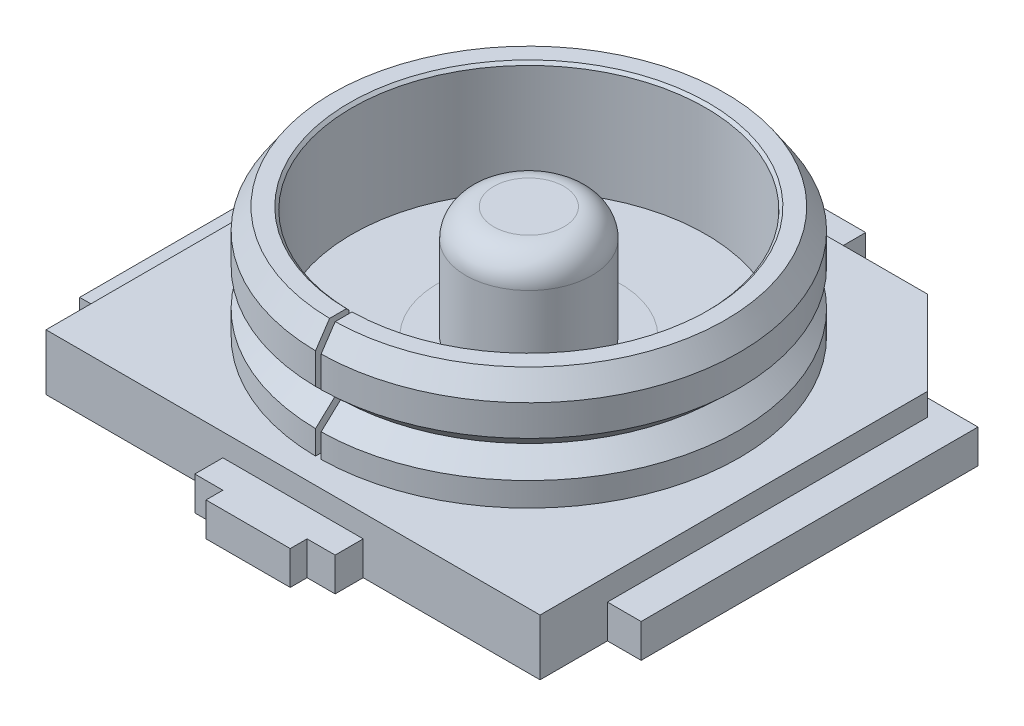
ISO-10303-21;
HEADER;
FILE_DESCRIPTION(('STEP AP214'),'2;1');
FILE_NAME('part.step','',(''),(''),'','','');
FILE_SCHEMA(('AUTOMOTIVE_DESIGN { 1 0 10303 214 1 1 1 1 }'));
ENDSEC;
DATA;
#1=APPLICATION_CONTEXT('core data for automotive mechanical design processes');
#2=APPLICATION_PROTOCOL_DEFINITION('international standard','automotive_design',2000,#1);
#3=PRODUCT_CONTEXT('',#1,'mechanical');
#4=PRODUCT('Part','Part','',(#3));
#5=PRODUCT_RELATED_PRODUCT_CATEGORY('part','',(#4));
#6=PRODUCT_DEFINITION_FORMATION('','',#4);
#7=PRODUCT_DEFINITION_CONTEXT('part definition',#1,'design');
#8=PRODUCT_DEFINITION('design','',#6,#7);
#9=PRODUCT_DEFINITION_SHAPE('','',#8);
#10=(LENGTH_UNIT() NAMED_UNIT(*) SI_UNIT(.MILLI.,.METRE.));
#11=(NAMED_UNIT(*) PLANE_ANGLE_UNIT() SI_UNIT($,.RADIAN.));
#12=(NAMED_UNIT(*) SI_UNIT($,.STERADIAN.) SOLID_ANGLE_UNIT());
#13=UNCERTAINTY_MEASURE_WITH_UNIT(LENGTH_MEASURE(1.E-05),#10,'distance_accuracy_value','');
#14=(GEOMETRIC_REPRESENTATION_CONTEXT(3) GLOBAL_UNCERTAINTY_ASSIGNED_CONTEXT((#13)) GLOBAL_UNIT_ASSIGNED_CONTEXT((#10,
#11,#12)) REPRESENTATION_CONTEXT('',''));
#15=CARTESIAN_POINT('',(0.,0.,0.));
#16=DIRECTION('',(0.,0.,1.));
#17=DIRECTION('',(1.,0.,0.));
#18=AXIS2_PLACEMENT_3D('',#15,#16,#17);
#19=CARTESIAN_POINT('',(0.,0.12,0.));
#20=DIRECTION('',(0.,-1.,0.));
#21=DIRECTION('',(0.,0.,-1.));
#22=AXIS2_PLACEMENT_3D('',#19,#20,#21);
#23=PLANE('',#22);
#24=DIRECTION('',(1.,0.,0.));
#25=VECTOR('',#24,1.);
#26=CARTESIAN_POINT('',(0.2,0.12,-1.));
#27=LINE('',#26,#25);
#28=CARTESIAN_POINT('',(0.2,0.12,-1.));
#29=VERTEX_POINT('',#28);
#30=CARTESIAN_POINT('',(-0.2,0.12,-1.));
#31=VERTEX_POINT('',#30);
#32=EDGE_CURVE('P0_E59',#29,#31,#27,.F.);
#33=ORIENTED_EDGE('',*,*,#32,.T.);
#34=DIRECTION('',(0.,0.,-1.));
#35=VECTOR('',#34,1.);
#36=CARTESIAN_POINT('',(-0.2,0.12,-0.756135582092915));
#37=LINE('',#36,#35);
#38=CARTESIAN_POINT('',(-0.2,0.12,-0.756135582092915));
#39=VERTEX_POINT('',#38);
#40=EDGE_CURVE('P0_E54',#31,#39,#37,.F.);
#41=ORIENTED_EDGE('',*,*,#40,.T.);
#42=CARTESIAN_POINT('',(0.,0.12,0.07));
#43=DIRECTION('',(0.,-1.,0.));
#44=DIRECTION('',(0.,0.,-1.));
#45=AXIS2_PLACEMENT_3D('',#42,#43,#44);
#46=CIRCLE('',#45,0.85);
#47=CARTESIAN_POINT('',(0.2,0.12,-0.756135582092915));
#48=VERTEX_POINT('',#47);
#49=EDGE_CURVE('P0_E21',#39,#48,#46,.T.);
#50=ORIENTED_EDGE('',*,*,#49,.T.);
#51=DIRECTION('',(0.,0.,1.));
#52=VECTOR('',#51,1.);
#53=CARTESIAN_POINT('',(0.2,0.12,-0.756135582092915));
#54=LINE('',#53,#52);
#55=EDGE_CURVE('P0_E71',#48,#29,#54,.F.);
#56=ORIENTED_EDGE('',*,*,#55,.T.);
#57=EDGE_LOOP('',(#33,#41,#50,#56));
#58=FACE_BOUND('',#57,.T.);
#59=ADVANCED_FACE('P0_F18',(#58),#23,.F.);
#60=CARTESIAN_POINT('',(0.2,1.64069063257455,-0.756135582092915));
#61=DIRECTION('',(-1.,0.,0.));
#62=DIRECTION('',(0.,0.,1.));
#63=AXIS2_PLACEMENT_3D('',#60,#61,#62);
#64=PLANE('',#63);
#65=ORIENTED_EDGE('',*,*,#55,.F.);
#66=DIRECTION('',(0.,1.,0.));
#67=VECTOR('',#66,1.);
#68=CARTESIAN_POINT('',(0.2,1.64069063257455,-0.756135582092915));
#69=LINE('',#68,#67);
#70=CARTESIAN_POINT('',(0.2,0.,-0.756135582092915));
#71=VERTEX_POINT('',#70);
#72=EDGE_CURVE('P0_E78',#71,#48,#69,.T.);
#73=ORIENTED_EDGE('',*,*,#72,.F.);
#74=DIRECTION('',(0.,0.,1.));
#75=VECTOR('',#74,1.);
#76=CARTESIAN_POINT('',(0.2,0.,0.07));
#77=LINE('',#76,#75);
#78=CARTESIAN_POINT('',(0.2,0.,-1.));
#79=VERTEX_POINT('',#78);
#80=EDGE_CURVE('P0_E74',#71,#79,#77,.F.);
#81=ORIENTED_EDGE('',*,*,#80,.T.);
#82=DIRECTION('',(0.,1.,0.));
#83=VECTOR('',#82,1.);
#84=CARTESIAN_POINT('',(0.2,1.64069063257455,-1.));
#85=LINE('',#84,#83);
#86=EDGE_CURVE('P0_E64',#79,#29,#85,.T.);
#87=ORIENTED_EDGE('',*,*,#86,.T.);
#88=EDGE_LOOP('',(#65,#73,#81,#87));
#89=FACE_BOUND('',#88,.T.);
#90=ADVANCED_FACE('P0_F76',(#89),#64,.F.);
#91=CARTESIAN_POINT('',(0.2,1.64069063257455,-1.));
#92=DIRECTION('',(0.,0.,1.));
#93=DIRECTION('',(1.,0.,0.));
#94=AXIS2_PLACEMENT_3D('',#91,#92,#93);
#95=PLANE('',#94);
#96=ORIENTED_EDGE('',*,*,#32,.F.);
#97=ORIENTED_EDGE('',*,*,#86,.F.);
#98=DIRECTION('',(1.,0.,0.));
#99=VECTOR('',#98,1.);
#100=CARTESIAN_POINT('',(0.,0.,-1.));
#101=LINE('',#100,#99);
#102=CARTESIAN_POINT('',(-0.2,0.,-1.));
#103=VERTEX_POINT('',#102);
#104=EDGE_CURVE('P0_E27',#79,#103,#101,.F.);
#105=ORIENTED_EDGE('',*,*,#104,.T.);
#106=DIRECTION('',(0.,1.,0.));
#107=VECTOR('',#106,1.);
#108=CARTESIAN_POINT('',(-0.2,1.64069063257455,-1.));
#109=LINE('',#108,#107);
#110=EDGE_CURVE('P0_E88',#103,#31,#109,.T.);
#111=ORIENTED_EDGE('',*,*,#110,.T.);
#112=EDGE_LOOP('',(#96,#97,#105,#111));
#113=FACE_BOUND('',#112,.T.);
#114=ADVANCED_FACE('P0_F66',(#113),#95,.F.);
#115=CARTESIAN_POINT('',(-0.2,1.64069063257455,-0.756135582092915));
#116=DIRECTION('',(1.,0.,0.));
#117=DIRECTION('',(0.,0.,-1.));
#118=AXIS2_PLACEMENT_3D('',#115,#116,#117);
#119=PLANE('',#118);
#120=ORIENTED_EDGE('',*,*,#40,.F.);
#121=ORIENTED_EDGE('',*,*,#110,.F.);
#122=DIRECTION('',(0.,0.,1.));
#123=VECTOR('',#122,1.);
#124=CARTESIAN_POINT('',(-0.2,0.,0.07));
#125=LINE('',#124,#123);
#126=CARTESIAN_POINT('',(-0.2,0.,-0.756135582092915));
#127=VERTEX_POINT('',#126);
#128=EDGE_CURVE('P0_E11',#103,#127,#125,.T.);
#129=ORIENTED_EDGE('',*,*,#128,.T.);
#130=DIRECTION('',(0.,-1.,0.));
#131=VECTOR('',#130,1.);
#132=CARTESIAN_POINT('',(-0.2,1.64069063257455,-0.756135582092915));
#133=LINE('',#132,#131);
#134=EDGE_CURVE('P0_E85',#127,#39,#133,.F.);
#135=ORIENTED_EDGE('',*,*,#134,.T.);
#136=EDGE_LOOP('',(#120,#121,#129,#135));
#137=FACE_BOUND('',#136,.T.);
#138=ADVANCED_FACE('P0_F108',(#137),#119,.F.);
#139=CARTESIAN_POINT('',(0.,1.64069063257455,0.07));
#140=DIRECTION('',(0.,-1.,0.));
#141=DIRECTION('',(0.,0.,-1.));
#142=AXIS2_PLACEMENT_3D('',#139,#140,#141);
#143=CYLINDRICAL_SURFACE('',#142,0.85);
#144=ORIENTED_EDGE('',*,*,#49,.F.);
#145=ORIENTED_EDGE('',*,*,#134,.F.);
#146=CARTESIAN_POINT('',(0.,0.,0.07));
#147=DIRECTION('',(0.,-1.,0.));
#148=DIRECTION('',(0.,0.,-1.));
#149=AXIS2_PLACEMENT_3D('',#146,#147,#148);
#150=CIRCLE('',#149,0.85);
#151=EDGE_CURVE('P0_E36',#127,#71,#150,.T.);
#152=ORIENTED_EDGE('',*,*,#151,.T.);
#153=ORIENTED_EDGE('',*,*,#72,.T.);
#154=EDGE_LOOP('',(#144,#145,#152,#153));
#155=FACE_BOUND('',#154,.T.);
#156=ADVANCED_FACE('P0_F106',(#155),#143,.F.);
#157=CARTESIAN_POINT('',(0.,0.,0.07));
#158=DIRECTION('',(0.,1.,0.));
#159=DIRECTION('',(0.,0.,1.));
#160=AXIS2_PLACEMENT_3D('',#157,#158,#159);
#161=PLANE('',#160);
#162=ORIENTED_EDGE('',*,*,#128,.F.);
#163=ORIENTED_EDGE('',*,*,#104,.F.);
#164=ORIENTED_EDGE('',*,*,#80,.F.);
#165=ORIENTED_EDGE('',*,*,#151,.F.);
#166=EDGE_LOOP('',(#162,#163,#164,#165));
#167=FACE_BOUND('',#166,.T.);
#168=ADVANCED_FACE('P0_F73',(#167),#161,.F.);
#169=CLOSED_SHELL('',(#59,#90,#114,#138,#156,#168));
#170=MANIFOLD_SOLID_BREP('P0_B1',#169);
#171=CARTESIAN_POINT('',(0.,0.02,0.));
#172=DIRECTION('',(0.,1.,0.));
#173=DIRECTION('',(0.,0.,1.));
#174=AXIS2_PLACEMENT_3D('',#171,#172,#173);
#175=PLANE('',#174);
#176=CARTESIAN_POINT('',(0.,0.02,0.));
#177=DIRECTION('',(0.,1.,0.));
#178=DIRECTION('',(0.,0.,1.));
#179=AXIS2_PLACEMENT_3D('',#176,#177,#178);
#180=CIRCLE('',#179,0.09);
#181=CARTESIAN_POINT('',(0.,0.02,-0.09));
#182=VERTEX_POINT('',#181);
#183=CARTESIAN_POINT('',(0.,0.02,0.09));
#184=VERTEX_POINT('',#183);
#185=EDGE_CURVE('P1_E140',#182,#184,#180,.F.);
#186=ORIENTED_EDGE('',*,*,#185,.T.);
#187=CARTESIAN_POINT('',(0.,0.02,0.));
#188=DIRECTION('',(0.,1.,0.));
#189=DIRECTION('',(0.,0.,-1.));
#190=AXIS2_PLACEMENT_3D('',#187,#188,#189);
#191=CIRCLE('',#190,0.09);
#192=EDGE_CURVE('P1_E143',#184,#182,#191,.F.);
#193=ORIENTED_EDGE('',*,*,#192,.T.);
#194=EDGE_LOOP('',(#186,#193));
#195=FACE_BOUND('',#194,.T.);
#196=ADVANCED_FACE('P1_F17',(#195),#175,.F.);
#197=CARTESIAN_POINT('',(0.,0.01,0.));
#198=DIRECTION('',(0.,1.,0.));
#199=DIRECTION('',(0.,0.,1.));
#200=AXIS2_PLACEMENT_3D('',#197,#198,#199);
#201=TOROIDAL_SURFACE('',#200,0.09,0.01);
#202=CARTESIAN_POINT('',(0.,0.01,0.));
#203=DIRECTION('',(0.,-1.,0.));
#204=DIRECTION('',(0.,0.,-1.));
#205=AXIS2_PLACEMENT_3D('',#202,#203,#204);
#206=CIRCLE('',#205,0.1);
#207=CARTESIAN_POINT('',(0.,0.01,-0.1));
#208=VERTEX_POINT('',#207);
#209=EDGE_CURVE('P1_E149',#208,#208,#206,.F.);
#210=ORIENTED_EDGE('',*,*,#209,.F.);
#211=EDGE_LOOP('',(#210));
#212=FACE_BOUND('',#211,.T.);
#213=ORIENTED_EDGE('',*,*,#192,.F.);
#214=ORIENTED_EDGE('',*,*,#185,.F.);
#215=EDGE_LOOP('',(#213,#214));
#216=FACE_BOUND('',#215,.T.);
#217=ADVANCED_FACE('P1_F144',(#212,#216),#201,.F.);
#218=CARTESIAN_POINT('',(0.,0.01,0.));
#219=DIRECTION('',(0.,-1.,0.));
#220=DIRECTION('',(0.,0.,-1.));
#221=AXIS2_PLACEMENT_3D('',#218,#219,#220);
#222=TOROIDAL_SURFACE('',#221,0.11,0.01);
#223=ORIENTED_EDGE('',*,*,#209,.T.);
#224=EDGE_LOOP('',(#223));
#225=FACE_BOUND('',#224,.T.);
#226=CARTESIAN_POINT('',(0.,0.,0.));
#227=DIRECTION('',(0.,-1.,0.));
#228=DIRECTION('',(0.,0.,-1.));
#229=AXIS2_PLACEMENT_3D('',#226,#227,#228);
#230=CIRCLE('',#229,0.11);
#231=CARTESIAN_POINT('',(0.,0.,0.11));
#232=VERTEX_POINT('',#231);
#233=CARTESIAN_POINT('',(0.,0.,-0.11));
#234=VERTEX_POINT('',#233);
#235=EDGE_CURVE('P1_E203',#232,#234,#230,.F.);
#236=ORIENTED_EDGE('',*,*,#235,.F.);
#237=CARTESIAN_POINT('',(0.,0.,0.));
#238=DIRECTION('',(0.,-1.,0.));
#239=DIRECTION('',(0.,0.,1.));
#240=AXIS2_PLACEMENT_3D('',#237,#238,#239);
#241=CIRCLE('',#240,0.11);
#242=EDGE_CURVE('P1_E212',#234,#232,#241,.F.);
#243=ORIENTED_EDGE('',*,*,#242,.F.);
#244=EDGE_LOOP('',(#236,#243));
#245=FACE_BOUND('',#244,.T.);
#246=ADVANCED_FACE('P1_F182',(#225,#245),#222,.T.);
#247=CARTESIAN_POINT('',(0.,0.,0.));
#248=DIRECTION('',(0.,-1.,0.));
#249=DIRECTION('',(0.,0.,-1.));
#250=AXIS2_PLACEMENT_3D('',#247,#248,#249);
#251=PLANE('',#250);
#252=DIRECTION('',(0.707106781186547,0.,-0.707106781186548));
#253=VECTOR('',#252,1.);
#254=CARTESIAN_POINT('',(-0.25,0.,-0.35));
#255=LINE('',#254,#253);
#256=CARTESIAN_POINT('',(-0.3,0.,-0.3));
#257=VERTEX_POINT('',#256);
#258=CARTESIAN_POINT('',(-0.25,0.,-0.35));
#259=VERTEX_POINT('',#258);
#260=EDGE_CURVE('P1_E308',#257,#259,#255,.T.);
#261=ORIENTED_EDGE('',*,*,#260,.T.);
#262=DIRECTION('',(1.,0.,0.));
#263=VECTOR('',#262,1.);
#264=CARTESIAN_POINT('',(-0.25,0.,-0.35));
#265=LINE('',#264,#263);
#266=CARTESIAN_POINT('',(0.25,0.,-0.35));
#267=VERTEX_POINT('',#266);
#268=EDGE_CURVE('P1_E314',#259,#267,#265,.T.);
#269=ORIENTED_EDGE('',*,*,#268,.T.);
#270=DIRECTION('',(0.707106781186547,0.,0.707106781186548));
#271=VECTOR('',#270,1.);
#272=CARTESIAN_POINT('',(0.25,0.,-0.35));
#273=LINE('',#272,#271);
#274=CARTESIAN_POINT('',(0.3,0.,-0.3));
#275=VERTEX_POINT('',#274);
#276=EDGE_CURVE('P1_E216',#267,#275,#273,.T.);
#277=ORIENTED_EDGE('',*,*,#276,.T.);
#278=DIRECTION('',(1.,0.,0.));
#279=VECTOR('',#278,1.);
#280=CARTESIAN_POINT('',(0.3,0.,-0.3));
#281=LINE('',#280,#279);
#282=CARTESIAN_POINT('',(0.35,0.,-0.3));
#283=VERTEX_POINT('',#282);
#284=EDGE_CURVE('P1_E218',#275,#283,#281,.T.);
#285=ORIENTED_EDGE('',*,*,#284,.T.);
#286=DIRECTION('',(0.,0.,1.));
#287=VECTOR('',#286,1.);
#288=CARTESIAN_POINT('',(0.35,0.,-0.3));
#289=LINE('',#288,#287);
#290=CARTESIAN_POINT('',(0.35,0.,0.22));
#291=VERTEX_POINT('',#290);
#292=EDGE_CURVE('P1_E236',#283,#291,#289,.T.);
#293=ORIENTED_EDGE('',*,*,#292,.T.);
#294=DIRECTION('',(-0.707106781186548,0.,0.707106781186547));
#295=VECTOR('',#294,1.);
#296=CARTESIAN_POINT('',(0.35,0.,0.22));
#297=LINE('',#296,#295);
#298=CARTESIAN_POINT('',(0.25,0.,0.32));
#299=VERTEX_POINT('',#298);
#300=EDGE_CURVE('P1_E242',#291,#299,#297,.T.);
#301=ORIENTED_EDGE('',*,*,#300,.T.);
#302=DIRECTION('',(0.,0.,1.));
#303=VECTOR('',#302,1.);
#304=CARTESIAN_POINT('',(0.25,0.,0.32));
#305=LINE('',#304,#303);
#306=CARTESIAN_POINT('',(0.25,0.,0.94));
#307=VERTEX_POINT('',#306);
#308=EDGE_CURVE('P1_E248',#299,#307,#305,.T.);
#309=ORIENTED_EDGE('',*,*,#308,.T.);
#310=DIRECTION('',(-1.,0.,0.));
#311=VECTOR('',#310,1.);
#312=CARTESIAN_POINT('',(0.25,0.,0.94));
#313=LINE('',#312,#311);
#314=CARTESIAN_POINT('',(0.15,0.,0.94));
#315=VERTEX_POINT('',#314);
#316=EDGE_CURVE('P1_E254',#307,#315,#313,.T.);
#317=ORIENTED_EDGE('',*,*,#316,.T.);
#318=DIRECTION('',(0.,0.,1.));
#319=VECTOR('',#318,1.);
#320=CARTESIAN_POINT('',(0.15,0.,0.94));
#321=LINE('',#320,#319);
#322=CARTESIAN_POINT('',(0.15,0.,1.));
#323=VERTEX_POINT('',#322);
#324=EDGE_CURVE('P1_E260',#315,#323,#321,.T.);
#325=ORIENTED_EDGE('',*,*,#324,.T.);
#326=DIRECTION('',(-1.,0.,0.));
#327=VECTOR('',#326,1.);
#328=CARTESIAN_POINT('',(0.15,0.,1.));
#329=LINE('',#328,#327);
#330=CARTESIAN_POINT('',(-0.15,0.,1.));
#331=VERTEX_POINT('',#330);
#332=EDGE_CURVE('P1_E266',#323,#331,#329,.T.);
#333=ORIENTED_EDGE('',*,*,#332,.T.);
#334=DIRECTION('',(0.,0.,-1.));
#335=VECTOR('',#334,1.);
#336=CARTESIAN_POINT('',(-0.15,0.,0.94));
#337=LINE('',#336,#335);
#338=CARTESIAN_POINT('',(-0.15,0.,0.94));
#339=VERTEX_POINT('',#338);
#340=EDGE_CURVE('P1_E272',#331,#339,#337,.T.);
#341=ORIENTED_EDGE('',*,*,#340,.T.);
#342=DIRECTION('',(-1.,0.,0.));
#343=VECTOR('',#342,1.);
#344=CARTESIAN_POINT('',(-0.25,0.,0.94));
#345=LINE('',#344,#343);
#346=CARTESIAN_POINT('',(-0.25,0.,0.94));
#347=VERTEX_POINT('',#346);
#348=EDGE_CURVE('P1_E278',#339,#347,#345,.T.);
#349=ORIENTED_EDGE('',*,*,#348,.T.);
#350=DIRECTION('',(0.,0.,-1.));
#351=VECTOR('',#350,1.);
#352=CARTESIAN_POINT('',(-0.25,0.,0.32));
#353=LINE('',#352,#351);
#354=CARTESIAN_POINT('',(-0.25,0.,0.32));
#355=VERTEX_POINT('',#354);
#356=EDGE_CURVE('P1_E284',#347,#355,#353,.T.);
#357=ORIENTED_EDGE('',*,*,#356,.T.);
#358=DIRECTION('',(-0.707106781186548,0.,-0.707106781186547));
#359=VECTOR('',#358,1.);
#360=CARTESIAN_POINT('',(-0.35,0.,0.22));
#361=LINE('',#360,#359);
#362=CARTESIAN_POINT('',(-0.35,0.,0.22));
#363=VERTEX_POINT('',#362);
#364=EDGE_CURVE('P1_E290',#355,#363,#361,.T.);
#365=ORIENTED_EDGE('',*,*,#364,.T.);
#366=DIRECTION('',(0.,0.,-1.));
#367=VECTOR('',#366,1.);
#368=CARTESIAN_POINT('',(-0.35,0.,-0.3));
#369=LINE('',#368,#367);
#370=CARTESIAN_POINT('',(-0.35,0.,-0.3));
#371=VERTEX_POINT('',#370);
#372=EDGE_CURVE('P1_E296',#363,#371,#369,.T.);
#373=ORIENTED_EDGE('',*,*,#372,.T.);
#374=DIRECTION('',(1.,0.,0.));
#375=VECTOR('',#374,1.);
#376=CARTESIAN_POINT('',(-0.3,0.,-0.3));
#377=LINE('',#376,#375);
#378=EDGE_CURVE('P1_E302',#371,#257,#377,.T.);
#379=ORIENTED_EDGE('',*,*,#378,.T.);
#380=EDGE_LOOP('',(#261,#269,#277,#285,#293,#301,#309,#317,#325,#333,#341,#349,#357,#365,#373,#379));
#381=FACE_BOUND('',#380,.T.);
#382=ORIENTED_EDGE('',*,*,#242,.T.);
#383=ORIENTED_EDGE('',*,*,#235,.T.);
#384=EDGE_LOOP('',(#382,#383));
#385=FACE_BOUND('',#384,.T.);
#386=ADVANCED_FACE('P1_F189',(#381,#385),#251,.T.);
#387=CARTESIAN_POINT('',(0.25,1.64069063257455,-0.35));
#388=DIRECTION('',(-0.707106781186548,0.,0.707106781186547));
#389=DIRECTION('',(0.707106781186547,0.,0.707106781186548));
#390=AXIS2_PLACEMENT_3D('',#387,#388,#389);
#391=PLANE('',#390);
#392=DIRECTION('',(0.707106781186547,0.,0.707106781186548));
#393=VECTOR('',#392,1.);
#394=CARTESIAN_POINT('',(0.25,0.12,-0.35));
#395=LINE('',#394,#393);
#396=CARTESIAN_POINT('',(0.25,0.12,-0.35));
#397=VERTEX_POINT('',#396);
#398=CARTESIAN_POINT('',(0.3,0.12,-0.3));
#399=VERTEX_POINT('',#398);
#400=EDGE_CURVE('P1_E320',#397,#399,#395,.T.);
#401=ORIENTED_EDGE('',*,*,#400,.T.);
#402=DIRECTION('',(0.,1.,0.));
#403=VECTOR('',#402,1.);
#404=CARTESIAN_POINT('',(0.3,1.64069063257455,-0.3));
#405=LINE('',#404,#403);
#406=EDGE_CURVE('P1_E224',#399,#275,#405,.F.);
#407=ORIENTED_EDGE('',*,*,#406,.T.);
#408=ORIENTED_EDGE('',*,*,#276,.F.);
#409=DIRECTION('',(0.,1.,0.));
#410=VECTOR('',#409,1.);
#411=CARTESIAN_POINT('',(0.25,1.64069063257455,-0.35));
#412=LINE('',#411,#410);
#413=EDGE_CURVE('P1_E316',#267,#397,#412,.T.);
#414=ORIENTED_EDGE('',*,*,#413,.T.);
#415=EDGE_LOOP('',(#401,#407,#408,#414));
#416=FACE_BOUND('',#415,.T.);
#417=ADVANCED_FACE('P1_F408',(#416),#391,.F.);
#418=CARTESIAN_POINT('',(0.3,1.64069063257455,-0.3));
#419=DIRECTION('',(0.,0.,1.));
#420=DIRECTION('',(1.,0.,0.));
#421=AXIS2_PLACEMENT_3D('',#418,#419,#420);
#422=PLANE('',#421);
#423=DIRECTION('',(1.,0.,0.));
#424=VECTOR('',#423,1.);
#425=CARTESIAN_POINT('',(0.,0.12,-0.3));
#426=LINE('',#425,#424);
#427=CARTESIAN_POINT('',(0.35,0.12,-0.3));
#428=VERTEX_POINT('',#427);
#429=EDGE_CURVE('P1_E323',#399,#428,#426,.T.);
#430=ORIENTED_EDGE('',*,*,#429,.T.);
#431=DIRECTION('',(0.,1.,0.));
#432=VECTOR('',#431,1.);
#433=CARTESIAN_POINT('',(0.35,1.64069063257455,-0.3));
#434=LINE('',#433,#432);
#435=EDGE_CURVE('P1_E239',#428,#283,#434,.F.);
#436=ORIENTED_EDGE('',*,*,#435,.T.);
#437=ORIENTED_EDGE('',*,*,#284,.F.);
#438=ORIENTED_EDGE('',*,*,#406,.F.);
#439=EDGE_LOOP('',(#430,#436,#437,#438));
#440=FACE_BOUND('',#439,.T.);
#441=ADVANCED_FACE('P1_F406',(#440),#422,.F.);
#442=CARTESIAN_POINT('',(0.35,1.64069063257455,-0.3));
#443=DIRECTION('',(-1.,0.,0.));
#444=DIRECTION('',(0.,0.,1.));
#445=AXIS2_PLACEMENT_3D('',#442,#443,#444);
#446=PLANE('',#445);
#447=DIRECTION('',(0.,0.,-1.));
#448=VECTOR('',#447,1.);
#449=CARTESIAN_POINT('',(0.35,0.12,0.));
#450=LINE('',#449,#448);
#451=CARTESIAN_POINT('',(0.35,0.12,0.22));
#452=VERTEX_POINT('',#451);
#453=EDGE_CURVE('P1_E326',#428,#452,#450,.F.);
#454=ORIENTED_EDGE('',*,*,#453,.T.);
#455=DIRECTION('',(0.,1.,0.));
#456=VECTOR('',#455,1.);
#457=CARTESIAN_POINT('',(0.35,1.64069063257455,0.22));
#458=LINE('',#457,#456);
#459=EDGE_CURVE('P1_E245',#452,#291,#458,.F.);
#460=ORIENTED_EDGE('',*,*,#459,.T.);
#461=ORIENTED_EDGE('',*,*,#292,.F.);
#462=ORIENTED_EDGE('',*,*,#435,.F.);
#463=EDGE_LOOP('',(#454,#460,#461,#462));
#464=FACE_BOUND('',#463,.T.);
#465=ADVANCED_FACE('P1_F403',(#464),#446,.F.);
#466=CARTESIAN_POINT('',(0.35,1.64069063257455,0.22));
#467=DIRECTION('',(-0.707106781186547,0.,-0.707106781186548));
#468=DIRECTION('',(-0.707106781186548,0.,0.707106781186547));
#469=AXIS2_PLACEMENT_3D('',#466,#467,#468);
#470=PLANE('',#469);
#471=DIRECTION('',(-0.707106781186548,0.,0.707106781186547));
#472=VECTOR('',#471,1.);
#473=CARTESIAN_POINT('',(0.35,0.12,0.22));
#474=LINE('',#473,#472);
#475=CARTESIAN_POINT('',(0.25,0.12,0.32));
#476=VERTEX_POINT('',#475);
#477=EDGE_CURVE('P1_E329',#452,#476,#474,.T.);
#478=ORIENTED_EDGE('',*,*,#477,.T.);
#479=DIRECTION('',(0.,1.,0.));
#480=VECTOR('',#479,1.);
#481=CARTESIAN_POINT('',(0.25,1.64069063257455,0.32));
#482=LINE('',#481,#480);
#483=EDGE_CURVE('P1_E251',#476,#299,#482,.F.);
#484=ORIENTED_EDGE('',*,*,#483,.T.);
#485=ORIENTED_EDGE('',*,*,#300,.F.);
#486=ORIENTED_EDGE('',*,*,#459,.F.);
#487=EDGE_LOOP('',(#478,#484,#485,#486));
#488=FACE_BOUND('',#487,.T.);
#489=ADVANCED_FACE('P1_F401',(#488),#470,.F.);
#490=CARTESIAN_POINT('',(0.25,1.64069063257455,0.32));
#491=DIRECTION('',(-1.,0.,0.));
#492=DIRECTION('',(0.,0.,1.));
#493=AXIS2_PLACEMENT_3D('',#490,#491,#492);
#494=PLANE('',#493);
#495=DIRECTION('',(0.,0.,-1.));
#496=VECTOR('',#495,1.);
#497=CARTESIAN_POINT('',(0.25,0.12,0.));
#498=LINE('',#497,#496);
#499=CARTESIAN_POINT('',(0.25,0.12,0.94));
#500=VERTEX_POINT('',#499);
#501=EDGE_CURVE('P1_E332',#476,#500,#498,.F.);
#502=ORIENTED_EDGE('',*,*,#501,.T.);
#503=DIRECTION('',(0.,1.,0.));
#504=VECTOR('',#503,1.);
#505=CARTESIAN_POINT('',(0.25,1.64069063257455,0.94));
#506=LINE('',#505,#504);
#507=EDGE_CURVE('P1_E257',#500,#307,#506,.F.);
#508=ORIENTED_EDGE('',*,*,#507,.T.);
#509=ORIENTED_EDGE('',*,*,#308,.F.);
#510=ORIENTED_EDGE('',*,*,#483,.F.);
#511=EDGE_LOOP('',(#502,#508,#509,#510));
#512=FACE_BOUND('',#511,.T.);
#513=ADVANCED_FACE('P1_F397',(#512),#494,.F.);
#514=CARTESIAN_POINT('',(0.25,1.64069063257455,0.94));
#515=DIRECTION('',(0.,0.,-1.));
#516=DIRECTION('',(-1.,0.,0.));
#517=AXIS2_PLACEMENT_3D('',#514,#515,#516);
#518=PLANE('',#517);
#519=DIRECTION('',(1.,0.,0.));
#520=VECTOR('',#519,1.);
#521=CARTESIAN_POINT('',(0.,0.12,0.94));
#522=LINE('',#521,#520);
#523=CARTESIAN_POINT('',(0.15,0.12,0.94));
#524=VERTEX_POINT('',#523);
#525=EDGE_CURVE('P1_E335',#500,#524,#522,.F.);
#526=ORIENTED_EDGE('',*,*,#525,.T.);
#527=DIRECTION('',(0.,1.,0.));
#528=VECTOR('',#527,1.);
#529=CARTESIAN_POINT('',(0.15,1.64069063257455,0.94));
#530=LINE('',#529,#528);
#531=EDGE_CURVE('P1_E263',#524,#315,#530,.F.);
#532=ORIENTED_EDGE('',*,*,#531,.T.);
#533=ORIENTED_EDGE('',*,*,#316,.F.);
#534=ORIENTED_EDGE('',*,*,#507,.F.);
#535=EDGE_LOOP('',(#526,#532,#533,#534));
#536=FACE_BOUND('',#535,.T.);
#537=ADVANCED_FACE('P1_F395',(#536),#518,.F.);
#538=CARTESIAN_POINT('',(0.15,1.64069063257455,0.94));
#539=DIRECTION('',(-1.,0.,0.));
#540=DIRECTION('',(0.,0.,1.));
#541=AXIS2_PLACEMENT_3D('',#538,#539,#540);
#542=PLANE('',#541);
#543=DIRECTION('',(0.,0.,-1.));
#544=VECTOR('',#543,1.);
#545=CARTESIAN_POINT('',(0.15,0.12,0.));
#546=LINE('',#545,#544);
#547=CARTESIAN_POINT('',(0.15,0.12,1.));
#548=VERTEX_POINT('',#547);
#549=EDGE_CURVE('P1_E338',#524,#548,#546,.F.);
#550=ORIENTED_EDGE('',*,*,#549,.T.);
#551=DIRECTION('',(0.,1.,0.));
#552=VECTOR('',#551,1.);
#553=CARTESIAN_POINT('',(0.15,1.64069063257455,1.));
#554=LINE('',#553,#552);
#555=EDGE_CURVE('P1_E269',#548,#323,#554,.F.);
#556=ORIENTED_EDGE('',*,*,#555,.T.);
#557=ORIENTED_EDGE('',*,*,#324,.F.);
#558=ORIENTED_EDGE('',*,*,#531,.F.);
#559=EDGE_LOOP('',(#550,#556,#557,#558));
#560=FACE_BOUND('',#559,.T.);
#561=ADVANCED_FACE('P1_F391',(#560),#542,.F.);
#562=CARTESIAN_POINT('',(0.15,1.64069063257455,1.));
#563=DIRECTION('',(0.,0.,-1.));
#564=DIRECTION('',(-1.,0.,0.));
#565=AXIS2_PLACEMENT_3D('',#562,#563,#564);
#566=PLANE('',#565);
#567=DIRECTION('',(1.,0.,0.));
#568=VECTOR('',#567,1.);
#569=CARTESIAN_POINT('',(0.,0.12,1.));
#570=LINE('',#569,#568);
#571=CARTESIAN_POINT('',(-0.15,0.12,1.));
#572=VERTEX_POINT('',#571);
#573=EDGE_CURVE('P1_E341',#548,#572,#570,.F.);
#574=ORIENTED_EDGE('',*,*,#573,.T.);
#575=DIRECTION('',(0.,1.,0.));
#576=VECTOR('',#575,1.);
#577=CARTESIAN_POINT('',(-0.15,1.64069063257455,1.));
#578=LINE('',#577,#576);
#579=EDGE_CURVE('P1_E275',#572,#331,#578,.F.);
#580=ORIENTED_EDGE('',*,*,#579,.T.);
#581=ORIENTED_EDGE('',*,*,#332,.F.);
#582=ORIENTED_EDGE('',*,*,#555,.F.);
#583=EDGE_LOOP('',(#574,#580,#581,#582));
#584=FACE_BOUND('',#583,.T.);
#585=ADVANCED_FACE('P1_F389',(#584),#566,.F.);
#586=CARTESIAN_POINT('',(-0.15,1.64069063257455,0.94));
#587=DIRECTION('',(1.,0.,0.));
#588=DIRECTION('',(0.,0.,-1.));
#589=AXIS2_PLACEMENT_3D('',#586,#587,#588);
#590=PLANE('',#589);
#591=DIRECTION('',(0.,0.,-1.));
#592=VECTOR('',#591,1.);
#593=CARTESIAN_POINT('',(-0.15,0.12,0.));
#594=LINE('',#593,#592);
#595=CARTESIAN_POINT('',(-0.15,0.12,0.94));
#596=VERTEX_POINT('',#595);
#597=EDGE_CURVE('P1_E344',#572,#596,#594,.T.);
#598=ORIENTED_EDGE('',*,*,#597,.T.);
#599=DIRECTION('',(0.,1.,0.));
#600=VECTOR('',#599,1.);
#601=CARTESIAN_POINT('',(-0.15,1.64069063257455,0.94));
#602=LINE('',#601,#600);
#603=EDGE_CURVE('P1_E281',#596,#339,#602,.F.);
#604=ORIENTED_EDGE('',*,*,#603,.T.);
#605=ORIENTED_EDGE('',*,*,#340,.F.);
#606=ORIENTED_EDGE('',*,*,#579,.F.);
#607=EDGE_LOOP('',(#598,#604,#605,#606));
#608=FACE_BOUND('',#607,.T.);
#609=ADVANCED_FACE('P1_F385',(#608),#590,.F.);
#610=CARTESIAN_POINT('',(-0.25,1.64069063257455,0.94));
#611=DIRECTION('',(0.,0.,-1.));
#612=DIRECTION('',(-1.,0.,0.));
#613=AXIS2_PLACEMENT_3D('',#610,#611,#612);
#614=PLANE('',#613);
#615=DIRECTION('',(1.,0.,0.));
#616=VECTOR('',#615,1.);
#617=CARTESIAN_POINT('',(0.,0.12,0.94));
#618=LINE('',#617,#616);
#619=CARTESIAN_POINT('',(-0.25,0.12,0.94));
#620=VERTEX_POINT('',#619);
#621=EDGE_CURVE('P1_E347',#596,#620,#618,.F.);
#622=ORIENTED_EDGE('',*,*,#621,.T.);
#623=DIRECTION('',(0.,1.,0.));
#624=VECTOR('',#623,1.);
#625=CARTESIAN_POINT('',(-0.25,1.64069063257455,0.94));
#626=LINE('',#625,#624);
#627=EDGE_CURVE('P1_E287',#620,#347,#626,.F.);
#628=ORIENTED_EDGE('',*,*,#627,.T.);
#629=ORIENTED_EDGE('',*,*,#348,.F.);
#630=ORIENTED_EDGE('',*,*,#603,.F.);
#631=EDGE_LOOP('',(#622,#628,#629,#630));
#632=FACE_BOUND('',#631,.T.);
#633=ADVANCED_FACE('P1_F383',(#632),#614,.F.);
#634=CARTESIAN_POINT('',(-0.25,1.64069063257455,0.32));
#635=DIRECTION('',(1.,0.,0.));
#636=DIRECTION('',(0.,0.,-1.));
#637=AXIS2_PLACEMENT_3D('',#634,#635,#636);
#638=PLANE('',#637);
#639=DIRECTION('',(0.,0.,-1.));
#640=VECTOR('',#639,1.);
#641=CARTESIAN_POINT('',(-0.25,0.12,0.));
#642=LINE('',#641,#640);
#643=CARTESIAN_POINT('',(-0.25,0.12,0.32));
#644=VERTEX_POINT('',#643);
#645=EDGE_CURVE('P1_E350',#620,#644,#642,.T.);
#646=ORIENTED_EDGE('',*,*,#645,.T.);
#647=DIRECTION('',(0.,1.,0.));
#648=VECTOR('',#647,1.);
#649=CARTESIAN_POINT('',(-0.25,1.64069063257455,0.32));
#650=LINE('',#649,#648);
#651=EDGE_CURVE('P1_E293',#644,#355,#650,.F.);
#652=ORIENTED_EDGE('',*,*,#651,.T.);
#653=ORIENTED_EDGE('',*,*,#356,.F.);
#654=ORIENTED_EDGE('',*,*,#627,.F.);
#655=EDGE_LOOP('',(#646,#652,#653,#654));
#656=FACE_BOUND('',#655,.T.);
#657=ADVANCED_FACE('P1_F379',(#656),#638,.F.);
#658=CARTESIAN_POINT('',(-0.35,1.64069063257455,0.22));
#659=DIRECTION('',(0.707106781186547,0.,-0.707106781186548));
#660=DIRECTION('',(-0.707106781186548,0.,-0.707106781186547));
#661=AXIS2_PLACEMENT_3D('',#658,#659,#660);
#662=PLANE('',#661);
#663=DIRECTION('',(-0.707106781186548,0.,-0.707106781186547));
#664=VECTOR('',#663,1.);
#665=CARTESIAN_POINT('',(-0.25,0.12,0.32));
#666=LINE('',#665,#664);
#667=CARTESIAN_POINT('',(-0.35,0.12,0.22));
#668=VERTEX_POINT('',#667);
#669=EDGE_CURVE('P1_E353',#644,#668,#666,.T.);
#670=ORIENTED_EDGE('',*,*,#669,.T.);
#671=DIRECTION('',(0.,1.,0.));
#672=VECTOR('',#671,1.);
#673=CARTESIAN_POINT('',(-0.35,1.64069063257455,0.22));
#674=LINE('',#673,#672);
#675=EDGE_CURVE('P1_E299',#668,#363,#674,.F.);
#676=ORIENTED_EDGE('',*,*,#675,.T.);
#677=ORIENTED_EDGE('',*,*,#364,.F.);
#678=ORIENTED_EDGE('',*,*,#651,.F.);
#679=EDGE_LOOP('',(#670,#676,#677,#678));
#680=FACE_BOUND('',#679,.T.);
#681=ADVANCED_FACE('P1_F377',(#680),#662,.F.);
#682=CARTESIAN_POINT('',(-0.35,1.64069063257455,-0.3));
#683=DIRECTION('',(1.,0.,0.));
#684=DIRECTION('',(0.,0.,-1.));
#685=AXIS2_PLACEMENT_3D('',#682,#683,#684);
#686=PLANE('',#685);
#687=DIRECTION('',(0.,0.,-1.));
#688=VECTOR('',#687,1.);
#689=CARTESIAN_POINT('',(-0.35,0.12,0.));
#690=LINE('',#689,#688);
#691=CARTESIAN_POINT('',(-0.35,0.12,-0.3));
#692=VERTEX_POINT('',#691);
#693=EDGE_CURVE('P1_E356',#668,#692,#690,.T.);
#694=ORIENTED_EDGE('',*,*,#693,.T.);
#695=DIRECTION('',(0.,1.,0.));
#696=VECTOR('',#695,1.);
#697=CARTESIAN_POINT('',(-0.35,1.64069063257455,-0.3));
#698=LINE('',#697,#696);
#699=EDGE_CURVE('P1_E305',#692,#371,#698,.F.);
#700=ORIENTED_EDGE('',*,*,#699,.T.);
#701=ORIENTED_EDGE('',*,*,#372,.F.);
#702=ORIENTED_EDGE('',*,*,#675,.F.);
#703=EDGE_LOOP('',(#694,#700,#701,#702));
#704=FACE_BOUND('',#703,.T.);
#705=ADVANCED_FACE('P1_F373',(#704),#686,.F.);
#706=CARTESIAN_POINT('',(-0.3,1.64069063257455,-0.3));
#707=DIRECTION('',(0.,0.,1.));
#708=DIRECTION('',(1.,0.,0.));
#709=AXIS2_PLACEMENT_3D('',#706,#707,#708);
#710=PLANE('',#709);
#711=DIRECTION('',(1.,0.,0.));
#712=VECTOR('',#711,1.);
#713=CARTESIAN_POINT('',(0.,0.12,-0.3));
#714=LINE('',#713,#712);
#715=CARTESIAN_POINT('',(-0.3,0.12,-0.3));
#716=VERTEX_POINT('',#715);
#717=EDGE_CURVE('P1_E359',#692,#716,#714,.T.);
#718=ORIENTED_EDGE('',*,*,#717,.T.);
#719=DIRECTION('',(0.,1.,0.));
#720=VECTOR('',#719,1.);
#721=CARTESIAN_POINT('',(-0.3,1.64069063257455,-0.3));
#722=LINE('',#721,#720);
#723=EDGE_CURVE('P1_E311',#716,#257,#722,.F.);
#724=ORIENTED_EDGE('',*,*,#723,.T.);
#725=ORIENTED_EDGE('',*,*,#378,.F.);
#726=ORIENTED_EDGE('',*,*,#699,.F.);
#727=EDGE_LOOP('',(#718,#724,#725,#726));
#728=FACE_BOUND('',#727,.T.);
#729=ADVANCED_FACE('P1_F371',(#728),#710,.F.);
#730=CARTESIAN_POINT('',(-0.25,1.64069063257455,-0.35));
#731=DIRECTION('',(0.707106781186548,0.,0.707106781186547));
#732=DIRECTION('',(0.707106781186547,0.,-0.707106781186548));
#733=AXIS2_PLACEMENT_3D('',#730,#731,#732);
#734=PLANE('',#733);
#735=DIRECTION('',(0.707106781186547,0.,-0.707106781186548));
#736=VECTOR('',#735,1.);
#737=CARTESIAN_POINT('',(-0.3,0.12,-0.3));
#738=LINE('',#737,#736);
#739=CARTESIAN_POINT('',(-0.25,0.12,-0.35));
#740=VERTEX_POINT('',#739);
#741=EDGE_CURVE('P1_E28',#716,#740,#738,.T.);
#742=ORIENTED_EDGE('',*,*,#741,.T.);
#743=DIRECTION('',(0.,1.,0.));
#744=VECTOR('',#743,1.);
#745=CARTESIAN_POINT('',(-0.25,1.64069063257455,-0.35));
#746=LINE('',#745,#744);
#747=EDGE_CURVE('P1_E36',#740,#259,#746,.F.);
#748=ORIENTED_EDGE('',*,*,#747,.T.);
#749=ORIENTED_EDGE('',*,*,#260,.F.);
#750=ORIENTED_EDGE('',*,*,#723,.F.);
#751=EDGE_LOOP('',(#742,#748,#749,#750));
#752=FACE_BOUND('',#751,.T.);
#753=ADVANCED_FACE('P1_F365',(#752),#734,.F.);
#754=CARTESIAN_POINT('',(-0.25,1.64069063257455,-0.35));
#755=DIRECTION('',(0.,0.,1.));
#756=DIRECTION('',(1.,0.,0.));
#757=AXIS2_PLACEMENT_3D('',#754,#755,#756);
#758=PLANE('',#757);
#759=DIRECTION('',(1.,0.,0.));
#760=VECTOR('',#759,1.);
#761=CARTESIAN_POINT('',(0.,0.12,-0.35));
#762=LINE('',#761,#760);
#763=EDGE_CURVE('P1_E11',#740,#397,#762,.T.);
#764=ORIENTED_EDGE('',*,*,#763,.T.);
#765=ORIENTED_EDGE('',*,*,#413,.F.);
#766=ORIENTED_EDGE('',*,*,#268,.F.);
#767=ORIENTED_EDGE('',*,*,#747,.F.);
#768=EDGE_LOOP('',(#764,#765,#766,#767));
#769=FACE_BOUND('',#768,.T.);
#770=ADVANCED_FACE('P1_F410',(#769),#758,.F.);
#771=CARTESIAN_POINT('',(0.,0.12,0.));
#772=DIRECTION('',(0.,-1.,0.));
#773=DIRECTION('',(0.,0.,-1.));
#774=AXIS2_PLACEMENT_3D('',#771,#772,#773);
#775=PLANE('',#774);
#776=ORIENTED_EDGE('',*,*,#741,.F.);
#777=ORIENTED_EDGE('',*,*,#717,.F.);
#778=ORIENTED_EDGE('',*,*,#693,.F.);
#779=ORIENTED_EDGE('',*,*,#669,.F.);
#780=ORIENTED_EDGE('',*,*,#645,.F.);
#781=ORIENTED_EDGE('',*,*,#621,.F.);
#782=ORIENTED_EDGE('',*,*,#597,.F.);
#783=ORIENTED_EDGE('',*,*,#573,.F.);
#784=ORIENTED_EDGE('',*,*,#549,.F.);
#785=ORIENTED_EDGE('',*,*,#525,.F.);
#786=ORIENTED_EDGE('',*,*,#501,.F.);
#787=ORIENTED_EDGE('',*,*,#477,.F.);
#788=ORIENTED_EDGE('',*,*,#453,.F.);
#789=ORIENTED_EDGE('',*,*,#429,.F.);
#790=ORIENTED_EDGE('',*,*,#400,.F.);
#791=ORIENTED_EDGE('',*,*,#763,.F.);
#792=EDGE_LOOP('',(#776,#777,#778,#779,#780,#781,#782,#783,#784,#785,#786,#787,#788,#789,#790,#791));
#793=FACE_BOUND('',#792,.T.);
#794=ADVANCED_FACE('P1_F368',(#793),#775,.F.);
#795=CLOSED_SHELL('',(#196,#217,#246,#386,#417,#441,#465,#489,#513,#537,#561,#585,#609,#633,
#657,#681,#705,#729,#753,#770,#794));
#796=MANIFOLD_SOLID_BREP('P1_B1',#795);
#797=CARTESIAN_POINT('',(0.,0.6,0.));
#798=DIRECTION('',(0.,1.,0.));
#799=DIRECTION('',(0.,0.,1.));
#800=AXIS2_PLACEMENT_3D('',#797,#798,#799);
#801=PLANE('',#800);
#802=CARTESIAN_POINT('',(0.,0.6,0.));
#803=DIRECTION('',(0.,-1.,0.));
#804=DIRECTION('',(0.,0.,-1.));
#805=AXIS2_PLACEMENT_3D('',#802,#803,#804);
#806=CIRCLE('',#805,0.125);
#807=CARTESIAN_POINT('',(0.,0.6,-0.125));
#808=VERTEX_POINT('',#807);
#809=CARTESIAN_POINT('',(0.,0.6,0.125));
#810=VERTEX_POINT('',#809);
#811=EDGE_CURVE('P2_E34',#808,#810,#806,.T.);
#812=ORIENTED_EDGE('',*,*,#811,.F.);
#813=CARTESIAN_POINT('',(0.,0.6,0.));
#814=DIRECTION('',(0.,-1.,0.));
#815=DIRECTION('',(0.,0.,1.));
#816=AXIS2_PLACEMENT_3D('',#813,#814,#815);
#817=CIRCLE('',#816,0.125);
#818=EDGE_CURVE('P2_E38',#810,#808,#817,.T.);
#819=ORIENTED_EDGE('',*,*,#818,.F.);
#820=EDGE_LOOP('',(#812,#819));
#821=FACE_BOUND('',#820,.T.);
#822=ADVANCED_FACE('P2_F17',(#821),#801,.T.);
#823=CARTESIAN_POINT('',(0.,0.5,0.));
#824=DIRECTION('',(0.,1.,0.));
#825=DIRECTION('',(0.,0.,1.));
#826=AXIS2_PLACEMENT_3D('',#823,#824,#825);
#827=TOROIDAL_SURFACE('',#826,0.125,0.1);
#828=CARTESIAN_POINT('',(0.,0.5,0.));
#829=DIRECTION('',(0.,1.,0.));
#830=DIRECTION('',(0.,0.,1.));
#831=AXIS2_PLACEMENT_3D('',#828,#829,#830);
#832=CIRCLE('',#831,0.225);
#833=CARTESIAN_POINT('',(0.,0.5,0.225));
#834=VERTEX_POINT('',#833);
#835=EDGE_CURVE('P2_E44',#834,#834,#832,.F.);
#836=ORIENTED_EDGE('',*,*,#835,.F.);
#837=EDGE_LOOP('',(#836));
#838=FACE_BOUND('',#837,.T.);
#839=ORIENTED_EDGE('',*,*,#818,.T.);
#840=ORIENTED_EDGE('',*,*,#811,.T.);
#841=EDGE_LOOP('',(#839,#840));
#842=FACE_BOUND('',#841,.T.);
#843=ADVANCED_FACE('P2_F43',(#838,#842),#827,.T.);
#844=CARTESIAN_POINT('',(0.,-1.5819090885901,0.));
#845=DIRECTION('',(0.,1.,0.));
#846=DIRECTION('',(0.,0.,1.));
#847=AXIS2_PLACEMENT_3D('',#844,#845,#846);
#848=CYLINDRICAL_SURFACE('',#847,0.225);
#849=CARTESIAN_POINT('',(0.,0.2,0.));
#850=DIRECTION('',(0.,1.,0.));
#851=DIRECTION('',(0.,0.,1.));
#852=AXIS2_PLACEMENT_3D('',#849,#850,#851);
#853=CIRCLE('',#852,0.225);
#854=CARTESIAN_POINT('',(0.,0.2,0.225));
#855=VERTEX_POINT('',#854);
#856=EDGE_CURVE('P2_E67',#855,#855,#853,.F.);
#857=ORIENTED_EDGE('',*,*,#856,.F.);
#858=EDGE_LOOP('',(#857));
#859=FACE_BOUND('',#858,.T.);
#860=ORIENTED_EDGE('',*,*,#835,.T.);
#861=EDGE_LOOP('',(#860));
#862=FACE_BOUND('',#861,.T.);
#863=ADVANCED_FACE('P2_F61',(#859,#862),#848,.T.);
#864=CARTESIAN_POINT('',(0.,0.2,0.));
#865=DIRECTION('',(0.,1.,0.));
#866=DIRECTION('',(0.,0.,1.));
#867=AXIS2_PLACEMENT_3D('',#864,#865,#866);
#868=PLANE('',#867);
#869=CARTESIAN_POINT('',(0.,0.2,0.));
#870=DIRECTION('',(0.,1.,0.));
#871=DIRECTION('',(0.,0.,1.));
#872=AXIS2_PLACEMENT_3D('',#869,#870,#871);
#873=CIRCLE('',#872,0.325);
#874=CARTESIAN_POINT('',(0.,0.2,0.325));
#875=VERTEX_POINT('',#874);
#876=EDGE_CURVE('P2_E28',#875,#875,#873,.F.);
#877=ORIENTED_EDGE('',*,*,#876,.F.);
#878=EDGE_LOOP('',(#877));
#879=FACE_BOUND('',#878,.T.);
#880=ORIENTED_EDGE('',*,*,#856,.T.);
#881=EDGE_LOOP('',(#880));
#882=FACE_BOUND('',#881,.T.);
#883=ADVANCED_FACE('P2_F79',(#879,#882),#868,.T.);
#884=CARTESIAN_POINT('',(0.,-0.799238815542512,0.));
#885=DIRECTION('',(0.,1.,0.));
#886=DIRECTION('',(0.,0.,1.));
#887=AXIS2_PLACEMENT_3D('',#884,#885,#886);
#888=CYLINDRICAL_SURFACE('',#887,0.325);
#889=CARTESIAN_POINT('',(0.,0.12,0.));
#890=DIRECTION('',(0.,1.,0.));
#891=DIRECTION('',(0.,0.,1.));
#892=AXIS2_PLACEMENT_3D('',#889,#890,#891);
#893=CIRCLE('',#892,0.325);
#894=CARTESIAN_POINT('',(0.,0.12,0.325));
#895=VERTEX_POINT('',#894);
#896=EDGE_CURVE('P2_E11',#895,#895,#893,.F.);
#897=ORIENTED_EDGE('',*,*,#896,.F.);
#898=EDGE_LOOP('',(#897));
#899=FACE_BOUND('',#898,.T.);
#900=ORIENTED_EDGE('',*,*,#876,.T.);
#901=EDGE_LOOP('',(#900));
#902=FACE_BOUND('',#901,.T.);
#903=ADVANCED_FACE('P2_F77',(#899,#902),#888,.T.);
#904=CARTESIAN_POINT('',(0.,0.12,0.));
#905=DIRECTION('',(0.,-1.,0.));
#906=DIRECTION('',(0.,0.,-1.));
#907=AXIS2_PLACEMENT_3D('',#904,#905,#906);
#908=PLANE('',#907);
#909=ORIENTED_EDGE('',*,*,#896,.T.);
#910=EDGE_LOOP('',(#909));
#911=FACE_BOUND('',#910,.T.);
#912=ADVANCED_FACE('P2_F86',(#911),#908,.T.);
#913=CLOSED_SHELL('',(#822,#843,#863,#883,#903,#912));
#914=MANIFOLD_SOLID_BREP('P2_B1',#913);
#915=CARTESIAN_POINT('',(0.76,0.12,-0.6));
#916=DIRECTION('',(1.,0.,0.));
#917=DIRECTION('',(0.,0.,-1.));
#918=AXIS2_PLACEMENT_3D('',#915,#916,#917);
#919=PLANE('',#918);
#920=DIRECTION('',(0.,0.,1.));
#921=VECTOR('',#920,1.);
#922=CARTESIAN_POINT('',(0.76,0.12,-0.235));
#923=LINE('',#922,#921);
#924=CARTESIAN_POINT('',(0.76,0.12,-0.6));
#925=VERTEX_POINT('',#924);
#926=CARTESIAN_POINT('',(0.76,0.12,-0.2975));
#927=VERTEX_POINT('',#926);
#928=EDGE_CURVE('P3_E381',#925,#927,#923,.T.);
#929=ORIENTED_EDGE('',*,*,#928,.T.);
#930=DIRECTION('',(0.,-1.,0.));
#931=VECTOR('',#930,1.);
#932=CARTESIAN_POINT('',(0.76,0.12,-0.2975));
#933=LINE('',#932,#931);
#934=CARTESIAN_POINT('',(0.76,0.,-0.2975));
#935=VERTEX_POINT('',#934);
#936=EDGE_CURVE('P3_E394',#935,#927,#933,.F.);
#937=ORIENTED_EDGE('',*,*,#936,.F.);
#938=DIRECTION('',(0.,0.,-1.));
#939=VECTOR('',#938,1.);
#940=CARTESIAN_POINT('',(0.76,0.,0.));
#941=LINE('',#940,#939);
#942=CARTESIAN_POINT('',(0.76,0.,-0.6));
#943=VERTEX_POINT('',#942);
#944=EDGE_CURVE('P3_E399',#943,#935,#941,.F.);
#945=ORIENTED_EDGE('',*,*,#944,.F.);
#946=DIRECTION('',(0.,1.,0.));
#947=VECTOR('',#946,1.);
#948=CARTESIAN_POINT('',(0.76,0.12,-0.6));
#949=LINE('',#948,#947);
#950=EDGE_CURVE('P3_E382',#925,#943,#949,.F.);
#951=ORIENTED_EDGE('',*,*,#950,.F.);
#952=EDGE_LOOP('',(#929,#937,#945,#951));
#953=FACE_BOUND('',#952,.T.);
#954=ADVANCED_FACE('P3_F17',(#953),#919,.T.);
#955=CARTESIAN_POINT('',(0.76,0.12,-0.235));
#956=DIRECTION('',(0.,-1.,0.));
#957=DIRECTION('',(0.,0.,-1.));
#958=AXIS2_PLACEMENT_3D('',#955,#956,#957);
#959=CYLINDRICAL_SURFACE('',#958,0.0625);
#960=CARTESIAN_POINT('',(0.76,0.12,-0.235));
#961=DIRECTION('',(0.,-1.,0.));
#962=DIRECTION('',(0.,0.,-1.));
#963=AXIS2_PLACEMENT_3D('',#960,#961,#962);
#964=CIRCLE('',#963,0.0625);
#965=CARTESIAN_POINT('',(0.76,0.12,-0.1725));
#966=VERTEX_POINT('',#965);
#967=EDGE_CURVE('P3_E469',#927,#966,#964,.T.);
#968=ORIENTED_EDGE('',*,*,#967,.T.);
#969=DIRECTION('',(0.,-1.,0.));
#970=VECTOR('',#969,1.);
#971=CARTESIAN_POINT('',(0.76,0.12,-0.1725));
#972=LINE('',#971,#970);
#973=CARTESIAN_POINT('',(0.76,0.,-0.1725));
#974=VERTEX_POINT('',#973);
#975=EDGE_CURVE('P3_E392',#974,#966,#972,.F.);
#976=ORIENTED_EDGE('',*,*,#975,.F.);
#977=CARTESIAN_POINT('',(0.76,0.,-0.235));
#978=DIRECTION('',(0.,-1.,0.));
#979=DIRECTION('',(0.,0.,-1.));
#980=AXIS2_PLACEMENT_3D('',#977,#978,#979);
#981=CIRCLE('',#980,0.0625);
#982=EDGE_CURVE('P3_E461',#935,#974,#981,.T.);
#983=ORIENTED_EDGE('',*,*,#982,.F.);
#984=ORIENTED_EDGE('',*,*,#936,.T.);
#985=EDGE_LOOP('',(#968,#976,#983,#984));
#986=FACE_BOUND('',#985,.T.);
#987=ADVANCED_FACE('P3_F1055',(#986),#959,.T.);
#988=CARTESIAN_POINT('',(0.133307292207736,0.12,0.));
#989=DIRECTION('',(0.,-1.,0.));
#990=DIRECTION('',(0.,0.,-1.));
#991=AXIS2_PLACEMENT_3D('',#988,#989,#990);
#992=CYLINDRICAL_SURFACE('',#991,0.65);
#993=CARTESIAN_POINT('',(0.133307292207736,0.12,0.));
#994=DIRECTION('',(0.,-1.,0.));
#995=DIRECTION('',(0.,0.,-1.));
#996=AXIS2_PLACEMENT_3D('',#993,#994,#995);
#997=CIRCLE('',#996,0.65);
#998=CARTESIAN_POINT('',(0.76,0.12,0.1725));
#999=VERTEX_POINT('',#998);
#1000=EDGE_CURVE('P3_E466',#966,#999,#997,.T.);
#1001=ORIENTED_EDGE('',*,*,#1000,.T.);
#1002=DIRECTION('',(0.,-1.,0.));
#1003=VECTOR('',#1002,1.);
#1004=CARTESIAN_POINT('',(0.76,0.12,0.1725));
#1005=LINE('',#1004,#1003);
#1006=CARTESIAN_POINT('',(0.76,0.,0.1725));
#1007=VERTEX_POINT('',#1006);
#1008=EDGE_CURVE('P3_E378',#1007,#999,#1005,.F.);
#1009=ORIENTED_EDGE('',*,*,#1008,.F.);
#1010=CARTESIAN_POINT('',(0.133307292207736,0.,0.));
#1011=DIRECTION('',(0.,-1.,0.));
#1012=DIRECTION('',(0.,0.,-1.));
#1013=AXIS2_PLACEMENT_3D('',#1010,#1011,#1012);
#1014=CIRCLE('',#1013,0.65);
#1015=EDGE_CURVE('P3_E459',#974,#1007,#1014,.T.);
#1016=ORIENTED_EDGE('',*,*,#1015,.F.);
#1017=ORIENTED_EDGE('',*,*,#975,.T.);
#1018=EDGE_LOOP('',(#1001,#1009,#1016,#1017));
#1019=FACE_BOUND('',#1018,.T.);
#1020=ADVANCED_FACE('P3_F1046',(#1019),#992,.T.);
#1021=CARTESIAN_POINT('',(0.76,0.12,0.235));
#1022=DIRECTION('',(0.,-1.,0.));
#1023=DIRECTION('',(0.,0.,-1.));
#1024=AXIS2_PLACEMENT_3D('',#1021,#1022,#1023);
#1025=CYLINDRICAL_SURFACE('',#1024,0.0625000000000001);
#1026=CARTESIAN_POINT('',(0.76,0.12,0.235));
#1027=DIRECTION('',(0.,-1.,0.));
#1028=DIRECTION('',(0.,0.,-1.));
#1029=AXIS2_PLACEMENT_3D('',#1026,#1027,#1028);
#1030=CIRCLE('',#1029,0.0625000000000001);
#1031=CARTESIAN_POINT('',(0.76,0.12,0.2975));
#1032=VERTEX_POINT('',#1031);
#1033=EDGE_CURVE('P3_E463',#999,#1032,#1030,.T.);
#1034=ORIENTED_EDGE('',*,*,#1033,.T.);
#1035=DIRECTION('',(0.,1.,0.));
#1036=VECTOR('',#1035,1.);
#1037=CARTESIAN_POINT('',(0.76,0.12,0.2975));
#1038=LINE('',#1037,#1036);
#1039=CARTESIAN_POINT('',(0.76,0.,0.2975));
#1040=VERTEX_POINT('',#1039);
#1041=EDGE_CURVE('P3_E354',#1040,#1032,#1038,.T.);
#1042=ORIENTED_EDGE('',*,*,#1041,.F.);
#1043=CARTESIAN_POINT('',(0.76,0.,0.235));
#1044=DIRECTION('',(0.,-1.,0.));
#1045=DIRECTION('',(0.,0.,-1.));
#1046=AXIS2_PLACEMENT_3D('',#1043,#1044,#1045);
#1047=CIRCLE('',#1046,0.0625000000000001);
#1048=EDGE_CURVE('P3_E457',#1007,#1040,#1047,.T.);
#1049=ORIENTED_EDGE('',*,*,#1048,.F.);
#1050=ORIENTED_EDGE('',*,*,#1008,.T.);
#1051=EDGE_LOOP('',(#1034,#1042,#1049,#1050));
#1052=FACE_BOUND('',#1051,.T.);
#1053=ADVANCED_FACE('P3_F1037',(#1052),#1025,.T.);
#1054=CARTESIAN_POINT('',(0.76,0.12,0.6));
#1055=DIRECTION('',(1.,0.,0.));
#1056=DIRECTION('',(0.,0.,-1.));
#1057=AXIS2_PLACEMENT_3D('',#1054,#1055,#1056);
#1058=PLANE('',#1057);
#1059=DIRECTION('',(0.,0.,1.));
#1060=VECTOR('',#1059,1.);
#1061=CARTESIAN_POINT('',(0.76,0.12,-0.235));
#1062=LINE('',#1061,#1060);
#1063=CARTESIAN_POINT('',(0.76,0.12,0.6));
#1064=VERTEX_POINT('',#1063);
#1065=EDGE_CURVE('P3_E420',#1032,#1064,#1062,.T.);
#1066=ORIENTED_EDGE('',*,*,#1065,.T.);
#1067=DIRECTION('',(0.,1.,0.));
#1068=VECTOR('',#1067,1.);
#1069=CARTESIAN_POINT('',(0.76,0.12,0.6));
#1070=LINE('',#1069,#1068);
#1071=CARTESIAN_POINT('',(0.76,0.,0.6));
#1072=VERTEX_POINT('',#1071);
#1073=EDGE_CURVE('P3_E379',#1072,#1064,#1070,.T.);
#1074=ORIENTED_EDGE('',*,*,#1073,.F.);
#1075=DIRECTION('',(0.,0.,-1.));
#1076=VECTOR('',#1075,1.);
#1077=CARTESIAN_POINT('',(0.76,0.,0.));
#1078=LINE('',#1077,#1076);
#1079=EDGE_CURVE('P3_E388',#1040,#1072,#1078,.F.);
#1080=ORIENTED_EDGE('',*,*,#1079,.F.);
#1081=ORIENTED_EDGE('',*,*,#1041,.T.);
#1082=EDGE_LOOP('',(#1066,#1074,#1080,#1081));
#1083=FACE_BOUND('',#1082,.T.);
#1084=ADVANCED_FACE('P3_F1029',(#1083),#1058,.T.);
#1085=CARTESIAN_POINT('',(-0.76,0.12,0.6));
#1086=DIRECTION('',(-1.,0.,0.));
#1087=DIRECTION('',(0.,0.,1.));
#1088=AXIS2_PLACEMENT_3D('',#1085,#1086,#1087);
#1089=PLANE('',#1088);
#1090=DIRECTION('',(0.,0.,1.));
#1091=VECTOR('',#1090,1.);
#1092=CARTESIAN_POINT('',(-0.76,0.12,0.235));
#1093=LINE('',#1092,#1091);
#1094=CARTESIAN_POINT('',(-0.76,0.12,0.6));
#1095=VERTEX_POINT('',#1094);
#1096=CARTESIAN_POINT('',(-0.76,0.12,0.2975));
#1097=VERTEX_POINT('',#1096);
#1098=EDGE_CURVE('P3_E279',#1095,#1097,#1093,.F.);
#1099=ORIENTED_EDGE('',*,*,#1098,.T.);
#1100=DIRECTION('',(0.,-1.,0.));
#1101=VECTOR('',#1100,1.);
#1102=CARTESIAN_POINT('',(-0.76,0.12,0.2975));
#1103=LINE('',#1102,#1101);
#1104=CARTESIAN_POINT('',(-0.76,0.,0.2975));
#1105=VERTEX_POINT('',#1104);
#1106=EDGE_CURVE('P3_E255',#1105,#1097,#1103,.F.);
#1107=ORIENTED_EDGE('',*,*,#1106,.F.);
#1108=DIRECTION('',(0.,0.,-1.));
#1109=VECTOR('',#1108,1.);
#1110=CARTESIAN_POINT('',(-0.76,0.,0.));
#1111=LINE('',#1110,#1109);
#1112=CARTESIAN_POINT('',(-0.76,0.,0.6));
#1113=VERTEX_POINT('',#1112);
#1114=EDGE_CURVE('P3_E358',#1113,#1105,#1111,.T.);
#1115=ORIENTED_EDGE('',*,*,#1114,.F.);
#1116=DIRECTION('',(0.,1.,0.));
#1117=VECTOR('',#1116,1.);
#1118=CARTESIAN_POINT('',(-0.76,0.12,0.6));
#1119=LINE('',#1118,#1117);
#1120=EDGE_CURVE('P3_E284',#1095,#1113,#1119,.F.);
#1121=ORIENTED_EDGE('',*,*,#1120,.F.);
#1122=EDGE_LOOP('',(#1099,#1107,#1115,#1121));
#1123=FACE_BOUND('',#1122,.T.);
#1124=ADVANCED_FACE('P3_F693',(#1123),#1089,.T.);
#1125=CARTESIAN_POINT('',(-0.76,0.12,0.235));
#1126=DIRECTION('',(0.,-1.,0.));
#1127=DIRECTION('',(0.,0.,-1.));
#1128=AXIS2_PLACEMENT_3D('',#1125,#1126,#1127);
#1129=CYLINDRICAL_SURFACE('',#1128,0.0625000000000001);
#1130=CARTESIAN_POINT('',(-0.76,0.12,0.235));
#1131=DIRECTION('',(0.,-1.,0.));
#1132=DIRECTION('',(0.,0.,-1.));
#1133=AXIS2_PLACEMENT_3D('',#1130,#1131,#1132);
#1134=CIRCLE('',#1133,0.0625000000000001);
#1135=CARTESIAN_POINT('',(-0.76,0.12,0.1725));
#1136=VERTEX_POINT('',#1135);
#1137=EDGE_CURVE('P3_E20',#1097,#1136,#1134,.T.);
#1138=ORIENTED_EDGE('',*,*,#1137,.T.);
#1139=DIRECTION('',(0.,-1.,0.));
#1140=VECTOR('',#1139,1.);
#1141=CARTESIAN_POINT('',(-0.76,0.12,0.1725));
#1142=LINE('',#1141,#1140);
#1143=CARTESIAN_POINT('',(-0.76,0.,0.1725));
#1144=VERTEX_POINT('',#1143);
#1145=EDGE_CURVE('P3_E262',#1144,#1136,#1142,.F.);
#1146=ORIENTED_EDGE('',*,*,#1145,.F.);
#1147=CARTESIAN_POINT('',(-0.76,0.,0.235));
#1148=DIRECTION('',(0.,-1.,0.));
#1149=DIRECTION('',(0.,0.,-1.));
#1150=AXIS2_PLACEMENT_3D('',#1147,#1148,#1149);
#1151=CIRCLE('',#1150,0.0625000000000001);
#1152=EDGE_CURVE('P3_E455',#1105,#1144,#1151,.T.);
#1153=ORIENTED_EDGE('',*,*,#1152,.F.);
#1154=ORIENTED_EDGE('',*,*,#1106,.T.);
#1155=EDGE_LOOP('',(#1138,#1146,#1153,#1154));
#1156=FACE_BOUND('',#1155,.T.);
#1157=ADVANCED_FACE('P3_F278',(#1156),#1129,.T.);
#1158=CARTESIAN_POINT('',(-0.133307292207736,0.12,0.));
#1159=DIRECTION('',(0.,-1.,0.));
#1160=DIRECTION('',(0.,0.,-1.));
#1161=AXIS2_PLACEMENT_3D('',#1158,#1159,#1160);
#1162=CYLINDRICAL_SURFACE('',#1161,0.65);
#1163=CARTESIAN_POINT('',(-0.133307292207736,0.12,0.));
#1164=DIRECTION('',(0.,-1.,0.));
#1165=DIRECTION('',(0.,0.,-1.));
#1166=AXIS2_PLACEMENT_3D('',#1163,#1164,#1165);
#1167=CIRCLE('',#1166,0.65);
#1168=CARTESIAN_POINT('',(-0.76,0.12,-0.1725));
#1169=VERTEX_POINT('',#1168);
#1170=EDGE_CURVE('P3_E266',#1136,#1169,#1167,.T.);
#1171=ORIENTED_EDGE('',*,*,#1170,.T.);
#1172=DIRECTION('',(0.,-1.,0.));
#1173=VECTOR('',#1172,1.);
#1174=CARTESIAN_POINT('',(-0.76,0.12,-0.1725));
#1175=LINE('',#1174,#1173);
#1176=CARTESIAN_POINT('',(-0.76,0.,-0.1725));
#1177=VERTEX_POINT('',#1176);
#1178=EDGE_CURVE('P3_E268',#1177,#1169,#1175,.F.);
#1179=ORIENTED_EDGE('',*,*,#1178,.F.);
#1180=CARTESIAN_POINT('',(-0.133307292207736,0.,0.));
#1181=DIRECTION('',(0.,-1.,0.));
#1182=DIRECTION('',(0.,0.,-1.));
#1183=AXIS2_PLACEMENT_3D('',#1180,#1181,#1182);
#1184=CIRCLE('',#1183,0.65);
#1185=EDGE_CURVE('P3_E267',#1144,#1177,#1184,.T.);
#1186=ORIENTED_EDGE('',*,*,#1185,.F.);
#1187=ORIENTED_EDGE('',*,*,#1145,.T.);
#1188=EDGE_LOOP('',(#1171,#1179,#1186,#1187));
#1189=FACE_BOUND('',#1188,.T.);
#1190=ADVANCED_FACE('P3_F264',(#1189),#1162,.T.);
#1191=CARTESIAN_POINT('',(-0.76,0.12,-0.235));
#1192=DIRECTION('',(0.,-1.,0.));
#1193=DIRECTION('',(0.,0.,-1.));
#1194=AXIS2_PLACEMENT_3D('',#1191,#1192,#1193);
#1195=CYLINDRICAL_SURFACE('',#1194,0.0625);
#1196=CARTESIAN_POINT('',(-0.76,0.12,-0.235));
#1197=DIRECTION('',(0.,-1.,0.));
#1198=DIRECTION('',(0.,0.,-1.));
#1199=AXIS2_PLACEMENT_3D('',#1196,#1197,#1198);
#1200=CIRCLE('',#1199,0.0625);
#1201=CARTESIAN_POINT('',(-0.76,0.12,-0.2975));
#1202=VERTEX_POINT('',#1201);
#1203=EDGE_CURVE('P3_E277',#1169,#1202,#1200,.T.);
#1204=ORIENTED_EDGE('',*,*,#1203,.T.);
#1205=DIRECTION('',(0.,1.,0.));
#1206=VECTOR('',#1205,1.);
#1207=CARTESIAN_POINT('',(-0.76,0.12,-0.2975));
#1208=LINE('',#1207,#1206);
#1209=CARTESIAN_POINT('',(-0.76,0.,-0.2975));
#1210=VERTEX_POINT('',#1209);
#1211=EDGE_CURVE('P3_E308',#1210,#1202,#1208,.T.);
#1212=ORIENTED_EDGE('',*,*,#1211,.F.);
#1213=CARTESIAN_POINT('',(-0.76,0.,-0.235));
#1214=DIRECTION('',(0.,-1.,0.));
#1215=DIRECTION('',(0.,0.,-1.));
#1216=AXIS2_PLACEMENT_3D('',#1213,#1214,#1215);
#1217=CIRCLE('',#1216,0.0625);
#1218=EDGE_CURVE('P3_E452',#1177,#1210,#1217,.T.);
#1219=ORIENTED_EDGE('',*,*,#1218,.F.);
#1220=ORIENTED_EDGE('',*,*,#1178,.T.);
#1221=EDGE_LOOP('',(#1204,#1212,#1219,#1220));
#1222=FACE_BOUND('',#1221,.T.);
#1223=ADVANCED_FACE('P3_F695',(#1222),#1195,.T.);
#1224=CARTESIAN_POINT('',(-0.76,0.12,-0.6));
#1225=DIRECTION('',(-1.,0.,0.));
#1226=DIRECTION('',(0.,0.,1.));
#1227=AXIS2_PLACEMENT_3D('',#1224,#1225,#1226);
#1228=PLANE('',#1227);
#1229=DIRECTION('',(0.,0.,1.));
#1230=VECTOR('',#1229,1.);
#1231=CARTESIAN_POINT('',(-0.76,0.12,0.235));
#1232=LINE('',#1231,#1230);
#1233=CARTESIAN_POINT('',(-0.76,0.12,-0.6));
#1234=VERTEX_POINT('',#1233);
#1235=EDGE_CURVE('P3_E343',#1202,#1234,#1232,.F.);
#1236=ORIENTED_EDGE('',*,*,#1235,.T.);
#1237=DIRECTION('',(0.,1.,0.));
#1238=VECTOR('',#1237,1.);
#1239=CARTESIAN_POINT('',(-0.76,0.12,-0.6));
#1240=LINE('',#1239,#1238);
#1241=CARTESIAN_POINT('',(-0.76,0.,-0.6));
#1242=VERTEX_POINT('',#1241);
#1243=EDGE_CURVE('P3_E341',#1242,#1234,#1240,.T.);
#1244=ORIENTED_EDGE('',*,*,#1243,.F.);
#1245=DIRECTION('',(0.,0.,-1.));
#1246=VECTOR('',#1245,1.);
#1247=CARTESIAN_POINT('',(-0.76,0.,0.));
#1248=LINE('',#1247,#1246);
#1249=EDGE_CURVE('P3_E349',#1210,#1242,#1248,.T.);
#1250=ORIENTED_EDGE('',*,*,#1249,.F.);
#1251=ORIENTED_EDGE('',*,*,#1211,.T.);
#1252=EDGE_LOOP('',(#1236,#1244,#1250,#1251));
#1253=FACE_BOUND('',#1252,.T.);
#1254=ADVANCED_FACE('P3_F696',(#1253),#1228,.T.);
#1255=CARTESIAN_POINT('',(0.,0.12,0.07));
#1256=DIRECTION('',(0.,-1.,0.));
#1257=DIRECTION('',(0.,0.,-1.));
#1258=AXIS2_PLACEMENT_3D('',#1255,#1256,#1257);
#1259=CYLINDRICAL_SURFACE('',#1258,0.85);
#1260=DIRECTION('',(0.,1.,0.));
#1261=VECTOR('',#1260,1.);
#1262=CARTESIAN_POINT('',(0.2,0.12,-0.756135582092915));
#1263=LINE('',#1262,#1261);
#1264=CARTESIAN_POINT('',(0.2,0.,-0.756135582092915));
#1265=VERTEX_POINT('',#1264);
#1266=CARTESIAN_POINT('',(0.2,0.12,-0.756135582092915));
#1267=VERTEX_POINT('',#1266);
#1268=EDGE_CURVE('P3_E309',#1265,#1267,#1263,.T.);
#1269=ORIENTED_EDGE('',*,*,#1268,.F.);
#1270=CARTESIAN_POINT('',(0.,0.,0.07));
#1271=DIRECTION('',(0.,-1.,0.));
#1272=DIRECTION('',(0.,0.,-1.));
#1273=AXIS2_PLACEMENT_3D('',#1270,#1271,#1272);
#1274=CIRCLE('',#1273,0.85);
#1275=CARTESIAN_POINT('',(-0.2,0.,-0.756135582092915));
#1276=VERTEX_POINT('',#1275);
#1277=EDGE_CURVE('P3_E449',#1276,#1265,#1274,.T.);
#1278=ORIENTED_EDGE('',*,*,#1277,.F.);
#1279=DIRECTION('',(0.,1.,0.));
#1280=VECTOR('',#1279,1.);
#1281=CARTESIAN_POINT('',(-0.2,0.12,-0.756135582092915));
#1282=LINE('',#1281,#1280);
#1283=CARTESIAN_POINT('',(-0.2,0.12,-0.756135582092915));
#1284=VERTEX_POINT('',#1283);
#1285=EDGE_CURVE('P3_E324',#1284,#1276,#1282,.F.);
#1286=ORIENTED_EDGE('',*,*,#1285,.F.);
#1287=CARTESIAN_POINT('',(0.,0.12,0.07));
#1288=DIRECTION('',(0.,-1.,0.));
#1289=DIRECTION('',(0.,0.,-1.));
#1290=AXIS2_PLACEMENT_3D('',#1287,#1288,#1289);
#1291=CIRCLE('',#1290,0.85);
#1292=EDGE_CURVE('P3_E312',#1284,#1267,#1291,.T.);
#1293=ORIENTED_EDGE('',*,*,#1292,.T.);
#1294=EDGE_LOOP('',(#1269,#1278,#1286,#1293));
#1295=FACE_BOUND('',#1294,.T.);
#1296=ADVANCED_FACE('P3_F698',(#1295),#1259,.T.);
#1297=CARTESIAN_POINT('',(-0.35,0.12,0.22));
#1298=DIRECTION('',(0.707106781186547,0.,-0.707106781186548));
#1299=DIRECTION('',(-0.707106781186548,0.,-0.707106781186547));
#1300=AXIS2_PLACEMENT_3D('',#1297,#1298,#1299);
#1301=PLANE('',#1300);
#1302=DIRECTION('',(-0.707106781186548,0.,-0.707106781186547));
#1303=VECTOR('',#1302,1.);
#1304=CARTESIAN_POINT('',(-0.25,0.12,0.32));
#1305=LINE('',#1304,#1303);
#1306=CARTESIAN_POINT('',(-0.25,0.12,0.32));
#1307=VERTEX_POINT('',#1306);
#1308=CARTESIAN_POINT('',(-0.35,0.12,0.22));
#1309=VERTEX_POINT('',#1308);
#1310=EDGE_CURVE('P3_E548',#1307,#1309,#1305,.T.);
#1311=ORIENTED_EDGE('',*,*,#1310,.F.);
#1312=DIRECTION('',(0.,1.,0.));
#1313=VECTOR('',#1312,1.);
#1314=CARTESIAN_POINT('',(-0.25,0.12,0.32));
#1315=LINE('',#1314,#1313);
#1316=CARTESIAN_POINT('',(-0.25,0.,0.32));
#1317=VERTEX_POINT('',#1316);
#1318=EDGE_CURVE('P3_E543',#1317,#1307,#1315,.T.);
#1319=ORIENTED_EDGE('',*,*,#1318,.F.);
#1320=DIRECTION('',(0.707106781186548,0.,0.707106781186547));
#1321=VECTOR('',#1320,1.);
#1322=CARTESIAN_POINT('',(-0.35,0.,0.22));
#1323=LINE('',#1322,#1321);
#1324=CARTESIAN_POINT('',(-0.35,0.,0.22));
#1325=VERTEX_POINT('',#1324);
#1326=EDGE_CURVE('P3_E359',#1325,#1317,#1323,.T.);
#1327=ORIENTED_EDGE('',*,*,#1326,.F.);
#1328=DIRECTION('',(0.,1.,0.));
#1329=VECTOR('',#1328,1.);
#1330=CARTESIAN_POINT('',(-0.35,0.12,0.22));
#1331=LINE('',#1330,#1329);
#1332=EDGE_CURVE('P3_E306',#1309,#1325,#1331,.F.);
#1333=ORIENTED_EDGE('',*,*,#1332,.F.);
#1334=EDGE_LOOP('',(#1311,#1319,#1327,#1333));
#1335=FACE_BOUND('',#1334,.T.);
#1336=ADVANCED_FACE('P3_F705',(#1335),#1301,.T.);
#1337=CARTESIAN_POINT('',(-0.35,0.12,-0.3));
#1338=DIRECTION('',(1.,0.,0.));
#1339=DIRECTION('',(0.,0.,-1.));
#1340=AXIS2_PLACEMENT_3D('',#1337,#1338,#1339);
#1341=PLANE('',#1340);
#1342=DIRECTION('',(0.,0.,-1.));
#1343=VECTOR('',#1342,1.);
#1344=CARTESIAN_POINT('',(-0.35,0.12,0.));
#1345=LINE('',#1344,#1343);
#1346=CARTESIAN_POINT('',(-0.35,0.12,-0.3));
#1347=VERTEX_POINT('',#1346);
#1348=EDGE_CURVE('P3_E550',#1309,#1347,#1345,.T.);
#1349=ORIENTED_EDGE('',*,*,#1348,.F.);
#1350=ORIENTED_EDGE('',*,*,#1332,.T.);
#1351=DIRECTION('',(0.,0.,-1.));
#1352=VECTOR('',#1351,1.);
#1353=CARTESIAN_POINT('',(-0.35,0.,0.));
#1354=LINE('',#1353,#1352);
#1355=CARTESIAN_POINT('',(-0.35,0.,-0.3));
#1356=VERTEX_POINT('',#1355);
#1357=EDGE_CURVE('P3_E519',#1356,#1325,#1354,.F.);
#1358=ORIENTED_EDGE('',*,*,#1357,.F.);
#1359=DIRECTION('',(0.,1.,0.));
#1360=VECTOR('',#1359,1.);
#1361=CARTESIAN_POINT('',(-0.35,0.12,-0.3));
#1362=LINE('',#1361,#1360);
#1363=EDGE_CURVE('P3_E304',#1347,#1356,#1362,.F.);
#1364=ORIENTED_EDGE('',*,*,#1363,.F.);
#1365=EDGE_LOOP('',(#1349,#1350,#1358,#1364));
#1366=FACE_BOUND('',#1365,.T.);
#1367=ADVANCED_FACE('P3_F784',(#1366),#1341,.T.);
#1368=CARTESIAN_POINT('',(-0.3,0.12,-0.3));
#1369=DIRECTION('',(0.,0.,1.));
#1370=DIRECTION('',(1.,0.,0.));
#1371=AXIS2_PLACEMENT_3D('',#1368,#1369,#1370);
#1372=PLANE('',#1371);
#1373=DIRECTION('',(1.,0.,0.));
#1374=VECTOR('',#1373,1.);
#1375=CARTESIAN_POINT('',(0.,0.12,-0.3));
#1376=LINE('',#1375,#1374);
#1377=CARTESIAN_POINT('',(-0.3,0.12,-0.3));
#1378=VERTEX_POINT('',#1377);
#1379=EDGE_CURVE('P3_E552',#1347,#1378,#1376,.T.);
#1380=ORIENTED_EDGE('',*,*,#1379,.F.);
#1381=ORIENTED_EDGE('',*,*,#1363,.T.);
#1382=DIRECTION('',(1.,0.,0.));
#1383=VECTOR('',#1382,1.);
#1384=CARTESIAN_POINT('',(0.,0.,-0.3));
#1385=LINE('',#1384,#1383);
#1386=CARTESIAN_POINT('',(-0.3,0.,-0.3));
#1387=VERTEX_POINT('',#1386);
#1388=EDGE_CURVE('P3_E516',#1387,#1356,#1385,.F.);
#1389=ORIENTED_EDGE('',*,*,#1388,.F.);
#1390=DIRECTION('',(0.,1.,0.));
#1391=VECTOR('',#1390,1.);
#1392=CARTESIAN_POINT('',(-0.3,0.12,-0.3));
#1393=LINE('',#1392,#1391);
#1394=EDGE_CURVE('P3_E302',#1378,#1387,#1393,.F.);
#1395=ORIENTED_EDGE('',*,*,#1394,.F.);
#1396=EDGE_LOOP('',(#1380,#1381,#1389,#1395));
#1397=FACE_BOUND('',#1396,.T.);
#1398=ADVANCED_FACE('P3_F780',(#1397),#1372,.T.);
#1399=CARTESIAN_POINT('',(-0.25,0.12,-0.35));
#1400=DIRECTION('',(0.707106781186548,0.,0.707106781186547));
#1401=DIRECTION('',(0.707106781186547,0.,-0.707106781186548));
#1402=AXIS2_PLACEMENT_3D('',#1399,#1400,#1401);
#1403=PLANE('',#1402);
#1404=DIRECTION('',(0.707106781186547,0.,-0.707106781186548));
#1405=VECTOR('',#1404,1.);
#1406=CARTESIAN_POINT('',(-0.3,0.12,-0.3));
#1407=LINE('',#1406,#1405);
#1408=CARTESIAN_POINT('',(-0.25,0.12,-0.35));
#1409=VERTEX_POINT('',#1408);
#1410=EDGE_CURVE('P3_E554',#1378,#1409,#1407,.T.);
#1411=ORIENTED_EDGE('',*,*,#1410,.F.);
#1412=ORIENTED_EDGE('',*,*,#1394,.T.);
#1413=DIRECTION('',(-0.707106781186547,0.,0.707106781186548));
#1414=VECTOR('',#1413,1.);
#1415=CARTESIAN_POINT('',(-0.25,0.,-0.35));
#1416=LINE('',#1415,#1414);
#1417=CARTESIAN_POINT('',(-0.25,0.,-0.35));
#1418=VERTEX_POINT('',#1417);
#1419=EDGE_CURVE('P3_E513',#1418,#1387,#1416,.T.);
#1420=ORIENTED_EDGE('',*,*,#1419,.F.);
#1421=DIRECTION('',(0.,1.,0.));
#1422=VECTOR('',#1421,1.);
#1423=CARTESIAN_POINT('',(-0.25,0.12,-0.35));
#1424=LINE('',#1423,#1422);
#1425=EDGE_CURVE('P3_E300',#1409,#1418,#1424,.F.);
#1426=ORIENTED_EDGE('',*,*,#1425,.F.);
#1427=EDGE_LOOP('',(#1411,#1412,#1420,#1426));
#1428=FACE_BOUND('',#1427,.T.);
#1429=ADVANCED_FACE('P3_F776',(#1428),#1403,.T.);
#1430=CARTESIAN_POINT('',(-0.25,0.12,-0.35));
#1431=DIRECTION('',(0.,0.,1.));
#1432=DIRECTION('',(1.,0.,0.));
#1433=AXIS2_PLACEMENT_3D('',#1430,#1431,#1432);
#1434=PLANE('',#1433);
#1435=DIRECTION('',(1.,0.,0.));
#1436=VECTOR('',#1435,1.);
#1437=CARTESIAN_POINT('',(0.,0.12,-0.35));
#1438=LINE('',#1437,#1436);
#1439=CARTESIAN_POINT('',(0.25,0.12,-0.35));
#1440=VERTEX_POINT('',#1439);
#1441=EDGE_CURVE('P3_E556',#1409,#1440,#1438,.T.);
#1442=ORIENTED_EDGE('',*,*,#1441,.F.);
#1443=ORIENTED_EDGE('',*,*,#1425,.T.);
#1444=DIRECTION('',(1.,0.,0.));
#1445=VECTOR('',#1444,1.);
#1446=CARTESIAN_POINT('',(0.,0.,-0.35));
#1447=LINE('',#1446,#1445);
#1448=CARTESIAN_POINT('',(0.25,0.,-0.35));
#1449=VERTEX_POINT('',#1448);
#1450=EDGE_CURVE('P3_E510',#1449,#1418,#1447,.F.);
#1451=ORIENTED_EDGE('',*,*,#1450,.F.);
#1452=DIRECTION('',(0.,1.,0.));
#1453=VECTOR('',#1452,1.);
#1454=CARTESIAN_POINT('',(0.25,0.12,-0.35));
#1455=LINE('',#1454,#1453);
#1456=EDGE_CURVE('P3_E298',#1440,#1449,#1455,.F.);
#1457=ORIENTED_EDGE('',*,*,#1456,.F.);
#1458=EDGE_LOOP('',(#1442,#1443,#1451,#1457));
#1459=FACE_BOUND('',#1458,.T.);
#1460=ADVANCED_FACE('P3_F772',(#1459),#1434,.T.);
#1461=CARTESIAN_POINT('',(0.25,0.12,-0.35));
#1462=DIRECTION('',(-0.707106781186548,0.,0.707106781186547));
#1463=DIRECTION('',(0.707106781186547,0.,0.707106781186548));
#1464=AXIS2_PLACEMENT_3D('',#1461,#1462,#1463);
#1465=PLANE('',#1464);
#1466=DIRECTION('',(0.707106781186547,0.,0.707106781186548));
#1467=VECTOR('',#1466,1.);
#1468=CARTESIAN_POINT('',(0.25,0.12,-0.35));
#1469=LINE('',#1468,#1467);
#1470=CARTESIAN_POINT('',(0.3,0.12,-0.3));
#1471=VERTEX_POINT('',#1470);
#1472=EDGE_CURVE('P3_E558',#1440,#1471,#1469,.T.);
#1473=ORIENTED_EDGE('',*,*,#1472,.F.);
#1474=ORIENTED_EDGE('',*,*,#1456,.T.);
#1475=DIRECTION('',(-0.707106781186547,0.,-0.707106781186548));
#1476=VECTOR('',#1475,1.);
#1477=CARTESIAN_POINT('',(0.3,0.,-0.3));
#1478=LINE('',#1477,#1476);
#1479=CARTESIAN_POINT('',(0.3,0.,-0.3));
#1480=VERTEX_POINT('',#1479);
#1481=EDGE_CURVE('P3_E507',#1480,#1449,#1478,.T.);
#1482=ORIENTED_EDGE('',*,*,#1481,.F.);
#1483=DIRECTION('',(0.,1.,0.));
#1484=VECTOR('',#1483,1.);
#1485=CARTESIAN_POINT('',(0.3,0.12,-0.3));
#1486=LINE('',#1485,#1484);
#1487=EDGE_CURVE('P3_E296',#1471,#1480,#1486,.F.);
#1488=ORIENTED_EDGE('',*,*,#1487,.F.);
#1489=EDGE_LOOP('',(#1473,#1474,#1482,#1488));
#1490=FACE_BOUND('',#1489,.T.);
#1491=ADVANCED_FACE('P3_F768',(#1490),#1465,.T.);
#1492=CARTESIAN_POINT('',(0.3,0.12,-0.3));
#1493=DIRECTION('',(0.,0.,1.));
#1494=DIRECTION('',(1.,0.,0.));
#1495=AXIS2_PLACEMENT_3D('',#1492,#1493,#1494);
#1496=PLANE('',#1495);
#1497=DIRECTION('',(1.,0.,0.));
#1498=VECTOR('',#1497,1.);
#1499=CARTESIAN_POINT('',(0.,0.12,-0.3));
#1500=LINE('',#1499,#1498);
#1501=CARTESIAN_POINT('',(0.35,0.12,-0.3));
#1502=VERTEX_POINT('',#1501);
#1503=EDGE_CURVE('P3_E560',#1471,#1502,#1500,.T.);
#1504=ORIENTED_EDGE('',*,*,#1503,.F.);
#1505=ORIENTED_EDGE('',*,*,#1487,.T.);
#1506=DIRECTION('',(1.,0.,0.));
#1507=VECTOR('',#1506,1.);
#1508=CARTESIAN_POINT('',(0.,0.,-0.3));
#1509=LINE('',#1508,#1507);
#1510=CARTESIAN_POINT('',(0.35,0.,-0.3));
#1511=VERTEX_POINT('',#1510);
#1512=EDGE_CURVE('P3_E504',#1511,#1480,#1509,.F.);
#1513=ORIENTED_EDGE('',*,*,#1512,.F.);
#1514=DIRECTION('',(0.,1.,0.));
#1515=VECTOR('',#1514,1.);
#1516=CARTESIAN_POINT('',(0.35,0.12,-0.3));
#1517=LINE('',#1516,#1515);
#1518=EDGE_CURVE('P3_E294',#1502,#1511,#1517,.F.);
#1519=ORIENTED_EDGE('',*,*,#1518,.F.);
#1520=EDGE_LOOP('',(#1504,#1505,#1513,#1519));
#1521=FACE_BOUND('',#1520,.T.);
#1522=ADVANCED_FACE('P3_F764',(#1521),#1496,.T.);
#1523=CARTESIAN_POINT('',(0.35,0.12,-0.3));
#1524=DIRECTION('',(-1.,0.,0.));
#1525=DIRECTION('',(0.,0.,1.));
#1526=AXIS2_PLACEMENT_3D('',#1523,#1524,#1525);
#1527=PLANE('',#1526);
#1528=DIRECTION('',(0.,0.,-1.));
#1529=VECTOR('',#1528,1.);
#1530=CARTESIAN_POINT('',(0.35,0.12,0.));
#1531=LINE('',#1530,#1529);
#1532=CARTESIAN_POINT('',(0.35,0.12,0.22));
#1533=VERTEX_POINT('',#1532);
#1534=EDGE_CURVE('P3_E562',#1502,#1533,#1531,.F.);
#1535=ORIENTED_EDGE('',*,*,#1534,.F.);
#1536=ORIENTED_EDGE('',*,*,#1518,.T.);
#1537=DIRECTION('',(0.,0.,-1.));
#1538=VECTOR('',#1537,1.);
#1539=CARTESIAN_POINT('',(0.35,0.,0.));
#1540=LINE('',#1539,#1538);
#1541=CARTESIAN_POINT('',(0.35,0.,0.22));
#1542=VERTEX_POINT('',#1541);
#1543=EDGE_CURVE('P3_E501',#1542,#1511,#1540,.T.);
#1544=ORIENTED_EDGE('',*,*,#1543,.F.);
#1545=DIRECTION('',(0.,1.,0.));
#1546=VECTOR('',#1545,1.);
#1547=CARTESIAN_POINT('',(0.35,0.12,0.22));
#1548=LINE('',#1547,#1546);
#1549=EDGE_CURVE('P3_E292',#1533,#1542,#1548,.F.);
#1550=ORIENTED_EDGE('',*,*,#1549,.F.);
#1551=EDGE_LOOP('',(#1535,#1536,#1544,#1550));
#1552=FACE_BOUND('',#1551,.T.);
#1553=ADVANCED_FACE('P3_F760',(#1552),#1527,.T.);
#1554=CARTESIAN_POINT('',(0.35,0.12,0.22));
#1555=DIRECTION('',(-0.707106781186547,0.,-0.707106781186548));
#1556=DIRECTION('',(-0.707106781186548,0.,0.707106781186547));
#1557=AXIS2_PLACEMENT_3D('',#1554,#1555,#1556);
#1558=PLANE('',#1557);
#1559=DIRECTION('',(-0.707106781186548,0.,0.707106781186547));
#1560=VECTOR('',#1559,1.);
#1561=CARTESIAN_POINT('',(0.35,0.12,0.22));
#1562=LINE('',#1561,#1560);
#1563=CARTESIAN_POINT('',(0.25,0.12,0.32));
#1564=VERTEX_POINT('',#1563);
#1565=EDGE_CURVE('P3_E564',#1533,#1564,#1562,.T.);
#1566=ORIENTED_EDGE('',*,*,#1565,.F.);
#1567=ORIENTED_EDGE('',*,*,#1549,.T.);
#1568=DIRECTION('',(0.707106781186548,0.,-0.707106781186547));
#1569=VECTOR('',#1568,1.);
#1570=CARTESIAN_POINT('',(0.25,0.,0.32));
#1571=LINE('',#1570,#1569);
#1572=CARTESIAN_POINT('',(0.25,0.,0.32));
#1573=VERTEX_POINT('',#1572);
#1574=EDGE_CURVE('P3_E387',#1573,#1542,#1571,.T.);
#1575=ORIENTED_EDGE('',*,*,#1574,.F.);
#1576=DIRECTION('',(0.,1.,0.));
#1577=VECTOR('',#1576,1.);
#1578=CARTESIAN_POINT('',(0.25,0.12,0.32));
#1579=LINE('',#1578,#1577);
#1580=EDGE_CURVE('P3_E536',#1564,#1573,#1579,.F.);
#1581=ORIENTED_EDGE('',*,*,#1580,.F.);
#1582=EDGE_LOOP('',(#1566,#1567,#1575,#1581));
#1583=FACE_BOUND('',#1582,.T.);
#1584=ADVANCED_FACE('P3_F757',(#1583),#1558,.T.);
#1585=CARTESIAN_POINT('',(-1.,0.12,0.6));
#1586=DIRECTION('',(0.,0.,-1.));
#1587=DIRECTION('',(-1.,0.,0.));
#1588=AXIS2_PLACEMENT_3D('',#1585,#1586,#1587);
#1589=PLANE('',#1588);
#1590=ORIENTED_EDGE('',*,*,#1120,.T.);
#1591=DIRECTION('',(1.,0.,0.));
#1592=VECTOR('',#1591,1.);
#1593=CARTESIAN_POINT('',(0.,0.,0.6));
#1594=LINE('',#1593,#1592);
#1595=CARTESIAN_POINT('',(-0.88,0.,0.6));
#1596=VERTEX_POINT('',#1595);
#1597=EDGE_CURVE('P3_E355',#1596,#1113,#1594,.T.);
#1598=ORIENTED_EDGE('',*,*,#1597,.F.);
#1599=DIRECTION('',(0.,1.,0.));
#1600=VECTOR('',#1599,1.);
#1601=CARTESIAN_POINT('',(-0.88,0.2,0.6));
#1602=LINE('',#1601,#1600);
#1603=CARTESIAN_POINT('',(-0.88,0.12,0.6));
#1604=VERTEX_POINT('',#1603);
#1605=EDGE_CURVE('P3_E365',#1596,#1604,#1602,.T.);
#1606=ORIENTED_EDGE('',*,*,#1605,.T.);
#1607=DIRECTION('',(1.,0.,0.));
#1608=VECTOR('',#1607,1.);
#1609=CARTESIAN_POINT('',(-0.76,0.12,0.6));
#1610=LINE('',#1609,#1608);
#1611=EDGE_CURVE('P3_E280',#1604,#1095,#1610,.T.);
#1612=ORIENTED_EDGE('',*,*,#1611,.T.);
#1613=EDGE_LOOP('',(#1590,#1598,#1606,#1612));
#1614=FACE_BOUND('',#1613,.T.);
#1615=ADVANCED_FACE('P3_F692',(#1614),#1589,.T.);
#1616=CARTESIAN_POINT('',(-0.76,0.12,0.235));
#1617=DIRECTION('',(0.,1.,0.));
#1618=DIRECTION('',(0.,0.,1.));
#1619=AXIS2_PLACEMENT_3D('',#1616,#1617,#1618);
#1620=PLANE('',#1619);
#1621=ORIENTED_EDGE('',*,*,#1235,.F.);
#1622=ORIENTED_EDGE('',*,*,#1203,.F.);
#1623=ORIENTED_EDGE('',*,*,#1170,.F.);
#1624=ORIENTED_EDGE('',*,*,#1137,.F.);
#1625=ORIENTED_EDGE('',*,*,#1098,.F.);
#1626=ORIENTED_EDGE('',*,*,#1611,.F.);
#1627=DIRECTION('',(0.,0.,-1.));
#1628=VECTOR('',#1627,1.);
#1629=CARTESIAN_POINT('',(-0.88,0.12,0.84));
#1630=LINE('',#1629,#1628);
#1631=CARTESIAN_POINT('',(-0.88,0.12,-0.6));
#1632=VERTEX_POINT('',#1631);
#1633=EDGE_CURVE('P3_E368',#1604,#1632,#1630,.T.);
#1634=ORIENTED_EDGE('',*,*,#1633,.T.);
#1635=DIRECTION('',(1.,0.,0.));
#1636=VECTOR('',#1635,1.);
#1637=CARTESIAN_POINT('',(-1.,0.12,-0.6));
#1638=LINE('',#1637,#1636);
#1639=EDGE_CURVE('P3_E328',#1234,#1632,#1638,.F.);
#1640=ORIENTED_EDGE('',*,*,#1639,.F.);
#1641=EDGE_LOOP('',(#1621,#1622,#1623,#1624,#1625,#1626,#1634,#1640));
#1642=FACE_BOUND('',#1641,.T.);
#1643=ADVANCED_FACE('P3_F273',(#1642),#1620,.F.);
#1644=CARTESIAN_POINT('',(-1.,0.12,-0.6));
#1645=DIRECTION('',(0.,0.,1.));
#1646=DIRECTION('',(1.,0.,0.));
#1647=AXIS2_PLACEMENT_3D('',#1644,#1645,#1646);
#1648=PLANE('',#1647);
#1649=ORIENTED_EDGE('',*,*,#1243,.T.);
#1650=ORIENTED_EDGE('',*,*,#1639,.T.);
#1651=DIRECTION('',(0.,1.,0.));
#1652=VECTOR('',#1651,1.);
#1653=CARTESIAN_POINT('',(-0.88,0.2,-0.6));
#1654=LINE('',#1653,#1652);
#1655=CARTESIAN_POINT('',(-0.88,0.,-0.6));
#1656=VERTEX_POINT('',#1655);
#1657=EDGE_CURVE('P3_E441',#1632,#1656,#1654,.F.);
#1658=ORIENTED_EDGE('',*,*,#1657,.T.);
#1659=DIRECTION('',(1.,0.,0.));
#1660=VECTOR('',#1659,1.);
#1661=CARTESIAN_POINT('',(0.,0.,-0.6));
#1662=LINE('',#1661,#1660);
#1663=EDGE_CURVE('P3_E346',#1242,#1656,#1662,.F.);
#1664=ORIENTED_EDGE('',*,*,#1663,.F.);
#1665=EDGE_LOOP('',(#1649,#1650,#1658,#1664));
#1666=FACE_BOUND('',#1665,.T.);
#1667=ADVANCED_FACE('P3_F690',(#1666),#1648,.T.);
#1668=CARTESIAN_POINT('',(-0.2,0.12,-0.756135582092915));
#1669=DIRECTION('',(1.,0.,0.));
#1670=DIRECTION('',(0.,0.,-1.));
#1671=AXIS2_PLACEMENT_3D('',#1668,#1669,#1670);
#1672=PLANE('',#1671);
#1673=ORIENTED_EDGE('',*,*,#1285,.T.);
#1674=DIRECTION('',(0.,0.,-1.));
#1675=VECTOR('',#1674,1.);
#1676=CARTESIAN_POINT('',(-0.2,0.,0.));
#1677=LINE('',#1676,#1675);
#1678=CARTESIAN_POINT('',(-0.2,0.,-0.84));
#1679=VERTEX_POINT('',#1678);
#1680=EDGE_CURVE('P3_E348',#1679,#1276,#1677,.F.);
#1681=ORIENTED_EDGE('',*,*,#1680,.F.);
#1682=DIRECTION('',(0.,1.,0.));
#1683=VECTOR('',#1682,1.);
#1684=CARTESIAN_POINT('',(-0.2,0.2,-0.84));
#1685=LINE('',#1684,#1683);
#1686=CARTESIAN_POINT('',(-0.2,0.12,-0.84));
#1687=VERTEX_POINT('',#1686);
#1688=EDGE_CURVE('P3_E329',#1679,#1687,#1685,.T.);
#1689=ORIENTED_EDGE('',*,*,#1688,.T.);
#1690=DIRECTION('',(0.,0.,1.));
#1691=VECTOR('',#1690,1.);
#1692=CARTESIAN_POINT('',(-0.2,0.12,0.07));
#1693=LINE('',#1692,#1691);
#1694=EDGE_CURVE('P3_E327',#1687,#1284,#1693,.T.);
#1695=ORIENTED_EDGE('',*,*,#1694,.T.);
#1696=EDGE_LOOP('',(#1673,#1681,#1689,#1695));
#1697=FACE_BOUND('',#1696,.T.);
#1698=ADVANCED_FACE('P3_F686',(#1697),#1672,.T.);
#1699=CARTESIAN_POINT('',(0.,0.12,0.07));
#1700=DIRECTION('',(0.,1.,0.));
#1701=DIRECTION('',(0.,0.,1.));
#1702=AXIS2_PLACEMENT_3D('',#1699,#1700,#1701);
#1703=PLANE('',#1702);
#1704=ORIENTED_EDGE('',*,*,#1292,.F.);
#1705=ORIENTED_EDGE('',*,*,#1694,.F.);
#1706=DIRECTION('',(1.,0.,0.));
#1707=VECTOR('',#1706,1.);
#1708=CARTESIAN_POINT('',(-0.88,0.12,-0.84));
#1709=LINE('',#1708,#1707);
#1710=CARTESIAN_POINT('',(0.2,0.12,-0.84));
#1711=VERTEX_POINT('',#1710);
#1712=EDGE_CURVE('P3_E321',#1687,#1711,#1709,.T.);
#1713=ORIENTED_EDGE('',*,*,#1712,.T.);
#1714=DIRECTION('',(0.,0.,1.));
#1715=VECTOR('',#1714,1.);
#1716=CARTESIAN_POINT('',(0.2,0.12,-0.756135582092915));
#1717=LINE('',#1716,#1715);
#1718=EDGE_CURVE('P3_E311',#1267,#1711,#1717,.F.);
#1719=ORIENTED_EDGE('',*,*,#1718,.F.);
#1720=EDGE_LOOP('',(#1704,#1705,#1713,#1719));
#1721=FACE_BOUND('',#1720,.T.);
#1722=ADVANCED_FACE('P3_F683',(#1721),#1703,.F.);
#1723=CARTESIAN_POINT('',(0.2,0.12,-0.756135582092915));
#1724=DIRECTION('',(-1.,0.,0.));
#1725=DIRECTION('',(0.,0.,1.));
#1726=AXIS2_PLACEMENT_3D('',#1723,#1724,#1725);
#1727=PLANE('',#1726);
#1728=ORIENTED_EDGE('',*,*,#1268,.T.);
#1729=ORIENTED_EDGE('',*,*,#1718,.T.);
#1730=DIRECTION('',(0.,1.,0.));
#1731=VECTOR('',#1730,1.);
#1732=CARTESIAN_POINT('',(0.2,0.2,-0.84));
#1733=LINE('',#1732,#1731);
#1734=CARTESIAN_POINT('',(0.2,0.,-0.84));
#1735=VERTEX_POINT('',#1734);
#1736=EDGE_CURVE('P3_E316',#1711,#1735,#1733,.F.);
#1737=ORIENTED_EDGE('',*,*,#1736,.T.);
#1738=DIRECTION('',(0.,0.,-1.));
#1739=VECTOR('',#1738,1.);
#1740=CARTESIAN_POINT('',(0.2,0.,0.));
#1741=LINE('',#1740,#1739);
#1742=EDGE_CURVE('P3_E451',#1265,#1735,#1741,.T.);
#1743=ORIENTED_EDGE('',*,*,#1742,.F.);
#1744=EDGE_LOOP('',(#1728,#1729,#1737,#1743));
#1745=FACE_BOUND('',#1744,.T.);
#1746=ADVANCED_FACE('P3_F679',(#1745),#1727,.T.);
#1747=CARTESIAN_POINT('',(1.,0.12,-0.6));
#1748=DIRECTION('',(0.,0.,1.));
#1749=DIRECTION('',(1.,0.,0.));
#1750=AXIS2_PLACEMENT_3D('',#1747,#1748,#1749);
#1751=PLANE('',#1750);
#1752=DIRECTION('',(1.,0.,0.));
#1753=VECTOR('',#1752,1.);
#1754=CARTESIAN_POINT('',(0.76,0.12,-0.6));
#1755=LINE('',#1754,#1753);
#1756=CARTESIAN_POINT('',(0.819999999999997,0.12,-0.6));
#1757=VERTEX_POINT('',#1756);
#1758=EDGE_CURVE('P3_E400',#1757,#925,#1755,.F.);
#1759=ORIENTED_EDGE('',*,*,#1758,.T.);
#1760=ORIENTED_EDGE('',*,*,#950,.T.);
#1761=DIRECTION('',(1.,0.,0.));
#1762=VECTOR('',#1761,1.);
#1763=CARTESIAN_POINT('',(0.,0.,-0.6));
#1764=LINE('',#1763,#1762);
#1765=CARTESIAN_POINT('',(0.819999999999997,0.,-0.6));
#1766=VERTEX_POINT('',#1765);
#1767=EDGE_CURVE('P3_E396',#1766,#943,#1764,.F.);
#1768=ORIENTED_EDGE('',*,*,#1767,.F.);
#1769=DIRECTION('',(0.,1.,0.));
#1770=VECTOR('',#1769,1.);
#1771=CARTESIAN_POINT('',(0.819999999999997,0.2,-0.6));
#1772=LINE('',#1771,#1770);
#1773=EDGE_CURVE('P3_E406',#1766,#1757,#1772,.T.);
#1774=ORIENTED_EDGE('',*,*,#1773,.T.);
#1775=EDGE_LOOP('',(#1759,#1760,#1768,#1774));
#1776=FACE_BOUND('',#1775,.T.);
#1777=ADVANCED_FACE('P3_F673',(#1776),#1751,.T.);
#1778=CARTESIAN_POINT('',(1.,0.12,0.6));
#1779=DIRECTION('',(0.,0.,-1.));
#1780=DIRECTION('',(-1.,0.,0.));
#1781=AXIS2_PLACEMENT_3D('',#1778,#1779,#1780);
#1782=PLANE('',#1781);
#1783=ORIENTED_EDGE('',*,*,#1073,.T.);
#1784=DIRECTION('',(1.,0.,0.));
#1785=VECTOR('',#1784,1.);
#1786=CARTESIAN_POINT('',(0.76,0.12,0.6));
#1787=LINE('',#1786,#1785);
#1788=CARTESIAN_POINT('',(0.88,0.12,0.6));
#1789=VERTEX_POINT('',#1788);
#1790=EDGE_CURVE('P3_E417',#1064,#1789,#1787,.T.);
#1791=ORIENTED_EDGE('',*,*,#1790,.T.);
#1792=DIRECTION('',(0.,1.,0.));
#1793=VECTOR('',#1792,1.);
#1794=CARTESIAN_POINT('',(0.88,0.2,0.6));
#1795=LINE('',#1794,#1793);
#1796=CARTESIAN_POINT('',(0.88,0.,0.6));
#1797=VERTEX_POINT('',#1796);
#1798=EDGE_CURVE('P3_E576',#1789,#1797,#1795,.F.);
#1799=ORIENTED_EDGE('',*,*,#1798,.T.);
#1800=DIRECTION('',(1.,0.,0.));
#1801=VECTOR('',#1800,1.);
#1802=CARTESIAN_POINT('',(0.,0.,0.6));
#1803=LINE('',#1802,#1801);
#1804=EDGE_CURVE('P3_E385',#1072,#1797,#1803,.T.);
#1805=ORIENTED_EDGE('',*,*,#1804,.F.);
#1806=EDGE_LOOP('',(#1783,#1791,#1799,#1805));
#1807=FACE_BOUND('',#1806,.T.);
#1808=ADVANCED_FACE('P3_F664',(#1807),#1782,.T.);
#1809=CARTESIAN_POINT('',(0.76,0.12,-0.235));
#1810=DIRECTION('',(0.,1.,0.));
#1811=DIRECTION('',(0.,0.,1.));
#1812=AXIS2_PLACEMENT_3D('',#1809,#1810,#1811);
#1813=PLANE('',#1812);
#1814=DIRECTION('',(0.707106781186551,0.,0.707106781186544));
#1815=VECTOR('',#1814,1.);
#1816=CARTESIAN_POINT('',(0.579999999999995,0.12,-0.84));
#1817=LINE('',#1816,#1815);
#1818=CARTESIAN_POINT('',(0.88,0.12,-0.539999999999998));
#1819=VERTEX_POINT('',#1818);
#1820=EDGE_CURVE('P3_E409',#1757,#1819,#1817,.T.);
#1821=ORIENTED_EDGE('',*,*,#1820,.T.);
#1822=DIRECTION('',(0.,0.,1.));
#1823=VECTOR('',#1822,1.);
#1824=CARTESIAN_POINT('',(0.88,0.12,0.84));
#1825=LINE('',#1824,#1823);
#1826=EDGE_CURVE('P3_E584',#1819,#1789,#1825,.T.);
#1827=ORIENTED_EDGE('',*,*,#1826,.T.);
#1828=ORIENTED_EDGE('',*,*,#1790,.F.);
#1829=ORIENTED_EDGE('',*,*,#1065,.F.);
#1830=ORIENTED_EDGE('',*,*,#1033,.F.);
#1831=ORIENTED_EDGE('',*,*,#1000,.F.);
#1832=ORIENTED_EDGE('',*,*,#967,.F.);
#1833=ORIENTED_EDGE('',*,*,#928,.F.);
#1834=ORIENTED_EDGE('',*,*,#1758,.F.);
#1835=EDGE_LOOP('',(#1821,#1827,#1828,#1829,#1830,#1831,#1832,#1833,#1834));
#1836=FACE_BOUND('',#1835,.T.);
#1837=ADVANCED_FACE('P3_F669',(#1836),#1813,.F.);
#1838=CARTESIAN_POINT('',(0.,0.,0.));
#1839=DIRECTION('',(0.,-1.,0.));
#1840=DIRECTION('',(0.,0.,-1.));
#1841=AXIS2_PLACEMENT_3D('',#1838,#1839,#1840);
#1842=PLANE('',#1841);
#1843=ORIENTED_EDGE('',*,*,#1277,.T.);
#1844=ORIENTED_EDGE('',*,*,#1742,.T.);
#1845=DIRECTION('',(1.,0.,0.));
#1846=VECTOR('',#1845,1.);
#1847=CARTESIAN_POINT('',(-0.88,0.,-0.84));
#1848=LINE('',#1847,#1846);
#1849=CARTESIAN_POINT('',(0.579999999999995,0.,-0.84));
#1850=VERTEX_POINT('',#1849);
#1851=EDGE_CURVE('P3_E313',#1735,#1850,#1848,.T.);
#1852=ORIENTED_EDGE('',*,*,#1851,.T.);
#1853=DIRECTION('',(0.707106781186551,0.,0.707106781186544));
#1854=VECTOR('',#1853,1.);
#1855=CARTESIAN_POINT('',(0.579999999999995,0.,-0.84));
#1856=LINE('',#1855,#1854);
#1857=EDGE_CURVE('P3_E410',#1850,#1766,#1856,.T.);
#1858=ORIENTED_EDGE('',*,*,#1857,.T.);
#1859=ORIENTED_EDGE('',*,*,#1767,.T.);
#1860=ORIENTED_EDGE('',*,*,#944,.T.);
#1861=ORIENTED_EDGE('',*,*,#982,.T.);
#1862=ORIENTED_EDGE('',*,*,#1015,.T.);
#1863=ORIENTED_EDGE('',*,*,#1048,.T.);
#1864=ORIENTED_EDGE('',*,*,#1079,.T.);
#1865=ORIENTED_EDGE('',*,*,#1804,.T.);
#1866=DIRECTION('',(0.,0.,1.));
#1867=VECTOR('',#1866,1.);
#1868=CARTESIAN_POINT('',(0.88,0.,0.84));
#1869=LINE('',#1868,#1867);
#1870=CARTESIAN_POINT('',(0.88,0.,0.84));
#1871=VERTEX_POINT('',#1870);
#1872=EDGE_CURVE('P3_E579',#1797,#1871,#1869,.T.);
#1873=ORIENTED_EDGE('',*,*,#1872,.T.);
#1874=DIRECTION('',(-1.,0.,0.));
#1875=VECTOR('',#1874,1.);
#1876=CARTESIAN_POINT('',(-0.88,0.,0.84));
#1877=LINE('',#1876,#1875);
#1878=CARTESIAN_POINT('',(0.25,0.,0.84));
#1879=VERTEX_POINT('',#1878);
#1880=EDGE_CURVE('P3_E594',#1871,#1879,#1877,.T.);
#1881=ORIENTED_EDGE('',*,*,#1880,.T.);
#1882=DIRECTION('',(0.,0.,1.));
#1883=VECTOR('',#1882,1.);
#1884=CARTESIAN_POINT('',(0.25,0.,0.32));
#1885=LINE('',#1884,#1883);
#1886=EDGE_CURVE('P3_E538',#1573,#1879,#1885,.T.);
#1887=ORIENTED_EDGE('',*,*,#1886,.F.);
#1888=ORIENTED_EDGE('',*,*,#1574,.T.);
#1889=ORIENTED_EDGE('',*,*,#1543,.T.);
#1890=ORIENTED_EDGE('',*,*,#1512,.T.);
#1891=ORIENTED_EDGE('',*,*,#1481,.T.);
#1892=ORIENTED_EDGE('',*,*,#1450,.T.);
#1893=ORIENTED_EDGE('',*,*,#1419,.T.);
#1894=ORIENTED_EDGE('',*,*,#1388,.T.);
#1895=ORIENTED_EDGE('',*,*,#1357,.T.);
#1896=ORIENTED_EDGE('',*,*,#1326,.T.);
#1897=DIRECTION('',(0.,0.,-1.));
#1898=VECTOR('',#1897,1.);
#1899=CARTESIAN_POINT('',(-0.25,0.,0.32));
#1900=LINE('',#1899,#1898);
#1901=CARTESIAN_POINT('',(-0.25,0.,0.84));
#1902=VERTEX_POINT('',#1901);
#1903=EDGE_CURVE('P3_E540',#1902,#1317,#1900,.T.);
#1904=ORIENTED_EDGE('',*,*,#1903,.F.);
#1905=DIRECTION('',(-1.,0.,0.));
#1906=VECTOR('',#1905,1.);
#1907=CARTESIAN_POINT('',(-0.88,0.,0.84));
#1908=LINE('',#1907,#1906);
#1909=CARTESIAN_POINT('',(-0.88,0.,0.84));
#1910=VERTEX_POINT('',#1909);
#1911=EDGE_CURVE('P3_E587',#1902,#1910,#1908,.T.);
#1912=ORIENTED_EDGE('',*,*,#1911,.T.);
#1913=DIRECTION('',(0.,0.,-1.));
#1914=VECTOR('',#1913,1.);
#1915=CARTESIAN_POINT('',(-0.88,0.,0.84));
#1916=LINE('',#1915,#1914);
#1917=EDGE_CURVE('P3_E369',#1910,#1596,#1916,.T.);
#1918=ORIENTED_EDGE('',*,*,#1917,.T.);
#1919=ORIENTED_EDGE('',*,*,#1597,.T.);
#1920=ORIENTED_EDGE('',*,*,#1114,.T.);
#1921=ORIENTED_EDGE('',*,*,#1152,.T.);
#1922=ORIENTED_EDGE('',*,*,#1185,.T.);
#1923=ORIENTED_EDGE('',*,*,#1218,.T.);
#1924=ORIENTED_EDGE('',*,*,#1249,.T.);
#1925=ORIENTED_EDGE('',*,*,#1663,.T.);
#1926=DIRECTION('',(0.,0.,-1.));
#1927=VECTOR('',#1926,1.);
#1928=CARTESIAN_POINT('',(-0.88,0.,0.84));
#1929=LINE('',#1928,#1927);
#1930=CARTESIAN_POINT('',(-0.88,0.,-0.84));
#1931=VERTEX_POINT('',#1930);
#1932=EDGE_CURVE('P3_E374',#1656,#1931,#1929,.T.);
#1933=ORIENTED_EDGE('',*,*,#1932,.T.);
#1934=DIRECTION('',(1.,0.,0.));
#1935=VECTOR('',#1934,1.);
#1936=CARTESIAN_POINT('',(-0.88,0.,-0.84));
#1937=LINE('',#1936,#1935);
#1938=EDGE_CURVE('P3_E332',#1931,#1679,#1937,.T.);
#1939=ORIENTED_EDGE('',*,*,#1938,.T.);
#1940=ORIENTED_EDGE('',*,*,#1680,.T.);
#1941=EDGE_LOOP('',(#1843,#1844,#1852,#1858,#1859,#1860,#1861,#1862,#1863,#1864,#1865,#1873,
#1881,#1887,#1888,#1889,#1890,#1891,#1892,#1893,#1894,#1895,#1896,#1904,#1912,#1918,#1919,#1920,
#1921,#1922,#1923,#1924,#1925,#1933,#1939,#1940));
#1942=FACE_BOUND('',#1941,.T.);
#1943=ADVANCED_FACE('P3_F645',(#1942),#1842,.T.);
#1944=CARTESIAN_POINT('',(0.25,0.12,0.32));
#1945=DIRECTION('',(-1.,0.,0.));
#1946=DIRECTION('',(0.,0.,1.));
#1947=AXIS2_PLACEMENT_3D('',#1944,#1945,#1946);
#1948=PLANE('',#1947);
#1949=ORIENTED_EDGE('',*,*,#1580,.T.);
#1950=ORIENTED_EDGE('',*,*,#1886,.T.);
#1951=DIRECTION('',(0.,1.,0.));
#1952=VECTOR('',#1951,1.);
#1953=CARTESIAN_POINT('',(0.25,0.2,0.84));
#1954=LINE('',#1953,#1952);
#1955=CARTESIAN_POINT('',(0.25,0.12,0.84));
#1956=VERTEX_POINT('',#1955);
#1957=EDGE_CURVE('P3_E597',#1879,#1956,#1954,.T.);
#1958=ORIENTED_EDGE('',*,*,#1957,.T.);
#1959=DIRECTION('',(0.,0.,-1.));
#1960=VECTOR('',#1959,1.);
#1961=CARTESIAN_POINT('',(0.25,0.12,0.));
#1962=LINE('',#1961,#1960);
#1963=EDGE_CURVE('P3_E566',#1564,#1956,#1962,.F.);
#1964=ORIENTED_EDGE('',*,*,#1963,.F.);
#1965=EDGE_LOOP('',(#1949,#1950,#1958,#1964));
#1966=FACE_BOUND('',#1965,.T.);
#1967=ADVANCED_FACE('P3_F659',(#1966),#1948,.T.);
#1968=CARTESIAN_POINT('',(-0.25,0.12,0.32));
#1969=DIRECTION('',(1.,0.,0.));
#1970=DIRECTION('',(0.,0.,-1.));
#1971=AXIS2_PLACEMENT_3D('',#1968,#1969,#1970);
#1972=PLANE('',#1971);
#1973=ORIENTED_EDGE('',*,*,#1318,.T.);
#1974=DIRECTION('',(0.,0.,-1.));
#1975=VECTOR('',#1974,1.);
#1976=CARTESIAN_POINT('',(-0.25,0.12,0.));
#1977=LINE('',#1976,#1975);
#1978=CARTESIAN_POINT('',(-0.25,0.12,0.84));
#1979=VERTEX_POINT('',#1978);
#1980=EDGE_CURVE('P3_E545',#1979,#1307,#1977,.T.);
#1981=ORIENTED_EDGE('',*,*,#1980,.F.);
#1982=DIRECTION('',(0.,1.,0.));
#1983=VECTOR('',#1982,1.);
#1984=CARTESIAN_POINT('',(-0.25,0.2,0.84));
#1985=LINE('',#1984,#1983);
#1986=EDGE_CURVE('P3_E448',#1979,#1902,#1985,.F.);
#1987=ORIENTED_EDGE('',*,*,#1986,.T.);
#1988=ORIENTED_EDGE('',*,*,#1903,.T.);
#1989=EDGE_LOOP('',(#1973,#1981,#1987,#1988));
#1990=FACE_BOUND('',#1989,.T.);
#1991=ADVANCED_FACE('P3_F732',(#1990),#1972,.T.);
#1992=CARTESIAN_POINT('',(0.,0.12,0.));
#1993=DIRECTION('',(0.,-1.,0.));
#1994=DIRECTION('',(0.,0.,-1.));
#1995=AXIS2_PLACEMENT_3D('',#1992,#1993,#1994);
#1996=PLANE('',#1995);
#1997=ORIENTED_EDGE('',*,*,#1565,.T.);
#1998=ORIENTED_EDGE('',*,*,#1963,.T.);
#1999=DIRECTION('',(-1.,0.,0.));
#2000=VECTOR('',#1999,1.);
#2001=CARTESIAN_POINT('',(-0.88,0.12,0.84));
#2002=LINE('',#2001,#2000);
#2003=EDGE_CURVE('P3_E600',#1956,#1979,#2002,.T.);
#2004=ORIENTED_EDGE('',*,*,#2003,.T.);
#2005=ORIENTED_EDGE('',*,*,#1980,.T.);
#2006=ORIENTED_EDGE('',*,*,#1310,.T.);
#2007=ORIENTED_EDGE('',*,*,#1348,.T.);
#2008=ORIENTED_EDGE('',*,*,#1379,.T.);
#2009=ORIENTED_EDGE('',*,*,#1410,.T.);
#2010=ORIENTED_EDGE('',*,*,#1441,.T.);
#2011=ORIENTED_EDGE('',*,*,#1472,.T.);
#2012=ORIENTED_EDGE('',*,*,#1503,.T.);
#2013=ORIENTED_EDGE('',*,*,#1534,.T.);
#2014=EDGE_LOOP('',(#1997,#1998,#2004,#2005,#2006,#2007,#2008,#2009,#2010,#2011,#2012,#2013));
#2015=FACE_BOUND('',#2014,.T.);
#2016=CARTESIAN_POINT('',(0.,0.12,0.));
#2017=DIRECTION('',(0.,1.,0.));
#2018=DIRECTION('',(0.,0.,1.));
#2019=AXIS2_PLACEMENT_3D('',#2016,#2017,#2018);
#2020=CIRCLE('',#2019,0.325);
#2021=CARTESIAN_POINT('',(0.,0.12,0.325));
#2022=VERTEX_POINT('',#2021);
#2023=EDGE_CURVE('P3_E444',#2022,#2022,#2020,.T.);
#2024=ORIENTED_EDGE('',*,*,#2023,.T.);
#2025=EDGE_LOOP('',(#2024));
#2026=FACE_BOUND('',#2025,.T.);
#2027=ADVANCED_FACE('P3_F652',(#2015,#2026),#1996,.T.);
#2028=CARTESIAN_POINT('',(-0.88,0.2,0.84));
#2029=DIRECTION('',(1.,0.,0.));
#2030=DIRECTION('',(0.,0.,-1.));
#2031=AXIS2_PLACEMENT_3D('',#2028,#2029,#2030);
#2032=PLANE('',#2031);
#2033=ORIENTED_EDGE('',*,*,#1633,.F.);
#2034=ORIENTED_EDGE('',*,*,#1605,.F.);
#2035=ORIENTED_EDGE('',*,*,#1917,.F.);
#2036=DIRECTION('',(0.,1.,0.));
#2037=VECTOR('',#2036,1.);
#2038=CARTESIAN_POINT('',(-0.88,0.2,0.84));
#2039=LINE('',#2038,#2037);
#2040=CARTESIAN_POINT('',(-0.88,0.2,0.84));
#2041=VERTEX_POINT('',#2040);
#2042=EDGE_CURVE('P3_E590',#1910,#2041,#2039,.T.);
#2043=ORIENTED_EDGE('',*,*,#2042,.T.);
#2044=DIRECTION('',(0.,0.,-1.));
#2045=VECTOR('',#2044,1.);
#2046=CARTESIAN_POINT('',(-0.88,0.2,0.));
#2047=LINE('',#2046,#2045);
#2048=CARTESIAN_POINT('',(-0.88,0.2,-0.84));
#2049=VERTEX_POINT('',#2048);
#2050=EDGE_CURVE('P3_E447',#2041,#2049,#2047,.T.);
#2051=ORIENTED_EDGE('',*,*,#2050,.T.);
#2052=DIRECTION('',(0.,1.,0.));
#2053=VECTOR('',#2052,1.);
#2054=CARTESIAN_POINT('',(-0.88,0.2,-0.84));
#2055=LINE('',#2054,#2053);
#2056=EDGE_CURVE('P3_E337',#2049,#1931,#2055,.F.);
#2057=ORIENTED_EDGE('',*,*,#2056,.T.);
#2058=ORIENTED_EDGE('',*,*,#1932,.F.);
#2059=ORIENTED_EDGE('',*,*,#1657,.F.);
#2060=EDGE_LOOP('',(#2033,#2034,#2035,#2043,#2051,#2057,#2058,#2059));
#2061=FACE_BOUND('',#2060,.T.);
#2062=ADVANCED_FACE('P3_F641',(#2061),#2032,.F.);
#2063=CARTESIAN_POINT('',(-0.88,0.2,-0.84));
#2064=DIRECTION('',(0.,0.,1.));
#2065=DIRECTION('',(1.,0.,0.));
#2066=AXIS2_PLACEMENT_3D('',#2063,#2064,#2065);
#2067=PLANE('',#2066);
#2068=DIRECTION('',(0.,1.,0.));
#2069=VECTOR('',#2068,1.);
#2070=CARTESIAN_POINT('',(0.579999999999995,0.2,-0.84));
#2071=LINE('',#2070,#2069);
#2072=CARTESIAN_POINT('',(0.579999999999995,0.2,-0.84));
#2073=VERTEX_POINT('',#2072);
#2074=EDGE_CURVE('P3_E315',#2073,#1850,#2071,.F.);
#2075=ORIENTED_EDGE('',*,*,#2074,.T.);
#2076=ORIENTED_EDGE('',*,*,#1851,.F.);
#2077=ORIENTED_EDGE('',*,*,#1736,.F.);
#2078=ORIENTED_EDGE('',*,*,#1712,.F.);
#2079=ORIENTED_EDGE('',*,*,#1688,.F.);
#2080=ORIENTED_EDGE('',*,*,#1938,.F.);
#2081=ORIENTED_EDGE('',*,*,#2056,.F.);
#2082=DIRECTION('',(1.,0.,0.));
#2083=VECTOR('',#2082,1.);
#2084=CARTESIAN_POINT('',(0.,0.2,-0.84));
#2085=LINE('',#2084,#2083);
#2086=EDGE_CURVE('P3_E607',#2049,#2073,#2085,.T.);
#2087=ORIENTED_EDGE('',*,*,#2086,.T.);
#2088=EDGE_LOOP('',(#2075,#2076,#2077,#2078,#2079,#2080,#2081,#2087));
#2089=FACE_BOUND('',#2088,.T.);
#2090=ADVANCED_FACE('P3_F634',(#2089),#2067,.F.);
#2091=CARTESIAN_POINT('',(0.579999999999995,0.2,-0.84));
#2092=DIRECTION('',(-0.707106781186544,0.,0.707106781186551));
#2093=DIRECTION('',(0.707106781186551,0.,0.707106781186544));
#2094=AXIS2_PLACEMENT_3D('',#2091,#2092,#2093);
#2095=PLANE('',#2094);
#2096=DIRECTION('',(0.,1.,0.));
#2097=VECTOR('',#2096,1.);
#2098=CARTESIAN_POINT('',(0.88,0.2,-0.539999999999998));
#2099=LINE('',#2098,#2097);
#2100=CARTESIAN_POINT('',(0.88,0.2,-0.539999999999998));
#2101=VERTEX_POINT('',#2100);
#2102=EDGE_CURVE('P3_E581',#2101,#1819,#2099,.F.);
#2103=ORIENTED_EDGE('',*,*,#2102,.T.);
#2104=ORIENTED_EDGE('',*,*,#1820,.F.);
#2105=ORIENTED_EDGE('',*,*,#1773,.F.);
#2106=ORIENTED_EDGE('',*,*,#1857,.F.);
#2107=ORIENTED_EDGE('',*,*,#2074,.F.);
#2108=DIRECTION('',(0.707106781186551,0.,0.707106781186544));
#2109=VECTOR('',#2108,1.);
#2110=CARTESIAN_POINT('',(0.579999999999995,0.2,-0.84));
#2111=LINE('',#2110,#2109);
#2112=EDGE_CURVE('P3_E610',#2073,#2101,#2111,.T.);
#2113=ORIENTED_EDGE('',*,*,#2112,.T.);
#2114=EDGE_LOOP('',(#2103,#2104,#2105,#2106,#2107,#2113));
#2115=FACE_BOUND('',#2114,.T.);
#2116=ADVANCED_FACE('P3_F630',(#2115),#2095,.F.);
#2117=CARTESIAN_POINT('',(0.88,0.2,0.84));
#2118=DIRECTION('',(-1.,0.,0.));
#2119=DIRECTION('',(0.,0.,1.));
#2120=AXIS2_PLACEMENT_3D('',#2117,#2118,#2119);
#2121=PLANE('',#2120);
#2122=ORIENTED_EDGE('',*,*,#2102,.F.);
#2123=DIRECTION('',(0.,0.,-1.));
#2124=VECTOR('',#2123,1.);
#2125=CARTESIAN_POINT('',(0.88,0.2,0.));
#2126=LINE('',#2125,#2124);
#2127=CARTESIAN_POINT('',(0.88,0.2,0.84));
#2128=VERTEX_POINT('',#2127);
#2129=EDGE_CURVE('P3_E613',#2101,#2128,#2126,.F.);
#2130=ORIENTED_EDGE('',*,*,#2129,.T.);
#2131=DIRECTION('',(0.,1.,0.));
#2132=VECTOR('',#2131,1.);
#2133=CARTESIAN_POINT('',(0.88,0.2,0.84));
#2134=LINE('',#2133,#2132);
#2135=EDGE_CURVE('P3_E35',#2128,#1871,#2134,.F.);
#2136=ORIENTED_EDGE('',*,*,#2135,.T.);
#2137=ORIENTED_EDGE('',*,*,#1872,.F.);
#2138=ORIENTED_EDGE('',*,*,#1798,.F.);
#2139=ORIENTED_EDGE('',*,*,#1826,.F.);
#2140=EDGE_LOOP('',(#2122,#2130,#2136,#2137,#2138,#2139));
#2141=FACE_BOUND('',#2140,.T.);
#2142=ADVANCED_FACE('P3_F625',(#2141),#2121,.F.);
#2143=CARTESIAN_POINT('',(-0.88,0.2,0.84));
#2144=DIRECTION('',(0.,0.,-1.));
#2145=DIRECTION('',(-1.,0.,0.));
#2146=AXIS2_PLACEMENT_3D('',#2143,#2144,#2145);
#2147=PLANE('',#2146);
#2148=ORIENTED_EDGE('',*,*,#2003,.F.);
#2149=ORIENTED_EDGE('',*,*,#1957,.F.);
#2150=ORIENTED_EDGE('',*,*,#1880,.F.);
#2151=ORIENTED_EDGE('',*,*,#2135,.F.);
#2152=DIRECTION('',(1.,0.,0.));
#2153=VECTOR('',#2152,1.);
#2154=CARTESIAN_POINT('',(0.,0.2,0.84));
#2155=LINE('',#2154,#2153);
#2156=EDGE_CURVE('P3_E26',#2128,#2041,#2155,.F.);
#2157=ORIENTED_EDGE('',*,*,#2156,.T.);
#2158=ORIENTED_EDGE('',*,*,#2042,.F.);
#2159=ORIENTED_EDGE('',*,*,#1911,.F.);
#2160=ORIENTED_EDGE('',*,*,#1986,.F.);
#2161=EDGE_LOOP('',(#2148,#2149,#2150,#2151,#2157,#2158,#2159,#2160));
#2162=FACE_BOUND('',#2161,.T.);
#2163=ADVANCED_FACE('P3_F618',(#2162),#2147,.F.);
#2164=CARTESIAN_POINT('',(0.,0.1,0.));
#2165=DIRECTION('',(0.,1.,0.));
#2166=DIRECTION('',(0.,0.,1.));
#2167=AXIS2_PLACEMENT_3D('',#2164,#2165,#2166);
#2168=CYLINDRICAL_SURFACE('',#2167,0.325);
#2169=ORIENTED_EDGE('',*,*,#2023,.F.);
#2170=EDGE_LOOP('',(#2169));
#2171=FACE_BOUND('',#2170,.T.);
#2172=CARTESIAN_POINT('',(0.,0.2,0.));
#2173=DIRECTION('',(0.,1.,0.));
#2174=DIRECTION('',(0.,0.,1.));
#2175=AXIS2_PLACEMENT_3D('',#2172,#2173,#2174);
#2176=CIRCLE('',#2175,0.325);
#2177=CARTESIAN_POINT('',(0.,0.2,0.325));
#2178=VERTEX_POINT('',#2177);
#2179=EDGE_CURVE('P3_E11',#2178,#2178,#2176,.T.);
#2180=ORIENTED_EDGE('',*,*,#2179,.T.);
#2181=EDGE_LOOP('',(#2180));
#2182=FACE_BOUND('',#2181,.T.);
#2183=ADVANCED_FACE('P3_F710',(#2171,#2182),#2168,.F.);
#2184=CARTESIAN_POINT('',(0.,0.2,0.));
#2185=DIRECTION('',(0.,-1.,0.));
#2186=DIRECTION('',(0.,0.,-1.));
#2187=AXIS2_PLACEMENT_3D('',#2184,#2185,#2186);
#2188=PLANE('',#2187);
#2189=ORIENTED_EDGE('',*,*,#2179,.F.);
#2190=EDGE_LOOP('',(#2189));
#2191=FACE_BOUND('',#2190,.T.);
#2192=ORIENTED_EDGE('',*,*,#2129,.F.);
#2193=ORIENTED_EDGE('',*,*,#2112,.F.);
#2194=ORIENTED_EDGE('',*,*,#2086,.F.);
#2195=ORIENTED_EDGE('',*,*,#2050,.F.);
#2196=ORIENTED_EDGE('',*,*,#2156,.F.);
#2197=EDGE_LOOP('',(#2192,#2193,#2194,#2195,#2196));
#2198=FACE_BOUND('',#2197,.T.);
#2199=ADVANCED_FACE('P3_F621',(#2191,#2198),#2188,.F.);
#2200=CLOSED_SHELL('',(#954,#987,#1020,#1053,#1084,#1124,#1157,#1190,#1223,#1254,#1296,#1336,
#1367,#1398,#1429,#1460,#1491,#1522,#1553,#1584,#1615,#1643,#1667,#1698,#1722,#1746,#1777,#1808,
#1837,#1943,#1967,#1991,#2027,#2062,#2090,#2116,#2142,#2163,#2183,#2199));
#2201=MANIFOLD_SOLID_BREP('P3_B1',#2200);
#2202=CARTESIAN_POINT('',(0.,0.12,0.));
#2203=DIRECTION('',(0.,-1.,0.));
#2204=DIRECTION('',(0.,0.,-1.));
#2205=AXIS2_PLACEMENT_3D('',#2202,#2203,#2204);
#2206=PLANE('',#2205);
#2207=CARTESIAN_POINT('',(0.76,0.12,0.235));
#2208=DIRECTION('',(0.,-1.,0.));
#2209=DIRECTION('',(0.,0.,-1.));
#2210=AXIS2_PLACEMENT_3D('',#2207,#2208,#2209);
#2211=CIRCLE('',#2210,0.0625000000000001);
#2212=CARTESIAN_POINT('',(0.76,0.12,0.1725));
#2213=VERTEX_POINT('',#2212);
#2214=CARTESIAN_POINT('',(0.76,0.12,0.2975));
#2215=VERTEX_POINT('',#2214);
#2216=EDGE_CURVE('P4_E84',#2213,#2215,#2211,.T.);
#2217=ORIENTED_EDGE('',*,*,#2216,.T.);
#2218=DIRECTION('',(0.,0.,-1.));
#2219=VECTOR('',#2218,1.);
#2220=CARTESIAN_POINT('',(0.76,0.12,0.6));
#2221=LINE('',#2220,#2219);
#2222=CARTESIAN_POINT('',(0.76,0.12,0.6));
#2223=VERTEX_POINT('',#2222);
#2224=EDGE_CURVE('P4_E89',#2215,#2223,#2221,.F.);
#2225=ORIENTED_EDGE('',*,*,#2224,.T.);
#2226=DIRECTION('',(-1.,0.,0.));
#2227=VECTOR('',#2226,1.);
#2228=CARTESIAN_POINT('',(1.,0.12,0.6));
#2229=LINE('',#2228,#2227);
#2230=CARTESIAN_POINT('',(1.,0.12,0.6));
#2231=VERTEX_POINT('',#2230);
#2232=EDGE_CURVE('P4_E109',#2223,#2231,#2229,.F.);
#2233=ORIENTED_EDGE('',*,*,#2232,.T.);
#2234=DIRECTION('',(0.,0.,1.));
#2235=VECTOR('',#2234,1.);
#2236=CARTESIAN_POINT('',(1.,0.12,0.6));
#2237=LINE('',#2236,#2235);
#2238=CARTESIAN_POINT('',(1.,0.12,-0.6));
#2239=VERTEX_POINT('',#2238);
#2240=EDGE_CURVE('P4_E103',#2231,#2239,#2237,.F.);
#2241=ORIENTED_EDGE('',*,*,#2240,.T.);
#2242=DIRECTION('',(1.,0.,0.));
#2243=VECTOR('',#2242,1.);
#2244=CARTESIAN_POINT('',(1.,0.12,-0.6));
#2245=LINE('',#2244,#2243);
#2246=CARTESIAN_POINT('',(0.76,0.12,-0.6));
#2247=VERTEX_POINT('',#2246);
#2248=EDGE_CURVE('P4_E98',#2239,#2247,#2245,.F.);
#2249=ORIENTED_EDGE('',*,*,#2248,.T.);
#2250=DIRECTION('',(0.,0.,-1.));
#2251=VECTOR('',#2250,1.);
#2252=CARTESIAN_POINT('',(0.76,0.12,-0.6));
#2253=LINE('',#2252,#2251);
#2254=CARTESIAN_POINT('',(0.76,0.12,-0.2975));
#2255=VERTEX_POINT('',#2254);
#2256=EDGE_CURVE('P4_E79',#2247,#2255,#2253,.F.);
#2257=ORIENTED_EDGE('',*,*,#2256,.T.);
#2258=CARTESIAN_POINT('',(0.76,0.12,-0.235));
#2259=DIRECTION('',(0.,-1.,0.));
#2260=DIRECTION('',(0.,0.,-1.));
#2261=AXIS2_PLACEMENT_3D('',#2258,#2259,#2260);
#2262=CIRCLE('',#2261,0.0625);
#2263=CARTESIAN_POINT('',(0.76,0.12,-0.1725));
#2264=VERTEX_POINT('',#2263);
#2265=EDGE_CURVE('P4_E74',#2255,#2264,#2262,.T.);
#2266=ORIENTED_EDGE('',*,*,#2265,.T.);
#2267=CARTESIAN_POINT('',(0.133307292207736,0.12,0.));
#2268=DIRECTION('',(0.,-1.,0.));
#2269=DIRECTION('',(0.,0.,-1.));
#2270=AXIS2_PLACEMENT_3D('',#2267,#2268,#2269);
#2271=CIRCLE('',#2270,0.65);
#2272=EDGE_CURVE('P4_E20',#2264,#2213,#2271,.T.);
#2273=ORIENTED_EDGE('',*,*,#2272,.T.);
#2274=EDGE_LOOP('',(#2217,#2225,#2233,#2241,#2249,#2257,#2266,#2273));
#2275=FACE_BOUND('',#2274,.T.);
#2276=ADVANCED_FACE('P4_F17',(#2275),#2206,.F.);
#2277=CARTESIAN_POINT('',(0.133307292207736,1.64069063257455,0.));
#2278=DIRECTION('',(0.,-1.,0.));
#2279=DIRECTION('',(0.,0.,-1.));
#2280=AXIS2_PLACEMENT_3D('',#2277,#2278,#2279);
#2281=CYLINDRICAL_SURFACE('',#2280,0.65);
#2282=ORIENTED_EDGE('',*,*,#2272,.F.);
#2283=DIRECTION('',(0.,-1.,0.));
#2284=VECTOR('',#2283,1.);
#2285=CARTESIAN_POINT('',(0.76,1.64069063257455,-0.1725));
#2286=LINE('',#2285,#2284);
#2287=CARTESIAN_POINT('',(0.76,0.,-0.1725));
#2288=VERTEX_POINT('',#2287);
#2289=EDGE_CURVE('P4_E68',#2264,#2288,#2286,.T.);
#2290=ORIENTED_EDGE('',*,*,#2289,.T.);
#2291=CARTESIAN_POINT('',(0.133307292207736,0.,0.));
#2292=DIRECTION('',(0.,-1.,0.));
#2293=DIRECTION('',(0.,0.,-1.));
#2294=AXIS2_PLACEMENT_3D('',#2291,#2292,#2293);
#2295=CIRCLE('',#2294,0.65);
#2296=CARTESIAN_POINT('',(0.76,0.,0.1725));
#2297=VERTEX_POINT('',#2296);
#2298=EDGE_CURVE('P4_E75',#2288,#2297,#2295,.T.);
#2299=ORIENTED_EDGE('',*,*,#2298,.T.);
#2300=DIRECTION('',(0.,-1.,0.));
#2301=VECTOR('',#2300,1.);
#2302=CARTESIAN_POINT('',(0.76,1.64069063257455,0.1725));
#2303=LINE('',#2302,#2301);
#2304=EDGE_CURVE('P4_E69',#2297,#2213,#2303,.F.);
#2305=ORIENTED_EDGE('',*,*,#2304,.T.);
#2306=EDGE_LOOP('',(#2282,#2290,#2299,#2305));
#2307=FACE_BOUND('',#2306,.T.);
#2308=ADVANCED_FACE('P4_F66',(#2307),#2281,.F.);
#2309=CARTESIAN_POINT('',(0.76,1.64069063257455,0.235));
#2310=DIRECTION('',(0.,-1.,0.));
#2311=DIRECTION('',(0.,0.,-1.));
#2312=AXIS2_PLACEMENT_3D('',#2309,#2310,#2311);
#2313=CYLINDRICAL_SURFACE('',#2312,0.0625000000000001);
#2314=ORIENTED_EDGE('',*,*,#2216,.F.);
#2315=ORIENTED_EDGE('',*,*,#2304,.F.);
#2316=CARTESIAN_POINT('',(0.76,0.,0.235));
#2317=DIRECTION('',(0.,-1.,0.));
#2318=DIRECTION('',(0.,0.,-1.));
#2319=AXIS2_PLACEMENT_3D('',#2316,#2317,#2318);
#2320=CIRCLE('',#2319,0.0625000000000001);
#2321=CARTESIAN_POINT('',(0.76,0.,0.2975));
#2322=VERTEX_POINT('',#2321);
#2323=EDGE_CURVE('P4_E117',#2297,#2322,#2320,.T.);
#2324=ORIENTED_EDGE('',*,*,#2323,.T.);
#2325=DIRECTION('',(0.,1.,0.));
#2326=VECTOR('',#2325,1.);
#2327=CARTESIAN_POINT('',(0.76,1.64069063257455,0.2975));
#2328=LINE('',#2327,#2326);
#2329=EDGE_CURVE('P4_E85',#2322,#2215,#2328,.T.);
#2330=ORIENTED_EDGE('',*,*,#2329,.T.);
#2331=EDGE_LOOP('',(#2314,#2315,#2324,#2330));
#2332=FACE_BOUND('',#2331,.T.);
#2333=ADVANCED_FACE('P4_F252',(#2332),#2313,.F.);
#2334=CARTESIAN_POINT('',(0.76,1.64069063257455,0.6));
#2335=DIRECTION('',(1.,0.,0.));
#2336=DIRECTION('',(0.,0.,-1.));
#2337=AXIS2_PLACEMENT_3D('',#2334,#2335,#2336);
#2338=PLANE('',#2337);
#2339=ORIENTED_EDGE('',*,*,#2224,.F.);
#2340=ORIENTED_EDGE('',*,*,#2329,.F.);
#2341=DIRECTION('',(0.,0.,1.));
#2342=VECTOR('',#2341,1.);
#2343=CARTESIAN_POINT('',(0.76,0.,-0.235));
#2344=LINE('',#2343,#2342);
#2345=CARTESIAN_POINT('',(0.76,0.,0.6));
#2346=VERTEX_POINT('',#2345);
#2347=EDGE_CURVE('P4_E119',#2322,#2346,#2344,.T.);
#2348=ORIENTED_EDGE('',*,*,#2347,.T.);
#2349=DIRECTION('',(0.,1.,0.));
#2350=VECTOR('',#2349,1.);
#2351=CARTESIAN_POINT('',(0.76,1.64069063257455,0.6));
#2352=LINE('',#2351,#2350);
#2353=EDGE_CURVE('P4_E112',#2346,#2223,#2352,.T.);
#2354=ORIENTED_EDGE('',*,*,#2353,.T.);
#2355=EDGE_LOOP('',(#2339,#2340,#2348,#2354));
#2356=FACE_BOUND('',#2355,.T.);
#2357=ADVANCED_FACE('P4_F135',(#2356),#2338,.F.);
#2358=CARTESIAN_POINT('',(1.,1.64069063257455,0.6));
#2359=DIRECTION('',(0.,0.,-1.));
#2360=DIRECTION('',(-1.,0.,0.));
#2361=AXIS2_PLACEMENT_3D('',#2358,#2359,#2360);
#2362=PLANE('',#2361);
#2363=ORIENTED_EDGE('',*,*,#2232,.F.);
#2364=ORIENTED_EDGE('',*,*,#2353,.F.);
#2365=DIRECTION('',(1.,0.,0.));
#2366=VECTOR('',#2365,1.);
#2367=CARTESIAN_POINT('',(0.76,0.,0.6));
#2368=LINE('',#2367,#2366);
#2369=CARTESIAN_POINT('',(1.,0.,0.6));
#2370=VERTEX_POINT('',#2369);
#2371=EDGE_CURVE('P4_E123',#2346,#2370,#2368,.T.);
#2372=ORIENTED_EDGE('',*,*,#2371,.T.);
#2373=DIRECTION('',(0.,1.,0.));
#2374=VECTOR('',#2373,1.);
#2375=CARTESIAN_POINT('',(1.,1.64069063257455,0.6));
#2376=LINE('',#2375,#2374);
#2377=EDGE_CURVE('P4_E106',#2370,#2231,#2376,.T.);
#2378=ORIENTED_EDGE('',*,*,#2377,.T.);
#2379=EDGE_LOOP('',(#2363,#2364,#2372,#2378));
#2380=FACE_BOUND('',#2379,.T.);
#2381=ADVANCED_FACE('P4_F183',(#2380),#2362,.F.);
#2382=CARTESIAN_POINT('',(1.,1.64069063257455,0.6));
#2383=DIRECTION('',(-1.,0.,0.));
#2384=DIRECTION('',(0.,0.,1.));
#2385=AXIS2_PLACEMENT_3D('',#2382,#2383,#2384);
#2386=PLANE('',#2385);
#2387=ORIENTED_EDGE('',*,*,#2240,.F.);
#2388=ORIENTED_EDGE('',*,*,#2377,.F.);
#2389=DIRECTION('',(0.,0.,1.));
#2390=VECTOR('',#2389,1.);
#2391=CARTESIAN_POINT('',(1.,0.,-0.235));
#2392=LINE('',#2391,#2390);
#2393=CARTESIAN_POINT('',(1.,0.,-0.6));
#2394=VERTEX_POINT('',#2393);
#2395=EDGE_CURVE('P4_E165',#2370,#2394,#2392,.F.);
#2396=ORIENTED_EDGE('',*,*,#2395,.T.);
#2397=DIRECTION('',(0.,1.,0.));
#2398=VECTOR('',#2397,1.);
#2399=CARTESIAN_POINT('',(1.,1.64069063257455,-0.6));
#2400=LINE('',#2399,#2398);
#2401=EDGE_CURVE('P4_E100',#2394,#2239,#2400,.T.);
#2402=ORIENTED_EDGE('',*,*,#2401,.T.);
#2403=EDGE_LOOP('',(#2387,#2388,#2396,#2402));
#2404=FACE_BOUND('',#2403,.T.);
#2405=ADVANCED_FACE('P4_F185',(#2404),#2386,.F.);
#2406=CARTESIAN_POINT('',(1.,1.64069063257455,-0.6));
#2407=DIRECTION('',(0.,0.,1.));
#2408=DIRECTION('',(1.,0.,0.));
#2409=AXIS2_PLACEMENT_3D('',#2406,#2407,#2408);
#2410=PLANE('',#2409);
#2411=ORIENTED_EDGE('',*,*,#2248,.F.);
#2412=ORIENTED_EDGE('',*,*,#2401,.F.);
#2413=DIRECTION('',(1.,0.,0.));
#2414=VECTOR('',#2413,1.);
#2415=CARTESIAN_POINT('',(0.76,0.,-0.6));
#2416=LINE('',#2415,#2414);
#2417=CARTESIAN_POINT('',(0.76,0.,-0.6));
#2418=VERTEX_POINT('',#2417);
#2419=EDGE_CURVE('P4_E159',#2394,#2418,#2416,.F.);
#2420=ORIENTED_EDGE('',*,*,#2419,.T.);
#2421=DIRECTION('',(0.,1.,0.));
#2422=VECTOR('',#2421,1.);
#2423=CARTESIAN_POINT('',(0.76,1.64069063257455,-0.6));
#2424=LINE('',#2423,#2422);
#2425=EDGE_CURVE('P4_E95',#2418,#2247,#2424,.T.);
#2426=ORIENTED_EDGE('',*,*,#2425,.T.);
#2427=EDGE_LOOP('',(#2411,#2412,#2420,#2426));
#2428=FACE_BOUND('',#2427,.T.);
#2429=ADVANCED_FACE('P4_F157',(#2428),#2410,.F.);
#2430=CARTESIAN_POINT('',(0.76,1.64069063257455,-0.6));
#2431=DIRECTION('',(1.,0.,0.));
#2432=DIRECTION('',(0.,0.,-1.));
#2433=AXIS2_PLACEMENT_3D('',#2430,#2431,#2432);
#2434=PLANE('',#2433);
#2435=ORIENTED_EDGE('',*,*,#2256,.F.);
#2436=ORIENTED_EDGE('',*,*,#2425,.F.);
#2437=DIRECTION('',(0.,0.,1.));
#2438=VECTOR('',#2437,1.);
#2439=CARTESIAN_POINT('',(0.76,0.,-0.235));
#2440=LINE('',#2439,#2438);
#2441=CARTESIAN_POINT('',(0.76,0.,-0.2975));
#2442=VERTEX_POINT('',#2441);
#2443=EDGE_CURVE('P4_E26',#2418,#2442,#2440,.T.);
#2444=ORIENTED_EDGE('',*,*,#2443,.T.);
#2445=DIRECTION('',(0.,-1.,0.));
#2446=VECTOR('',#2445,1.);
#2447=CARTESIAN_POINT('',(0.76,1.64069063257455,-0.2975));
#2448=LINE('',#2447,#2446);
#2449=EDGE_CURVE('P4_E34',#2442,#2255,#2448,.F.);
#2450=ORIENTED_EDGE('',*,*,#2449,.T.);
#2451=EDGE_LOOP('',(#2435,#2436,#2444,#2450));
#2452=FACE_BOUND('',#2451,.T.);
#2453=ADVANCED_FACE('P4_F155',(#2452),#2434,.F.);
#2454=CARTESIAN_POINT('',(0.76,1.64069063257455,-0.235));
#2455=DIRECTION('',(0.,-1.,0.));
#2456=DIRECTION('',(0.,0.,-1.));
#2457=AXIS2_PLACEMENT_3D('',#2454,#2455,#2456);
#2458=CYLINDRICAL_SURFACE('',#2457,0.0625);
#2459=ORIENTED_EDGE('',*,*,#2265,.F.);
#2460=ORIENTED_EDGE('',*,*,#2449,.F.);
#2461=CARTESIAN_POINT('',(0.76,0.,-0.235));
#2462=DIRECTION('',(0.,-1.,0.));
#2463=DIRECTION('',(0.,0.,-1.));
#2464=AXIS2_PLACEMENT_3D('',#2461,#2462,#2463);
#2465=CIRCLE('',#2464,0.0625);
#2466=EDGE_CURVE('P4_E11',#2442,#2288,#2465,.T.);
#2467=ORIENTED_EDGE('',*,*,#2466,.T.);
#2468=ORIENTED_EDGE('',*,*,#2289,.F.);
#2469=EDGE_LOOP('',(#2459,#2460,#2467,#2468));
#2470=FACE_BOUND('',#2469,.T.);
#2471=ADVANCED_FACE('P4_F73',(#2470),#2458,.F.);
#2472=CARTESIAN_POINT('',(0.76,0.,-0.235));
#2473=DIRECTION('',(0.,1.,0.));
#2474=DIRECTION('',(0.,0.,1.));
#2475=AXIS2_PLACEMENT_3D('',#2472,#2473,#2474);
#2476=PLANE('',#2475);
#2477=ORIENTED_EDGE('',*,*,#2443,.F.);
#2478=ORIENTED_EDGE('',*,*,#2419,.F.);
#2479=ORIENTED_EDGE('',*,*,#2395,.F.);
#2480=ORIENTED_EDGE('',*,*,#2371,.F.);
#2481=ORIENTED_EDGE('',*,*,#2347,.F.);
#2482=ORIENTED_EDGE('',*,*,#2323,.F.);
#2483=ORIENTED_EDGE('',*,*,#2298,.F.);
#2484=ORIENTED_EDGE('',*,*,#2466,.F.);
#2485=EDGE_LOOP('',(#2477,#2478,#2479,#2480,#2481,#2482,#2483,#2484));
#2486=FACE_BOUND('',#2485,.T.);
#2487=ADVANCED_FACE('P4_F127',(#2486),#2476,.F.);
#2488=CLOSED_SHELL('',(#2276,#2308,#2333,#2357,#2381,#2405,#2429,#2453,#2471,#2487));
#2489=MANIFOLD_SOLID_BREP('P4_B1',#2488);
#2490=CARTESIAN_POINT('',(-0.76,0.,0.235));
#2491=DIRECTION('',(0.,1.,0.));
#2492=DIRECTION('',(0.,0.,1.));
#2493=AXIS2_PLACEMENT_3D('',#2490,#2491,#2492);
#2494=PLANE('',#2493);
#2495=DIRECTION('',(0.,0.,1.));
#2496=VECTOR('',#2495,1.);
#2497=CARTESIAN_POINT('',(-0.76,0.,0.6));
#2498=LINE('',#2497,#2496);
#2499=CARTESIAN_POINT('',(-0.76,0.,0.2975));
#2500=VERTEX_POINT('',#2499);
#2501=CARTESIAN_POINT('',(-0.76,0.,0.6));
#2502=VERTEX_POINT('',#2501);
#2503=EDGE_CURVE('P5_E69',#2500,#2502,#2498,.T.);
#2504=ORIENTED_EDGE('',*,*,#2503,.T.);
#2505=DIRECTION('',(-1.,0.,0.));
#2506=VECTOR('',#2505,1.);
#2507=CARTESIAN_POINT('',(-1.,0.,0.6));
#2508=LINE('',#2507,#2506);
#2509=CARTESIAN_POINT('',(-1.,0.,0.6));
#2510=VERTEX_POINT('',#2509);
#2511=EDGE_CURVE('P5_E127',#2502,#2510,#2508,.T.);
#2512=ORIENTED_EDGE('',*,*,#2511,.T.);
#2513=DIRECTION('',(0.,0.,-1.));
#2514=VECTOR('',#2513,1.);
#2515=CARTESIAN_POINT('',(-1.,0.,0.6));
#2516=LINE('',#2515,#2514);
#2517=CARTESIAN_POINT('',(-1.,0.,-0.6));
#2518=VERTEX_POINT('',#2517);
#2519=EDGE_CURVE('P5_E116',#2510,#2518,#2516,.T.);
#2520=ORIENTED_EDGE('',*,*,#2519,.T.);
#2521=DIRECTION('',(1.,0.,0.));
#2522=VECTOR('',#2521,1.);
#2523=CARTESIAN_POINT('',(-1.,0.,-0.6));
#2524=LINE('',#2523,#2522);
#2525=CARTESIAN_POINT('',(-0.76,0.,-0.6));
#2526=VERTEX_POINT('',#2525);
#2527=EDGE_CURVE('P5_E105',#2518,#2526,#2524,.T.);
#2528=ORIENTED_EDGE('',*,*,#2527,.T.);
#2529=DIRECTION('',(0.,0.,1.));
#2530=VECTOR('',#2529,1.);
#2531=CARTESIAN_POINT('',(-0.76,0.,-0.6));
#2532=LINE('',#2531,#2530);
#2533=CARTESIAN_POINT('',(-0.76,0.,-0.2975));
#2534=VERTEX_POINT('',#2533);
#2535=EDGE_CURVE('P5_E85',#2526,#2534,#2532,.T.);
#2536=ORIENTED_EDGE('',*,*,#2535,.T.);
#2537=CARTESIAN_POINT('',(-0.76,0.,-0.235));
#2538=DIRECTION('',(0.,-1.,0.));
#2539=DIRECTION('',(0.,0.,-1.));
#2540=AXIS2_PLACEMENT_3D('',#2537,#2538,#2539);
#2541=CIRCLE('',#2540,0.0625);
#2542=CARTESIAN_POINT('',(-0.76,0.,-0.1725));
#2543=VERTEX_POINT('',#2542);
#2544=EDGE_CURVE('P5_E75',#2534,#2543,#2541,.F.);
#2545=ORIENTED_EDGE('',*,*,#2544,.T.);
#2546=CARTESIAN_POINT('',(-0.133307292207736,0.,0.));
#2547=DIRECTION('',(0.,-1.,0.));
#2548=DIRECTION('',(0.,0.,-1.));
#2549=AXIS2_PLACEMENT_3D('',#2546,#2547,#2548);
#2550=CIRCLE('',#2549,0.65);
#2551=CARTESIAN_POINT('',(-0.76,0.,0.1725));
#2552=VERTEX_POINT('',#2551);
#2553=EDGE_CURVE('P5_E71',#2543,#2552,#2550,.F.);
#2554=ORIENTED_EDGE('',*,*,#2553,.T.);
#2555=CARTESIAN_POINT('',(-0.76,0.,0.235));
#2556=DIRECTION('',(0.,-1.,0.));
#2557=DIRECTION('',(0.,0.,-1.));
#2558=AXIS2_PLACEMENT_3D('',#2555,#2556,#2557);
#2559=CIRCLE('',#2558,0.0625000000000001);
#2560=EDGE_CURVE('P5_E20',#2552,#2500,#2559,.F.);
#2561=ORIENTED_EDGE('',*,*,#2560,.T.);
#2562=EDGE_LOOP('',(#2504,#2512,#2520,#2528,#2536,#2545,#2554,#2561));
#2563=FACE_BOUND('',#2562,.T.);
#2564=ADVANCED_FACE('P5_F17',(#2563),#2494,.F.);
#2565=CARTESIAN_POINT('',(-0.76,1.64069063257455,0.235));
#2566=DIRECTION('',(0.,-1.,0.));
#2567=DIRECTION('',(0.,0.,-1.));
#2568=AXIS2_PLACEMENT_3D('',#2565,#2566,#2567);
#2569=CYLINDRICAL_SURFACE('',#2568,0.0625000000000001);
#2570=CARTESIAN_POINT('',(-0.76,0.12,0.235));
#2571=DIRECTION('',(0.,-1.,0.));
#2572=DIRECTION('',(0.,0.,-1.));
#2573=AXIS2_PLACEMENT_3D('',#2570,#2571,#2572);
#2574=CIRCLE('',#2573,0.0625000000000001);
#2575=CARTESIAN_POINT('',(-0.76,0.12,0.1725));
#2576=VERTEX_POINT('',#2575);
#2577=CARTESIAN_POINT('',(-0.76,0.12,0.2975));
#2578=VERTEX_POINT('',#2577);
#2579=EDGE_CURVE('P5_E81',#2576,#2578,#2574,.F.);
#2580=ORIENTED_EDGE('',*,*,#2579,.T.);
#2581=DIRECTION('',(0.,1.,0.));
#2582=VECTOR('',#2581,1.);
#2583=CARTESIAN_POINT('',(-0.76,1.64069063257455,0.2975));
#2584=LINE('',#2583,#2582);
#2585=EDGE_CURVE('P5_E65',#2578,#2500,#2584,.F.);
#2586=ORIENTED_EDGE('',*,*,#2585,.T.);
#2587=ORIENTED_EDGE('',*,*,#2560,.F.);
#2588=DIRECTION('',(0.,-1.,0.));
#2589=VECTOR('',#2588,1.);
#2590=CARTESIAN_POINT('',(-0.76,1.64069063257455,0.1725));
#2591=LINE('',#2590,#2589);
#2592=EDGE_CURVE('P5_E64',#2552,#2576,#2591,.F.);
#2593=ORIENTED_EDGE('',*,*,#2592,.T.);
#2594=EDGE_LOOP('',(#2580,#2586,#2587,#2593));
#2595=FACE_BOUND('',#2594,.T.);
#2596=ADVANCED_FACE('P5_F63',(#2595),#2569,.F.);
#2597=CARTESIAN_POINT('',(-0.76,1.64069063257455,0.6));
#2598=DIRECTION('',(-1.,0.,0.));
#2599=DIRECTION('',(0.,0.,1.));
#2600=AXIS2_PLACEMENT_3D('',#2597,#2598,#2599);
#2601=PLANE('',#2600);
#2602=DIRECTION('',(0.,0.,-1.));
#2603=VECTOR('',#2602,1.);
#2604=CARTESIAN_POINT('',(-0.76,0.12,0.));
#2605=LINE('',#2604,#2603);
#2606=CARTESIAN_POINT('',(-0.76,0.12,0.6));
#2607=VERTEX_POINT('',#2606);
#2608=EDGE_CURVE('P5_E121',#2578,#2607,#2605,.F.);
#2609=ORIENTED_EDGE('',*,*,#2608,.T.);
#2610=DIRECTION('',(0.,1.,0.));
#2611=VECTOR('',#2610,1.);
#2612=CARTESIAN_POINT('',(-0.76,1.64069063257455,0.6));
#2613=LINE('',#2612,#2611);
#2614=EDGE_CURVE('P5_E124',#2607,#2502,#2613,.F.);
#2615=ORIENTED_EDGE('',*,*,#2614,.T.);
#2616=ORIENTED_EDGE('',*,*,#2503,.F.);
#2617=ORIENTED_EDGE('',*,*,#2585,.F.);
#2618=EDGE_LOOP('',(#2609,#2615,#2616,#2617));
#2619=FACE_BOUND('',#2618,.T.);
#2620=ADVANCED_FACE('P5_F205',(#2619),#2601,.F.);
#2621=CARTESIAN_POINT('',(-1.,1.64069063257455,0.6));
#2622=DIRECTION('',(0.,0.,-1.));
#2623=DIRECTION('',(-1.,0.,0.));
#2624=AXIS2_PLACEMENT_3D('',#2621,#2622,#2623);
#2625=PLANE('',#2624);
#2626=DIRECTION('',(1.,0.,0.));
#2627=VECTOR('',#2626,1.);
#2628=CARTESIAN_POINT('',(0.,0.12,0.6));
#2629=LINE('',#2628,#2627);
#2630=CARTESIAN_POINT('',(-1.,0.12,0.6));
#2631=VERTEX_POINT('',#2630);
#2632=EDGE_CURVE('P5_E110',#2607,#2631,#2629,.F.);
#2633=ORIENTED_EDGE('',*,*,#2632,.T.);
#2634=DIRECTION('',(0.,1.,0.));
#2635=VECTOR('',#2634,1.);
#2636=CARTESIAN_POINT('',(-1.,1.64069063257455,0.6));
#2637=LINE('',#2636,#2635);
#2638=EDGE_CURVE('P5_E113',#2631,#2510,#2637,.F.);
#2639=ORIENTED_EDGE('',*,*,#2638,.T.);
#2640=ORIENTED_EDGE('',*,*,#2511,.F.);
#2641=ORIENTED_EDGE('',*,*,#2614,.F.);
#2642=EDGE_LOOP('',(#2633,#2639,#2640,#2641));
#2643=FACE_BOUND('',#2642,.T.);
#2644=ADVANCED_FACE('P5_F191',(#2643),#2625,.F.);
#2645=CARTESIAN_POINT('',(-1.,1.64069063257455,0.6));
#2646=DIRECTION('',(1.,0.,0.));
#2647=DIRECTION('',(0.,0.,-1.));
#2648=AXIS2_PLACEMENT_3D('',#2645,#2646,#2647);
#2649=PLANE('',#2648);
#2650=DIRECTION('',(0.,0.,-1.));
#2651=VECTOR('',#2650,1.);
#2652=CARTESIAN_POINT('',(-1.,0.12,0.));
#2653=LINE('',#2652,#2651);
#2654=CARTESIAN_POINT('',(-1.,0.12,-0.6));
#2655=VERTEX_POINT('',#2654);
#2656=EDGE_CURVE('P5_E100',#2631,#2655,#2653,.T.);
#2657=ORIENTED_EDGE('',*,*,#2656,.T.);
#2658=DIRECTION('',(0.,1.,0.));
#2659=VECTOR('',#2658,1.);
#2660=CARTESIAN_POINT('',(-1.,1.64069063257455,-0.6));
#2661=LINE('',#2660,#2659);
#2662=EDGE_CURVE('P5_E91',#2655,#2518,#2661,.F.);
#2663=ORIENTED_EDGE('',*,*,#2662,.T.);
#2664=ORIENTED_EDGE('',*,*,#2519,.F.);
#2665=ORIENTED_EDGE('',*,*,#2638,.F.);
#2666=EDGE_LOOP('',(#2657,#2663,#2664,#2665));
#2667=FACE_BOUND('',#2666,.T.);
#2668=ADVANCED_FACE('P5_F174',(#2667),#2649,.F.);
#2669=CARTESIAN_POINT('',(-1.,1.64069063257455,-0.6));
#2670=DIRECTION('',(0.,0.,1.));
#2671=DIRECTION('',(1.,0.,0.));
#2672=AXIS2_PLACEMENT_3D('',#2669,#2670,#2671);
#2673=PLANE('',#2672);
#2674=DIRECTION('',(1.,0.,0.));
#2675=VECTOR('',#2674,1.);
#2676=CARTESIAN_POINT('',(0.,0.12,-0.6));
#2677=LINE('',#2676,#2675);
#2678=CARTESIAN_POINT('',(-0.76,0.12,-0.6));
#2679=VERTEX_POINT('',#2678);
#2680=EDGE_CURVE('P5_E97',#2655,#2679,#2677,.T.);
#2681=ORIENTED_EDGE('',*,*,#2680,.T.);
#2682=DIRECTION('',(0.,1.,0.));
#2683=VECTOR('',#2682,1.);
#2684=CARTESIAN_POINT('',(-0.76,1.64069063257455,-0.6));
#2685=LINE('',#2684,#2683);
#2686=EDGE_CURVE('P5_E83',#2679,#2526,#2685,.F.);
#2687=ORIENTED_EDGE('',*,*,#2686,.T.);
#2688=ORIENTED_EDGE('',*,*,#2527,.F.);
#2689=ORIENTED_EDGE('',*,*,#2662,.F.);
#2690=EDGE_LOOP('',(#2681,#2687,#2688,#2689));
#2691=FACE_BOUND('',#2690,.T.);
#2692=ADVANCED_FACE('P5_F166',(#2691),#2673,.F.);
#2693=CARTESIAN_POINT('',(-0.76,1.64069063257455,-0.6));
#2694=DIRECTION('',(-1.,0.,0.));
#2695=DIRECTION('',(0.,0.,1.));
#2696=AXIS2_PLACEMENT_3D('',#2693,#2694,#2695);
#2697=PLANE('',#2696);
#2698=DIRECTION('',(0.,0.,-1.));
#2699=VECTOR('',#2698,1.);
#2700=CARTESIAN_POINT('',(-0.76,0.12,0.));
#2701=LINE('',#2700,#2699);
#2702=CARTESIAN_POINT('',(-0.76,0.12,-0.2975));
#2703=VERTEX_POINT('',#2702);
#2704=EDGE_CURVE('P5_E99',#2679,#2703,#2701,.F.);
#2705=ORIENTED_EDGE('',*,*,#2704,.T.);
#2706=DIRECTION('',(0.,1.,0.));
#2707=VECTOR('',#2706,1.);
#2708=CARTESIAN_POINT('',(-0.76,1.64069063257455,-0.2975));
#2709=LINE('',#2708,#2707);
#2710=EDGE_CURVE('P5_E76',#2703,#2534,#2709,.F.);
#2711=ORIENTED_EDGE('',*,*,#2710,.T.);
#2712=ORIENTED_EDGE('',*,*,#2535,.F.);
#2713=ORIENTED_EDGE('',*,*,#2686,.F.);
#2714=EDGE_LOOP('',(#2705,#2711,#2712,#2713));
#2715=FACE_BOUND('',#2714,.T.);
#2716=ADVANCED_FACE('P5_F164',(#2715),#2697,.F.);
#2717=CARTESIAN_POINT('',(-0.76,1.64069063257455,-0.235));
#2718=DIRECTION('',(0.,-1.,0.));
#2719=DIRECTION('',(0.,0.,-1.));
#2720=AXIS2_PLACEMENT_3D('',#2717,#2718,#2719);
#2721=CYLINDRICAL_SURFACE('',#2720,0.0625);
#2722=CARTESIAN_POINT('',(-0.76,0.12,-0.235));
#2723=DIRECTION('',(0.,-1.,0.));
#2724=DIRECTION('',(0.,0.,-1.));
#2725=AXIS2_PLACEMENT_3D('',#2722,#2723,#2724);
#2726=CIRCLE('',#2725,0.0625);
#2727=CARTESIAN_POINT('',(-0.76,0.12,-0.1725));
#2728=VERTEX_POINT('',#2727);
#2729=EDGE_CURVE('P5_E26',#2703,#2728,#2726,.F.);
#2730=ORIENTED_EDGE('',*,*,#2729,.T.);
#2731=DIRECTION('',(0.,-1.,0.));
#2732=VECTOR('',#2731,1.);
#2733=CARTESIAN_POINT('',(-0.76,1.64069063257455,-0.1725));
#2734=LINE('',#2733,#2732);
#2735=EDGE_CURVE('P5_E34',#2728,#2543,#2734,.T.);
#2736=ORIENTED_EDGE('',*,*,#2735,.T.);
#2737=ORIENTED_EDGE('',*,*,#2544,.F.);
#2738=ORIENTED_EDGE('',*,*,#2710,.F.);
#2739=EDGE_LOOP('',(#2730,#2736,#2737,#2738));
#2740=FACE_BOUND('',#2739,.T.);
#2741=ADVANCED_FACE('P5_F162',(#2740),#2721,.F.);
#2742=CARTESIAN_POINT('',(-0.133307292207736,1.64069063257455,0.));
#2743=DIRECTION('',(0.,-1.,0.));
#2744=DIRECTION('',(0.,0.,-1.));
#2745=AXIS2_PLACEMENT_3D('',#2742,#2743,#2744);
#2746=CYLINDRICAL_SURFACE('',#2745,0.65);
#2747=CARTESIAN_POINT('',(-0.133307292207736,0.12,0.));
#2748=DIRECTION('',(0.,-1.,0.));
#2749=DIRECTION('',(0.,0.,-1.));
#2750=AXIS2_PLACEMENT_3D('',#2747,#2748,#2749);
#2751=CIRCLE('',#2750,0.65);
#2752=EDGE_CURVE('P5_E11',#2728,#2576,#2751,.F.);
#2753=ORIENTED_EDGE('',*,*,#2752,.T.);
#2754=ORIENTED_EDGE('',*,*,#2592,.F.);
#2755=ORIENTED_EDGE('',*,*,#2553,.F.);
#2756=ORIENTED_EDGE('',*,*,#2735,.F.);
#2757=EDGE_LOOP('',(#2753,#2754,#2755,#2756));
#2758=FACE_BOUND('',#2757,.T.);
#2759=ADVANCED_FACE('P5_F70',(#2758),#2746,.F.);
#2760=CARTESIAN_POINT('',(0.,0.12,0.));
#2761=DIRECTION('',(0.,-1.,0.));
#2762=DIRECTION('',(0.,0.,-1.));
#2763=AXIS2_PLACEMENT_3D('',#2760,#2761,#2762);
#2764=PLANE('',#2763);
#2765=ORIENTED_EDGE('',*,*,#2729,.F.);
#2766=ORIENTED_EDGE('',*,*,#2704,.F.);
#2767=ORIENTED_EDGE('',*,*,#2680,.F.);
#2768=ORIENTED_EDGE('',*,*,#2656,.F.);
#2769=ORIENTED_EDGE('',*,*,#2632,.F.);
#2770=ORIENTED_EDGE('',*,*,#2608,.F.);
#2771=ORIENTED_EDGE('',*,*,#2579,.F.);
#2772=ORIENTED_EDGE('',*,*,#2752,.F.);
#2773=EDGE_LOOP('',(#2765,#2766,#2767,#2768,#2769,#2770,#2771,#2772));
#2774=FACE_BOUND('',#2773,.T.);
#2775=ADVANCED_FACE('P5_F176',(#2774),#2764,.F.);
#2776=CLOSED_SHELL('',(#2564,#2596,#2620,#2644,#2668,#2692,#2716,#2741,#2759,#2775));
#2777=MANIFOLD_SOLID_BREP('P5_B1',#2776);
#2778=CARTESIAN_POINT('',(0.,0.414999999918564,0.));
#2779=DIRECTION('',(0.,1.,0.));
#2780=DIRECTION('',(0.,0.,1.));
#2781=AXIS2_PLACEMENT_3D('',#2778,#2779,#2780);
#2782=CONICAL_SURFACE('',#2781,0.749999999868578,0.822418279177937);
#2783=CARTESIAN_POINT('',(0.01,0.414999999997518,0.749933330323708));
#2784=CARTESIAN_POINT('',(0.01,0.404166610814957,0.738265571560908));
#2785=CARTESIAN_POINT('',(0.01,0.393333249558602,0.726597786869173));
#2786=CARTESIAN_POINT('',(0.01,0.3716665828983,0.703262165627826));
#2787=CARTESIAN_POINT('',(0.01,0.360833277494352,0.691594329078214));
#2788=CARTESIAN_POINT('',(0.01,0.350000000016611,0.679926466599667));
#2789=B_SPLINE_CURVE_WITH_KNOTS('',3,(#2783,#2784,#2785,#2786,#2787,#2788),.UNSPECIFIED.,.F.,
.F.,(4,2,4),(0.,0.0477649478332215,0.09552989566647),.UNSPECIFIED.);
#2790=CARTESIAN_POINT('',(0.01,0.415000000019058,0.749933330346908));
#2791=VERTEX_POINT('',#2790);
#2792=CARTESIAN_POINT('',(0.01,0.350000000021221,0.679926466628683));
#2793=VERTEX_POINT('',#2792);
#2794=EDGE_CURVE('P6_E95',#2791,#2793,#2789,.T.);
#2795=ORIENTED_EDGE('',*,*,#2794,.T.);
#2796=CARTESIAN_POINT('',(0.,0.35000000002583,0.));
#2797=DIRECTION('',(0.,-1.,0.));
#2798=DIRECTION('',(0.,0.,-1.));
#2799=AXIS2_PLACEMENT_3D('',#2796,#2797,#2798);
#2800=CIRCLE('',#2799,0.680000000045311);
#2801=CARTESIAN_POINT('',(-0.01,0.350000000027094,0.679926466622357));
#2802=VERTEX_POINT('',#2801);
#2803=EDGE_CURVE('P6_E90',#2802,#2793,#2800,.T.);
#2804=ORIENTED_EDGE('',*,*,#2803,.F.);
#2805=CARTESIAN_POINT('',(-0.01,0.350000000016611,0.679926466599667));
#2806=CARTESIAN_POINT('',(-0.01,0.360833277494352,0.691594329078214));
#2807=CARTESIAN_POINT('',(-0.01,0.3716665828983,0.703262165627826));
#2808=CARTESIAN_POINT('',(-0.01,0.393333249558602,0.726597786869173));
#2809=CARTESIAN_POINT('',(-0.01,0.404166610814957,0.738265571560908));
#2810=CARTESIAN_POINT('',(-0.01,0.414999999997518,0.749933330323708));
#2811=B_SPLINE_CURVE_WITH_KNOTS('',3,(#2805,#2806,#2807,#2808,#2809,#2810),.UNSPECIFIED.,.F.,
.F.,(4,2,4),(0.,0.0477649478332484,0.09552989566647),.UNSPECIFIED.);
#2812=CARTESIAN_POINT('',(-0.00999999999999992,0.414999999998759,0.749933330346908));
#2813=VERTEX_POINT('',#2812);
#2814=EDGE_CURVE('P6_E21',#2802,#2813,#2811,.T.);
#2815=ORIENTED_EDGE('',*,*,#2814,.T.);
#2816=CARTESIAN_POINT('',(0.,0.415,0.));
#2817=DIRECTION('',(0.,-1.,0.));
#2818=DIRECTION('',(0.,0.,-1.));
#2819=AXIS2_PLACEMENT_3D('',#2816,#2817,#2818);
#2820=CIRCLE('',#2819,0.75);
#2821=EDGE_CURVE('P6_E113',#2791,#2813,#2820,.F.);
#2822=ORIENTED_EDGE('',*,*,#2821,.F.);
#2823=EDGE_LOOP('',(#2795,#2804,#2815,#2822));
#2824=FACE_BOUND('',#2823,.T.);
#2825=ADVANCED_FACE('P6_F17',(#2824),#2782,.T.);
#2826=CARTESIAN_POINT('',(0.,0.,0.));
#2827=DIRECTION('',(0.,-1.,0.));
#2828=DIRECTION('',(0.,0.,-1.));
#2829=AXIS2_PLACEMENT_3D('',#2826,#2827,#2828);
#2830=CYLINDRICAL_SURFACE('',#2829,0.75);
#2831=DIRECTION('',(0.,-1.,0.));
#2832=VECTOR('',#2831,1.);
#2833=CARTESIAN_POINT('',(0.01,0.,0.749933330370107));
#2834=LINE('',#2833,#2832);
#2835=CARTESIAN_POINT('',(0.01,0.525000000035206,0.749933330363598));
#2836=VERTEX_POINT('',#2835);
#2837=EDGE_CURVE('P6_E116',#2836,#2791,#2834,.T.);
#2838=ORIENTED_EDGE('',*,*,#2837,.T.);
#2839=ORIENTED_EDGE('',*,*,#2821,.T.);
#2840=DIRECTION('',(0.,-1.,0.));
#2841=VECTOR('',#2840,1.);
#2842=CARTESIAN_POINT('',(-0.00999999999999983,0.,0.749933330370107));
#2843=LINE('',#2842,#2841);
#2844=CARTESIAN_POINT('',(-0.00999999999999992,0.525000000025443,0.749933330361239));
#2845=VERTEX_POINT('',#2844);
#2846=EDGE_CURVE('P6_E109',#2813,#2845,#2843,.F.);
#2847=ORIENTED_EDGE('',*,*,#2846,.T.);
#2848=CARTESIAN_POINT('',(0.,0.525000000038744,0.));
#2849=DIRECTION('',(0.,-1.,0.));
#2850=DIRECTION('',(0.,0.,-1.));
#2851=AXIS2_PLACEMENT_3D('',#2848,#2849,#2850);
#2852=CIRCLE('',#2851,0.749999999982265);
#2853=EDGE_CURVE('P6_E231',#2836,#2845,#2852,.F.);
#2854=ORIENTED_EDGE('',*,*,#2853,.F.);
#2855=EDGE_LOOP('',(#2838,#2839,#2847,#2854));
#2856=FACE_BOUND('',#2855,.T.);
#2857=ADVANCED_FACE('P6_F260',(#2856),#2830,.T.);
#2858=CARTESIAN_POINT('',(0.,0.285000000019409,0.));
#2859=DIRECTION('',(0.,-1.,0.));
#2860=DIRECTION('',(0.,0.,-1.));
#2861=AXIS2_PLACEMENT_3D('',#2858,#2859,#2860);
#2862=CONICAL_SURFACE('',#2861,0.750000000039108,0.822418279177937);
#2863=CARTESIAN_POINT('',(0.01,0.350000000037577,0.679926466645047));
#2864=CARTESIAN_POINT('',(0.01,0.339166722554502,0.691594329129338));
#2865=CARTESIAN_POINT('',(0.01,0.328333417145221,0.703262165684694));
#2866=CARTESIAN_POINT('',(0.01,0.306666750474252,0.72659778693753));
#2867=CARTESIAN_POINT('',(0.01,0.295833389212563,0.738265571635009));
#2868=CARTESIAN_POINT('',(0.01,0.285000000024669,0.749933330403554));
#2869=B_SPLINE_CURVE_WITH_KNOTS('',3,(#2863,#2864,#2865,#2866,#2867,#2868),.UNSPECIFIED.,.F.,
.F.,(4,2,4),(0.,0.0477649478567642,0.0955298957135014),.UNSPECIFIED.);
#2870=CARTESIAN_POINT('',(0.01,0.285000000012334,0.74993333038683));
#2871=VERTEX_POINT('',#2870);
#2872=EDGE_CURVE('P6_E99',#2793,#2871,#2869,.T.);
#2873=ORIENTED_EDGE('',*,*,#2872,.T.);
#2874=CARTESIAN_POINT('',(0.,0.285,0.));
#2875=DIRECTION('',(0.,-1.,0.));
#2876=DIRECTION('',(0.,0.,-1.));
#2877=AXIS2_PLACEMENT_3D('',#2874,#2875,#2876);
#2878=CIRCLE('',#2877,0.75);
#2879=CARTESIAN_POINT('',(-0.00999999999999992,0.285000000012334,0.74993333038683));
#2880=VERTEX_POINT('',#2879);
#2881=EDGE_CURVE('P6_E112',#2880,#2871,#2878,.T.);
#2882=ORIENTED_EDGE('',*,*,#2881,.F.);
#2883=CARTESIAN_POINT('',(-0.01,0.285000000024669,0.749933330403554));
#2884=CARTESIAN_POINT('',(-0.01,0.295833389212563,0.738265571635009));
#2885=CARTESIAN_POINT('',(-0.01,0.306666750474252,0.72659778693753));
#2886=CARTESIAN_POINT('',(-0.01,0.328333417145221,0.703262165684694));
#2887=CARTESIAN_POINT('',(-0.01,0.339166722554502,0.691594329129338));
#2888=CARTESIAN_POINT('',(-0.01,0.350000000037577,0.679926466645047));
#2889=B_SPLINE_CURVE_WITH_KNOTS('',3,(#2883,#2884,#2885,#2886,#2887,#2888),.UNSPECIFIED.,.F.,
.F.,(4,2,4),(0.,0.0477649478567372,0.0955298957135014),.UNSPECIFIED.);
#2890=EDGE_CURVE('P6_E100',#2880,#2802,#2889,.T.);
#2891=ORIENTED_EDGE('',*,*,#2890,.T.);
#2892=ORIENTED_EDGE('',*,*,#2803,.T.);
#2893=EDGE_LOOP('',(#2873,#2882,#2891,#2892));
#2894=FACE_BOUND('',#2893,.T.);
#2895=ADVANCED_FACE('P6_F110',(#2894),#2862,.T.);
#2896=CARTESIAN_POINT('',(0.,0.525000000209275,0.));
#2897=DIRECTION('',(0.,-1.,0.));
#2898=DIRECTION('',(0.,0.,-1.));
#2899=AXIS2_PLACEMENT_3D('',#2896,#2897,#2898);
#2900=CONICAL_SURFACE('',#2899,0.749999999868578,0.588002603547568);
#2901=CARTESIAN_POINT('',(0.01,0.599999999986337,0.69992856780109));
#2902=CARTESIAN_POINT('',(0.01,0.587500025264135,0.708262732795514));
#2903=CARTESIAN_POINT('',(0.01,0.575000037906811,0.716596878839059));
#2904=CARTESIAN_POINT('',(0.01,0.550000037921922,0.733265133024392));
#2905=CARTESIAN_POINT('',(0.01,0.537500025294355,0.74159924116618));
#2906=CARTESIAN_POINT('',(0.01,0.525000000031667,0.749933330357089));
#2907=B_SPLINE_CURVE_WITH_KNOTS('',3,(#2901,#2902,#2903,#2904,#2905,#2906),.UNSPECIFIED.,.F.,
.F.,(4,2,4),(0.,0.0450707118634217,0.0901414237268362),.UNSPECIFIED.);
#2908=CARTESIAN_POINT('',(0.01,0.599999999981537,0.69992856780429));
#2909=VERTEX_POINT('',#2908);
#2910=EDGE_CURVE('P6_E153',#2909,#2836,#2907,.T.);
#2911=ORIENTED_EDGE('',*,*,#2910,.T.);
#2912=ORIENTED_EDGE('',*,*,#2853,.T.);
#2913=CARTESIAN_POINT('',(-0.01,0.525000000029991,0.749933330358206));
#2914=CARTESIAN_POINT('',(-0.01,0.537500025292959,0.741599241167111));
#2915=CARTESIAN_POINT('',(-0.01,0.550000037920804,0.733265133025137));
#2916=CARTESIAN_POINT('',(-0.01,0.575000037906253,0.716596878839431));
#2917=CARTESIAN_POINT('',(-0.01,0.587500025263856,0.7082627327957));
#2918=CARTESIAN_POINT('',(-0.01,0.599999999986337,0.69992856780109));
#2919=B_SPLINE_CURVE_WITH_KNOTS('',3,(#2913,#2914,#2915,#2916,#2917,#2918),.UNSPECIFIED.,.F.,
.F.,(4,2,4),(0.,0.0450707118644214,0.0901414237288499),.UNSPECIFIED.);
#2920=CARTESIAN_POINT('',(-0.01,0.599999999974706,0.699928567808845));
#2921=VERTEX_POINT('',#2920);
#2922=EDGE_CURVE('P6_E146',#2845,#2921,#2919,.T.);
#2923=ORIENTED_EDGE('',*,*,#2922,.T.);
#2924=CARTESIAN_POINT('',(0.,0.599999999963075,0.));
#2925=DIRECTION('',(0.,-1.,0.));
#2926=DIRECTION('',(0.,0.,-1.));
#2927=AXIS2_PLACEMENT_3D('',#2924,#2925,#2926);
#2928=CIRCLE('',#2927,0.700000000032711);
#2929=EDGE_CURVE('P6_E208',#2909,#2921,#2928,.F.);
#2930=ORIENTED_EDGE('',*,*,#2929,.F.);
#2931=EDGE_LOOP('',(#2911,#2912,#2923,#2930));
#2932=FACE_BOUND('',#2931,.T.);
#2933=ADVANCED_FACE('P6_F159',(#2932),#2900,.T.);
#2934=CARTESIAN_POINT('',(0.,0.,0.));
#2935=DIRECTION('',(0.,-1.,0.));
#2936=DIRECTION('',(0.,0.,-1.));
#2937=AXIS2_PLACEMENT_3D('',#2934,#2935,#2936);
#2938=CYLINDRICAL_SURFACE('',#2937,0.75);
#2939=DIRECTION('',(0.,-1.,0.));
#2940=VECTOR('',#2939,1.);
#2941=CARTESIAN_POINT('',(0.01,0.,0.749933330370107));
#2942=LINE('',#2941,#2940);
#2943=CARTESIAN_POINT('',(0.01,0.2,0.749933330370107));
#2944=VERTEX_POINT('',#2943);
#2945=EDGE_CURVE('P6_E209',#2871,#2944,#2942,.T.);
#2946=ORIENTED_EDGE('',*,*,#2945,.T.);
#2947=CARTESIAN_POINT('',(0.,0.2,0.));
#2948=DIRECTION('',(0.,-1.,0.));
#2949=DIRECTION('',(0.,0.,-1.));
#2950=AXIS2_PLACEMENT_3D('',#2947,#2948,#2949);
#2951=CIRCLE('',#2950,0.75);
#2952=CARTESIAN_POINT('',(-0.00999999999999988,0.2,0.749933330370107));
#2953=VERTEX_POINT('',#2952);
#2954=EDGE_CURVE('P6_E205',#2953,#2944,#2951,.T.);
#2955=ORIENTED_EDGE('',*,*,#2954,.F.);
#2956=DIRECTION('',(0.,-1.,0.));
#2957=VECTOR('',#2956,1.);
#2958=CARTESIAN_POINT('',(-0.00999999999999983,0.,0.749933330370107));
#2959=LINE('',#2958,#2957);
#2960=EDGE_CURVE('P6_E229',#2953,#2880,#2959,.F.);
#2961=ORIENTED_EDGE('',*,*,#2960,.T.);
#2962=ORIENTED_EDGE('',*,*,#2881,.T.);
#2963=EDGE_LOOP('',(#2946,#2955,#2961,#2962));
#2964=FACE_BOUND('',#2963,.T.);
#2965=ADVANCED_FACE('P6_F163',(#2964),#2938,.T.);
#2966=CARTESIAN_POINT('',(0.,0.6,0.));
#2967=DIRECTION('',(0.,1.,0.));
#2968=DIRECTION('',(0.,0.,1.));
#2969=AXIS2_PLACEMENT_3D('',#2966,#2967,#2968);
#2970=PLANE('',#2969);
#2971=DIRECTION('',(0.,0.,1.));
#2972=VECTOR('',#2971,1.);
#2973=CARTESIAN_POINT('',(0.01,0.6,0.));
#2974=LINE('',#2973,#2972);
#2975=CARTESIAN_POINT('',(0.01,0.600000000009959,0.639921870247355));
#2976=VERTEX_POINT('',#2975);
#2977=EDGE_CURVE('P6_E206',#2976,#2909,#2974,.T.);
#2978=ORIENTED_EDGE('',*,*,#2977,.T.);
#2979=ORIENTED_EDGE('',*,*,#2929,.T.);
#2980=DIRECTION('',(0.,0.,-1.));
#2981=VECTOR('',#2980,1.);
#2982=CARTESIAN_POINT('',(-0.01,0.6,0.84));
#2983=LINE('',#2982,#2981);
#2984=CARTESIAN_POINT('',(-0.01,0.600000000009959,0.639921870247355));
#2985=VERTEX_POINT('',#2984);
#2986=EDGE_CURVE('P6_E204',#2985,#2921,#2983,.F.);
#2987=ORIENTED_EDGE('',*,*,#2986,.F.);
#2988=CARTESIAN_POINT('',(0.,0.600000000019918,0.));
#2989=DIRECTION('',(0.,1.,0.));
#2990=DIRECTION('',(0.,0.,1.));
#2991=AXIS2_PLACEMENT_3D('',#2988,#2989,#2990);
#2992=CIRCLE('',#2991,0.640000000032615);
#2993=EDGE_CURVE('P6_E212',#2985,#2976,#2992,.F.);
#2994=ORIENTED_EDGE('',*,*,#2993,.T.);
#2995=EDGE_LOOP('',(#2978,#2979,#2987,#2994));
#2996=FACE_BOUND('',#2995,.T.);
#2997=ADVANCED_FACE('P6_F167',(#2996),#2970,.T.);
#2998=CARTESIAN_POINT('',(0.,0.2,-0.75));
#2999=DIRECTION('',(0.,-1.,0.));
#3000=DIRECTION('',(0.,0.,-1.));
#3001=AXIS2_PLACEMENT_3D('',#2998,#2999,#3000);
#3002=PLANE('',#3001);
#3003=ORIENTED_EDGE('',*,*,#2954,.T.);
#3004=DIRECTION('',(0.,0.,1.));
#3005=VECTOR('',#3004,1.);
#3006=CARTESIAN_POINT('',(0.01,0.200000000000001,0.84));
#3007=LINE('',#3006,#3005);
#3008=CARTESIAN_POINT('',(0.01,0.2,0.629920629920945));
#3009=VERTEX_POINT('',#3008);
#3010=EDGE_CURVE('P6_E193',#3009,#2944,#3007,.T.);
#3011=ORIENTED_EDGE('',*,*,#3010,.F.);
#3012=CARTESIAN_POINT('',(0.,0.2,0.));
#3013=DIRECTION('',(0.,1.,0.));
#3014=DIRECTION('',(0.,0.,1.));
#3015=AXIS2_PLACEMENT_3D('',#3012,#3013,#3014);
#3016=CIRCLE('',#3015,0.63);
#3017=CARTESIAN_POINT('',(-0.00999999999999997,0.2,0.629920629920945));
#3018=VERTEX_POINT('',#3017);
#3019=EDGE_CURVE('P6_E195',#3009,#3018,#3016,.T.);
#3020=ORIENTED_EDGE('',*,*,#3019,.T.);
#3021=DIRECTION('',(0.,0.,-1.));
#3022=VECTOR('',#3021,1.);
#3023=CARTESIAN_POINT('',(-0.01,0.200000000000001,0.84));
#3024=LINE('',#3023,#3022);
#3025=EDGE_CURVE('P6_E202',#2953,#3018,#3024,.T.);
#3026=ORIENTED_EDGE('',*,*,#3025,.F.);
#3027=EDGE_LOOP('',(#3003,#3011,#3020,#3026));
#3028=FACE_BOUND('',#3027,.T.);
#3029=ADVANCED_FACE('P6_F141',(#3028),#3002,.T.);
#3030=CARTESIAN_POINT('',(-0.01,10.2,0.84));
#3031=DIRECTION('',(1.,0.,0.));
#3032=DIRECTION('',(0.,0.,-1.));
#3033=AXIS2_PLACEMENT_3D('',#3030,#3031,#3032);
#3034=PLANE('',#3033);
#3035=ORIENTED_EDGE('',*,*,#2890,.F.);
#3036=ORIENTED_EDGE('',*,*,#2960,.F.);
#3037=ORIENTED_EDGE('',*,*,#3025,.T.);
#3038=DIRECTION('',(0.,1.,0.));
#3039=VECTOR('',#3038,1.);
#3040=CARTESIAN_POINT('',(-0.00999999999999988,-1.5819090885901,0.629920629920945));
#3041=LINE('',#3040,#3039);
#3042=CARTESIAN_POINT('',(-0.0100000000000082,0.589999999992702,0.629920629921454));
#3043=VERTEX_POINT('',#3042);
#3044=EDGE_CURVE('P6_E197',#3018,#3043,#3041,.T.);
#3045=ORIENTED_EDGE('',*,*,#3044,.T.);
#3046=CARTESIAN_POINT('',(-0.0100000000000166,0.589999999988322,0.629920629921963));
#3047=CARTESIAN_POINT('',(-0.0100001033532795,0.590416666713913,0.630337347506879));
#3048=CARTESIAN_POINT('',(-0.0100001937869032,0.590833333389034,0.630754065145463));
#3049=CARTESIAN_POINT('',(-0.0100003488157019,0.591666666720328,0.631587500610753));
#3050=CARTESIAN_POINT('',(-0.0100004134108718,0.592083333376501,0.632004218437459));
#3051=CARTESIAN_POINT('',(-0.0100005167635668,0.592916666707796,0.632837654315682));
#3052=CARTESIAN_POINT('',(-0.0100005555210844,0.593333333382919,0.633254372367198));
#3053=CARTESIAN_POINT('',(-0.0100006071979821,0.594166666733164,0.634087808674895));
#3054=CARTESIAN_POINT('',(-0.0100006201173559,0.594583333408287,0.634504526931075));
#3055=CARTESIAN_POINT('',(-0.0100006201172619,0.595416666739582,0.635337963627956));
#3056=CARTESIAN_POINT('',(-0.0100006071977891,0.595833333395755,0.635754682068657));
#3057=CARTESIAN_POINT('',(-0.0100005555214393,0.596666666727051,0.636588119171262));
#3058=CARTESIAN_POINT('',(-0.0100005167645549,0.597083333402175,0.637004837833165));
#3059=CARTESIAN_POINT('',(-0.0100004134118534,0.597916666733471,0.63783827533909));
#3060=CARTESIAN_POINT('',(-0.0100003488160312,0.598333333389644,0.638254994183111));
#3061=CARTESIAN_POINT('',(-0.010000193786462,0.599166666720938,0.639088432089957));
#3062=CARTESIAN_POINT('',(-0.0100001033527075,0.599583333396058,0.639505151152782));
#3063=CARTESIAN_POINT('',(-0.0100000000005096,0.600000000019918,0.639921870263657));
#3064=B_SPLINE_CURVE_WITH_KNOTS('',3,(#3046,#3047,#3048,#3049,#3050,#3051,#3052,#3053,#3054,
#3055,#3056,#3057,#3058,#3059,#3060,#3061,#3062,#3063),.UNSPECIFIED.,.F.,.F.,(4,2,2,2,2,2,2,2,
4),(0.,0.00176787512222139,0.00353575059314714,0.00530362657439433,0.00707150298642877,
0.00883937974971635,0.010607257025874,0.0123751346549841,0.0141430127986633),.UNSPECIFIED.);
#3065=EDGE_CURVE('P6_E210',#3043,#2985,#3064,.T.);
#3066=ORIENTED_EDGE('',*,*,#3065,.T.);
#3067=ORIENTED_EDGE('',*,*,#2986,.T.);
#3068=ORIENTED_EDGE('',*,*,#2922,.F.);
#3069=ORIENTED_EDGE('',*,*,#2846,.F.);
#3070=ORIENTED_EDGE('',*,*,#2814,.F.);
#3071=EDGE_LOOP('',(#3035,#3036,#3037,#3045,#3066,#3067,#3068,#3069,#3070));
#3072=FACE_BOUND('',#3071,.T.);
#3073=ADVANCED_FACE('P6_F104',(#3072),#3034,.T.);
#3074=CARTESIAN_POINT('',(0.,0.599999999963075,0.));
#3075=DIRECTION('',(0.,1.,0.));
#3076=DIRECTION('',(0.,0.,1.));
#3077=AXIS2_PLACEMENT_3D('',#3074,#3075,#3076);
#3078=CONICAL_SURFACE('',#3077,0.639999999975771,0.785398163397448);
#3079=ORIENTED_EDGE('',*,*,#3065,.F.);
#3080=CARTESIAN_POINT('',(0.,0.59,0.));
#3081=DIRECTION('',(0.,1.,0.));
#3082=DIRECTION('',(0.,0.,1.));
#3083=AXIS2_PLACEMENT_3D('',#3080,#3081,#3082);
#3084=CIRCLE('',#3083,0.63);
#3085=CARTESIAN_POINT('',(0.0100000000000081,0.589999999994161,0.629920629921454));
#3086=VERTEX_POINT('',#3085);
#3087=EDGE_CURVE('P6_E32',#3043,#3086,#3084,.F.);
#3088=ORIENTED_EDGE('',*,*,#3087,.T.);
#3089=DIRECTION('',(0.,-0.707062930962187,-0.707150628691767));
#3090=VECTOR('',#3089,1.);
#3091=CARTESIAN_POINT('',(0.01,0.6,0.639921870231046));
#3092=LINE('',#3091,#3090);
#3093=EDGE_CURVE('P6_E40',#2976,#3086,#3092,.T.);
#3094=ORIENTED_EDGE('',*,*,#3093,.F.);
#3095=ORIENTED_EDGE('',*,*,#2993,.F.);
#3096=EDGE_LOOP('',(#3079,#3088,#3094,#3095));
#3097=FACE_BOUND('',#3096,.T.);
#3098=ADVANCED_FACE('P6_F140',(#3097),#3078,.F.);
#3099=CARTESIAN_POINT('',(0.01,10.2,0.84));
#3100=DIRECTION('',(-1.,0.,0.));
#3101=DIRECTION('',(0.,0.,1.));
#3102=AXIS2_PLACEMENT_3D('',#3099,#3100,#3101);
#3103=PLANE('',#3102);
#3104=ORIENTED_EDGE('',*,*,#3010,.T.);
#3105=ORIENTED_EDGE('',*,*,#2945,.F.);
#3106=ORIENTED_EDGE('',*,*,#2872,.F.);
#3107=ORIENTED_EDGE('',*,*,#2794,.F.);
#3108=ORIENTED_EDGE('',*,*,#2837,.F.);
#3109=ORIENTED_EDGE('',*,*,#2910,.F.);
#3110=ORIENTED_EDGE('',*,*,#2977,.F.);
#3111=ORIENTED_EDGE('',*,*,#3093,.T.);
#3112=DIRECTION('',(0.,1.,0.));
#3113=VECTOR('',#3112,1.);
#3114=CARTESIAN_POINT('',(0.01,-1.5819090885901,0.629920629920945));
#3115=LINE('',#3114,#3113);
#3116=EDGE_CURVE('P6_E11',#3086,#3009,#3115,.F.);
#3117=ORIENTED_EDGE('',*,*,#3116,.T.);
#3118=EDGE_LOOP('',(#3104,#3105,#3106,#3107,#3108,#3109,#3110,#3111,#3117));
#3119=FACE_BOUND('',#3118,.T.);
#3120=ADVANCED_FACE('P6_F178',(#3119),#3103,.T.);
#3121=CARTESIAN_POINT('',(0.,-1.5819090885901,0.));
#3122=DIRECTION('',(0.,1.,0.));
#3123=DIRECTION('',(0.,0.,1.));
#3124=AXIS2_PLACEMENT_3D('',#3121,#3122,#3123);
#3125=CYLINDRICAL_SURFACE('',#3124,0.63);
#3126=ORIENTED_EDGE('',*,*,#3087,.F.);
#3127=ORIENTED_EDGE('',*,*,#3044,.F.);
#3128=ORIENTED_EDGE('',*,*,#3019,.F.);
#3129=ORIENTED_EDGE('',*,*,#3116,.F.);
#3130=EDGE_LOOP('',(#3126,#3127,#3128,#3129));
#3131=FACE_BOUND('',#3130,.T.);
#3132=ADVANCED_FACE('P6_F176',(#3131),#3125,.F.);
#3133=CLOSED_SHELL('',(#2825,#2857,#2895,#2933,#2965,#2997,#3029,#3073,#3098,#3120,#3132));
#3134=MANIFOLD_SOLID_BREP('P6_B1',#3133);
#3135=ADVANCED_BREP_SHAPE_REPRESENTATION('',(#18,#170,#796,#914,#2201,#2489,#2777,#3134),#14);
#3136=SHAPE_DEFINITION_REPRESENTATION(#9,#3135);
ENDSEC;
END-ISO-10303-21;
